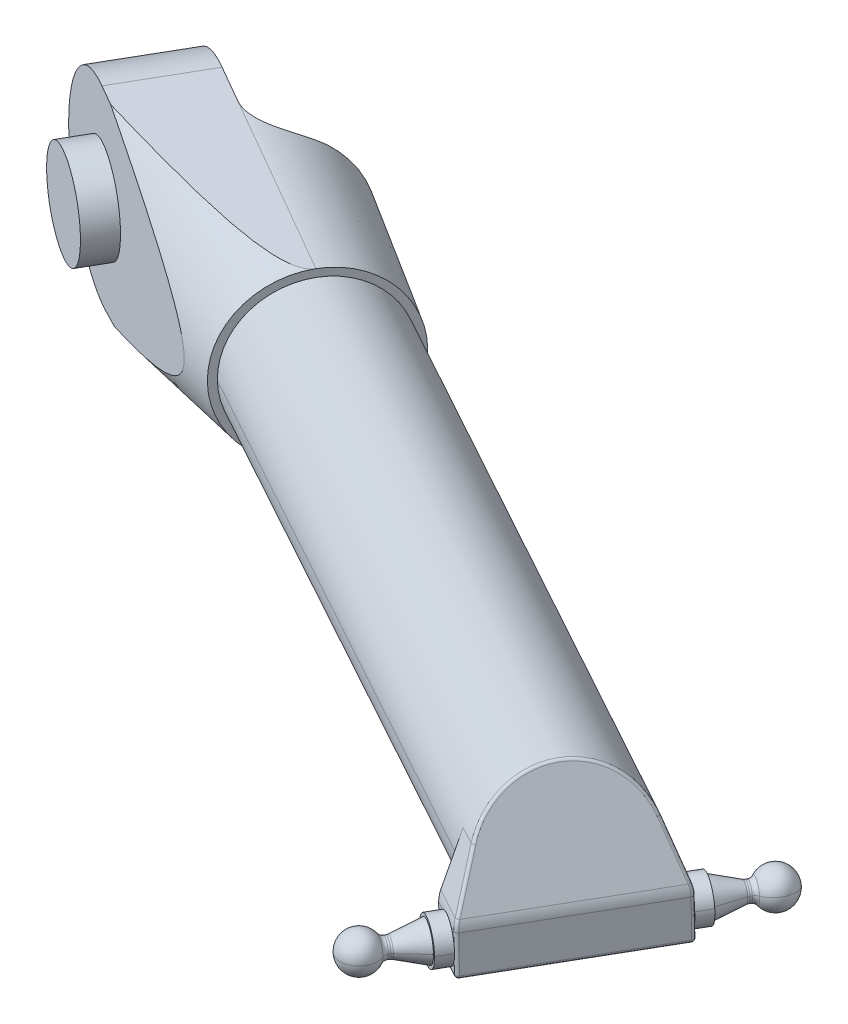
ISO-10303-21;
HEADER;
FILE_DESCRIPTION(('STEP AP214'),'2;1');
FILE_NAME('part.step','',(''),(''),'','','');
FILE_SCHEMA(('AUTOMOTIVE_DESIGN { 1 0 10303 214 1 1 1 1 }'));
ENDSEC;
DATA;
#1=APPLICATION_CONTEXT('core data for automotive mechanical design processes');
#2=APPLICATION_PROTOCOL_DEFINITION('international standard','automotive_design',2000,#1);
#3=PRODUCT_CONTEXT('',#1,'mechanical');
#4=PRODUCT('Part','Part','',(#3));
#5=PRODUCT_RELATED_PRODUCT_CATEGORY('part','',(#4));
#6=PRODUCT_DEFINITION_FORMATION('','',#4);
#7=PRODUCT_DEFINITION_CONTEXT('part definition',#1,'design');
#8=PRODUCT_DEFINITION('design','',#6,#7);
#9=PRODUCT_DEFINITION_SHAPE('','',#8);
#10=(LENGTH_UNIT() NAMED_UNIT(*) SI_UNIT(.MILLI.,.METRE.));
#11=(NAMED_UNIT(*) PLANE_ANGLE_UNIT() SI_UNIT($,.RADIAN.));
#12=(NAMED_UNIT(*) SI_UNIT($,.STERADIAN.) SOLID_ANGLE_UNIT());
#13=UNCERTAINTY_MEASURE_WITH_UNIT(LENGTH_MEASURE(1.E-05),#10,'distance_accuracy_value','');
#14=(GEOMETRIC_REPRESENTATION_CONTEXT(3) GLOBAL_UNCERTAINTY_ASSIGNED_CONTEXT((#13)) GLOBAL_UNIT_ASSIGNED_CONTEXT((#10,
#11,#12)) REPRESENTATION_CONTEXT('',''));
#15=CARTESIAN_POINT('',(0.,0.,0.));
#16=DIRECTION('',(0.,0.,1.));
#17=DIRECTION('',(1.,0.,0.));
#18=AXIS2_PLACEMENT_3D('',#15,#16,#17);
#19=CARTESIAN_POINT('',(465.336239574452,-90.0000000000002,234.017488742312));
#20=DIRECTION('',(-0.5,0.,0.866025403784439));
#21=DIRECTION('',(0.848637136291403,0.199382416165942,0.489960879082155));
#22=AXIS2_PLACEMENT_3D('',#19,#20,#21);
#23=CYLINDRICAL_SURFACE('',#22,7.);
#24=CARTESIAN_POINT('',(467.836239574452,-90.0000000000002,229.68736172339));
#25=DIRECTION('',(-0.5,0.,0.866025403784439));
#26=DIRECTION('',(0.848637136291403,0.199382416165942,0.489960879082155));
#27=AXIS2_PLACEMENT_3D('',#24,#25,#26);
#28=CIRCLE('',#27,7.);
#29=CARTESIAN_POINT('',(473.776699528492,-88.6043230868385,233.117087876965));
#30=VERTEX_POINT('',#29);
#31=CARTESIAN_POINT('',(461.895779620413,-91.395676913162,226.257635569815));
#32=VERTEX_POINT('',#31);
#33=EDGE_CURVE('E10',#30,#32,#28,.T.);
#34=ORIENTED_EDGE('',*,*,#33,.T.);
#35=DIRECTION('',(-0.5,0.,0.866025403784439));
#36=VECTOR('',#35,1.);
#37=CARTESIAN_POINT('',(459.395779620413,-91.395676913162,230.587762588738));
#38=LINE('',#37,#36);
#39=CARTESIAN_POINT('',(459.395779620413,-91.395676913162,230.587762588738));
#40=VERTEX_POINT('',#39);
#41=EDGE_CURVE('E28',#32,#40,#38,.T.);
#42=ORIENTED_EDGE('',*,*,#41,.T.);
#43=CARTESIAN_POINT('',(465.336239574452,-90.0000000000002,234.017488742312));
#44=DIRECTION('',(-0.5,0.,0.866025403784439));
#45=DIRECTION('',(0.848637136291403,0.199382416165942,0.489960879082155));
#46=AXIS2_PLACEMENT_3D('',#43,#44,#45);
#47=CIRCLE('',#46,7.);
#48=CARTESIAN_POINT('',(461.669174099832,-84.4259373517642,231.900307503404));
#49=VERTEX_POINT('',#48);
#50=EDGE_CURVE('E540',#49,#40,#47,.T.);
#51=ORIENTED_EDGE('',*,*,#50,.F.);
#52=CARTESIAN_POINT('',(465.336239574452,-90.0000000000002,234.017488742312));
#53=DIRECTION('',(-0.5,0.,0.866025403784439));
#54=DIRECTION('',(0.848637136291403,0.199382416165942,0.489960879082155));
#55=AXIS2_PLACEMENT_3D('',#52,#53,#54);
#56=CIRCLE('',#55,7.);
#57=CARTESIAN_POINT('',(468.454177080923,-83.9968379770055,235.81763080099));
#58=VERTEX_POINT('',#57);
#59=EDGE_CURVE('E737',#58,#49,#56,.T.);
#60=ORIENTED_EDGE('',*,*,#59,.F.);
#61=CARTESIAN_POINT('',(465.336239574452,-90.0000000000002,234.017488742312));
#62=DIRECTION('',(-0.5,0.,0.866025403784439));
#63=DIRECTION('',(0.848637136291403,0.199382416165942,0.489960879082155));
#64=AXIS2_PLACEMENT_3D('',#61,#62,#63);
#65=CIRCLE('',#64,7.);
#66=CARTESIAN_POINT('',(470.833933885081,-87.0503430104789,237.191584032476));
#67=VERTEX_POINT('',#66);
#68=EDGE_CURVE('E709',#67,#58,#65,.T.);
#69=ORIENTED_EDGE('',*,*,#68,.F.);
#70=CARTESIAN_POINT('',(465.336239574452,-90.0000000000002,234.017488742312));
#71=DIRECTION('',(-0.5,0.,0.866025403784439));
#72=DIRECTION('',(0.848637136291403,0.199382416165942,0.489960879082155));
#73=AXIS2_PLACEMENT_3D('',#70,#71,#72);
#74=CIRCLE('',#73,7.);
#75=CARTESIAN_POINT('',(471.276699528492,-88.6043230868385,237.447214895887));
#76=VERTEX_POINT('',#75);
#77=EDGE_CURVE('E484',#76,#67,#74,.T.);
#78=ORIENTED_EDGE('',*,*,#77,.F.);
#79=DIRECTION('',(-0.5,0.,0.866025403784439));
#80=VECTOR('',#79,1.);
#81=CARTESIAN_POINT('',(471.276699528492,-88.6043230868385,237.447214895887));
#82=LINE('',#81,#80);
#83=EDGE_CURVE('E574',#30,#76,#82,.T.);
#84=ORIENTED_EDGE('',*,*,#83,.F.);
#85=EDGE_LOOP('',(#34,#42,#51,#60,#69,#78,#84));
#86=FACE_BOUND('',#85,.T.);
#87=ADVANCED_FACE('F16',(#86),#23,.T.);
#88=CARTESIAN_POINT('',(472.44801493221,-90.0000000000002,221.699532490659));
#89=DIRECTION('',(-0.5,0.,0.866025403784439));
#90=DIRECTION('',(0.848637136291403,0.199382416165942,0.489960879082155));
#91=AXIS2_PLACEMENT_3D('',#88,#89,#90);
#92=CONICAL_SURFACE('',#91,3.09252464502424,0.305363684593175);
#93=CARTESIAN_POINT('',(472.44801493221,-90.0000000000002,221.699532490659));
#94=DIRECTION('',(-0.5,0.,0.866025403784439));
#95=DIRECTION('',(0.848637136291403,0.199382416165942,0.489960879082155));
#96=AXIS2_PLACEMENT_3D('',#93,#94,#95);
#97=CIRCLE('',#96,3.09252464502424);
#98=CARTESIAN_POINT('',(475.072446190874,-89.3834049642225,223.214748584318));
#99=VERTEX_POINT('',#98);
#100=CARTESIAN_POINT('',(469.823583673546,-90.6165950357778,220.184316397));
#101=VERTEX_POINT('',#100);
#102=EDGE_CURVE('E618',#99,#101,#97,.T.);
#103=ORIENTED_EDGE('',*,*,#102,.T.);
#104=DIRECTION('',(-0.732003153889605,-0.0599423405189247,0.678659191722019));
#105=VECTOR('',#104,1.);
#106=CARTESIAN_POINT('',(469.823583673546,-90.6165950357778,220.184316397));
#107=LINE('',#106,#105);
#108=CARTESIAN_POINT('',(462.744416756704,-91.1962944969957,226.747596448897));
#109=VERTEX_POINT('',#108);
#110=EDGE_CURVE('E623',#101,#109,#107,.T.);
#111=ORIENTED_EDGE('',*,*,#110,.T.);
#112=CARTESIAN_POINT('',(467.836239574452,-90.0000000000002,229.68736172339));
#113=DIRECTION('',(-0.5,0.,0.866025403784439));
#114=DIRECTION('',(0.848637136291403,0.199382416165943,0.489960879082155));
#115=AXIS2_PLACEMENT_3D('',#112,#113,#114);
#116=CIRCLE('',#115,6.);
#117=CARTESIAN_POINT('',(472.928062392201,-88.8037055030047,232.627126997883));
#118=VERTEX_POINT('',#117);
#119=EDGE_CURVE('E544',#118,#109,#116,.T.);
#120=ORIENTED_EDGE('',*,*,#119,.F.);
#121=DIRECTION('',(-0.22173452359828,0.0599423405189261,0.973262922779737));
#122=VECTOR('',#121,1.);
#123=CARTESIAN_POINT('',(475.072446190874,-89.3834049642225,223.214748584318));
#124=LINE('',#123,#122);
#125=EDGE_CURVE('E547',#99,#118,#124,.T.);
#126=ORIENTED_EDGE('',*,*,#125,.F.);
#127=EDGE_LOOP('',(#103,#111,#120,#126));
#128=FACE_BOUND('',#127,.T.);
#129=ADVANCED_FACE('F1516',(#128),#92,.T.);
#130=CARTESIAN_POINT('',(472.748654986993,-90.0000000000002,221.178808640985));
#131=DIRECTION('',(-0.5,0.,0.866025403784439));
#132=DIRECTION('',(0.848637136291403,0.199382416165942,0.489960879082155));
#133=AXIS2_PLACEMENT_3D('',#130,#131,#132);
#134=TOROIDAL_SURFACE('',#133,5.,2.);
#135=CARTESIAN_POINT('',(472.44801493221,-90.0000000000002,221.699532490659));
#136=DIRECTION('',(-0.5,0.,0.866025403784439));
#137=DIRECTION('',(0.848637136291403,0.199382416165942,0.489960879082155));
#138=AXIS2_PLACEMENT_3D('',#135,#136,#137);
#139=CIRCLE('',#138,3.09252464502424);
#140=EDGE_CURVE('E554',#101,#99,#139,.T.);
#141=ORIENTED_EDGE('',*,*,#140,.F.);
#142=CARTESIAN_POINT('',(468.505469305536,-90.9969120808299,218.729004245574));
#143=DIRECTION('',(-0.17267023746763,0.979921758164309,-0.0996912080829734));
#144=DIRECTION('',(-0.848637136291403,-0.199382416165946,-0.489960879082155));
#145=AXIS2_PLACEMENT_3D('',#142,#143,#144);
#146=CIRCLE('',#145,2.);
#147=CARTESIAN_POINT('',(470.202743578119,-90.5981472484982,219.708926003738));
#148=VERTEX_POINT('',#147);
#149=EDGE_CURVE('E627',#101,#148,#146,.T.);
#150=ORIENTED_EDGE('',*,*,#149,.T.);
#151=CARTESIAN_POINT('',(472.748654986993,-90.0000000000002,221.178808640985));
#152=DIRECTION('',(-0.5,0.,0.866025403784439));
#153=DIRECTION('',(0.848637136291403,0.199382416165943,0.489960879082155));
#154=AXIS2_PLACEMENT_3D('',#151,#152,#153);
#155=CIRCLE('',#154,3.);
#156=CARTESIAN_POINT('',(475.294566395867,-89.4018527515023,222.648691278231));
#157=VERTEX_POINT('',#156);
#158=EDGE_CURVE('E727',#148,#157,#155,.T.);
#159=ORIENTED_EDGE('',*,*,#158,.T.);
#160=CARTESIAN_POINT('',(476.99184066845,-89.0030879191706,223.628613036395));
#161=DIRECTION('',(0.17267023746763,-0.979921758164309,0.0996912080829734));
#162=DIRECTION('',(0.848637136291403,0.199382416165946,0.489960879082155));
#163=AXIS2_PLACEMENT_3D('',#160,#161,#162);
#164=CIRCLE('',#163,2.);
#165=EDGE_CURVE('E553',#99,#157,#164,.T.);
#166=ORIENTED_EDGE('',*,*,#165,.F.);
#167=EDGE_LOOP('',(#141,#150,#159,#166));
#168=FACE_BOUND('',#167,.T.);
#169=ADVANCED_FACE('F866',(#168),#134,.F.);
#170=CARTESIAN_POINT('',(465.336239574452,-90.0000000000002,234.017488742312));
#171=DIRECTION('',(-0.5,0.,0.866025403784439));
#172=DIRECTION('',(0.848637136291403,0.199382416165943,0.489960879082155));
#173=AXIS2_PLACEMENT_3D('',#170,#171,#172);
#174=CYLINDRICAL_SURFACE('',#173,3.);
#175=CARTESIAN_POINT('',(473.055138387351,-90.0000000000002,220.647963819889));
#176=DIRECTION('',(-0.5,0.,0.866025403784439));
#177=DIRECTION('',(0.848637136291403,0.199382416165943,0.489960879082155));
#178=AXIS2_PLACEMENT_3D('',#175,#176,#177);
#179=CIRCLE('',#178,3.);
#180=CARTESIAN_POINT('',(475.601049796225,-89.4018527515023,222.117846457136));
#181=VERTEX_POINT('',#180);
#182=CARTESIAN_POINT('',(470.509226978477,-90.5981472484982,219.178081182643));
#183=VERTEX_POINT('',#182);
#184=EDGE_CURVE('E587',#181,#183,#179,.T.);
#185=ORIENTED_EDGE('',*,*,#184,.T.);
#186=DIRECTION('',(-0.5,0.,0.866025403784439));
#187=VECTOR('',#186,1.);
#188=CARTESIAN_POINT('',(462.790328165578,-90.5981472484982,232.547606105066));
#189=LINE('',#188,#187);
#190=EDGE_CURVE('E584',#183,#148,#189,.T.);
#191=ORIENTED_EDGE('',*,*,#190,.T.);
#192=CARTESIAN_POINT('',(472.748654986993,-90.0000000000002,221.178808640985));
#193=DIRECTION('',(-0.5,0.,0.866025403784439));
#194=DIRECTION('',(0.848637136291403,0.199382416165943,0.489960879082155));
#195=AXIS2_PLACEMENT_3D('',#192,#193,#194);
#196=CIRCLE('',#195,3.);
#197=EDGE_CURVE('E549',#157,#148,#196,.T.);
#198=ORIENTED_EDGE('',*,*,#197,.F.);
#199=DIRECTION('',(-0.5,0.,0.866025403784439));
#200=VECTOR('',#199,1.);
#201=CARTESIAN_POINT('',(467.882150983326,-89.4018527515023,235.487371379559));
#202=LINE('',#201,#200);
#203=EDGE_CURVE('E2265',#181,#157,#202,.T.);
#204=ORIENTED_EDGE('',*,*,#203,.F.);
#205=EDGE_LOOP('',(#185,#191,#198,#204));
#206=FACE_BOUND('',#205,.T.);
#207=ADVANCED_FACE('F1116',(#206),#174,.T.);
#208=CARTESIAN_POINT('',(473.055138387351,-90.0000000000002,220.647963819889));
#209=DIRECTION('',(-0.5,0.,0.866025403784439));
#210=DIRECTION('',(0.848637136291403,0.199382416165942,0.489960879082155));
#211=AXIS2_PLACEMENT_3D('',#208,#209,#210);
#212=TOROIDAL_SURFACE('',#211,5.,2.);
#213=CARTESIAN_POINT('',(473.055138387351,-90.0000000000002,220.647963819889));
#214=DIRECTION('',(-0.5,0.,0.866025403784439));
#215=DIRECTION('',(0.848637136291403,0.199382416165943,0.489960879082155));
#216=AXIS2_PLACEMENT_3D('',#213,#214,#215);
#217=CIRCLE('',#216,3.);
#218=EDGE_CURVE('E2127',#183,#181,#217,.T.);
#219=ORIENTED_EDGE('',*,*,#218,.F.);
#220=CARTESIAN_POINT('',(468.811952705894,-90.9969120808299,218.198159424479));
#221=DIRECTION('',(-0.17267023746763,0.979921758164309,-0.0996912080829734));
#222=DIRECTION('',(-0.848637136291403,-0.199382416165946,-0.489960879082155));
#223=AXIS2_PLACEMENT_3D('',#220,#221,#222);
#224=CIRCLE('',#223,2.);
#225=CARTESIAN_POINT('',(470.636022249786,-90.7552364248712,217.414346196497));
#226=VERTEX_POINT('',#225);
#227=EDGE_CURVE('E497',#183,#226,#224,.T.);
#228=ORIENTED_EDGE('',*,*,#227,.T.);
#229=CARTESIAN_POINT('',(473.850556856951,-90.0000000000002,219.270258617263));
#230=DIRECTION('',(-0.5,0.,0.866025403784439));
#231=DIRECTION('',(0.848637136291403,0.199382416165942,0.489960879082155));
#232=AXIS2_PLACEMENT_3D('',#229,#230,#231);
#233=CIRCLE('',#232,3.78787878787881);
#234=CARTESIAN_POINT('',(477.065091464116,-89.2447635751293,221.126171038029));
#235=VERTEX_POINT('',#234);
#236=EDGE_CURVE('E493',#226,#235,#233,.T.);
#237=ORIENTED_EDGE('',*,*,#236,.T.);
#238=CARTESIAN_POINT('',(477.298324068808,-89.0030879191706,223.0977682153));
#239=DIRECTION('',(0.17267023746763,-0.979921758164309,0.0996912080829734));
#240=DIRECTION('',(0.848637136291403,0.199382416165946,0.489960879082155));
#241=AXIS2_PLACEMENT_3D('',#238,#239,#240);
#242=CIRCLE('',#241,2.);
#243=EDGE_CURVE('E2126',#181,#235,#242,.T.);
#244=ORIENTED_EDGE('',*,*,#243,.F.);
#245=EDGE_LOOP('',(#219,#228,#237,#244));
#246=FACE_BOUND('',#245,.T.);
#247=ADVANCED_FACE('F1217',(#246),#212,.F.);
#248=CARTESIAN_POINT('',(476.336239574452,-90.0000000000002,214.964929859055));
#249=DIRECTION('',(0.172670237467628,-0.97992175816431,0.0996912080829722));
#250=DIRECTION('',(-0.848637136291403,-0.199382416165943,-0.489960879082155));
#251=AXIS2_PLACEMENT_3D('',#248,#249,#250);
#252=SPHERICAL_SURFACE('',#251,6.25);
#253=CARTESIAN_POINT('',(476.336239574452,-90.0000000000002,214.964929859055));
#254=DIRECTION('',(-0.172670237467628,0.97992175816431,-0.0996912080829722));
#255=DIRECTION('',(-0.848637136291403,-0.199382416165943,-0.489960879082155));
#256=AXIS2_PLACEMENT_3D('',#253,#254,#255);
#257=CIRCLE('',#256,6.25);
#258=CARTESIAN_POINT('',(479.461239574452,-90.0000000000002,209.552271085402));
#259=VERTEX_POINT('',#258);
#260=EDGE_CURVE('E2259',#259,#226,#257,.T.);
#261=ORIENTED_EDGE('',*,*,#260,.F.);
#262=CARTESIAN_POINT('',(476.336239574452,-90.0000000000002,214.964929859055));
#263=DIRECTION('',(0.172670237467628,-0.97992175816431,0.0996912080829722));
#264=DIRECTION('',(0.848637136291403,0.199382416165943,0.489960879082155));
#265=AXIS2_PLACEMENT_3D('',#262,#263,#264);
#266=CIRCLE('',#265,6.25);
#267=EDGE_CURVE('E498',#259,#235,#266,.T.);
#268=ORIENTED_EDGE('',*,*,#267,.T.);
#269=ORIENTED_EDGE('',*,*,#236,.F.);
#270=EDGE_LOOP('',(#261,#268,#269));
#271=FACE_BOUND('',#270,.T.);
#272=ADVANCED_FACE('F1223',(#271),#252,.T.);
#273=CARTESIAN_POINT('',(435.336239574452,-90.0000000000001,285.979012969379));
#274=DIRECTION('',(0.5,0.,-0.866025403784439));
#275=DIRECTION('',(0.865915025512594,0.0159653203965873,0.499936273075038));
#276=AXIS2_PLACEMENT_3D('',#273,#274,#275);
#277=CYLINDRICAL_SURFACE('',#276,7.);
#278=CARTESIAN_POINT('',(432.836239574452,-90.0000000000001,290.309139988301));
#279=DIRECTION('',(0.5,0.,-0.866025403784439));
#280=DIRECTION('',(0.865915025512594,0.0159653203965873,0.499936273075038));
#281=AXIS2_PLACEMENT_3D('',#278,#279,#280);
#282=CIRCLE('',#281,7.);
#283=CARTESIAN_POINT('',(438.89764475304,-89.888242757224,293.808693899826));
#284=VERTEX_POINT('',#283);
#285=CARTESIAN_POINT('',(426.774834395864,-90.1117572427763,286.809586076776));
#286=VERTEX_POINT('',#285);
#287=EDGE_CURVE('E714',#284,#286,#282,.T.);
#288=ORIENTED_EDGE('',*,*,#287,.T.);
#289=DIRECTION('',(0.5,0.,-0.866025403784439));
#290=VECTOR('',#289,1.);
#291=CARTESIAN_POINT('',(429.274834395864,-90.1117572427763,282.479459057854));
#292=LINE('',#291,#290);
#293=CARTESIAN_POINT('',(429.274834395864,-90.1117572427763,282.479459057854));
#294=VERTEX_POINT('',#293);
#295=EDGE_CURVE('E710',#286,#294,#292,.T.);
#296=ORIENTED_EDGE('',*,*,#295,.T.);
#297=CARTESIAN_POINT('',(435.336239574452,-90.0000000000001,285.979012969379));
#298=DIRECTION('',(0.5,0.,-0.866025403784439));
#299=DIRECTION('',(0.865915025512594,0.0159653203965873,0.499936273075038));
#300=AXIS2_PLACEMENT_3D('',#297,#298,#299);
#301=CIRCLE('',#300,7.);
#302=CARTESIAN_POINT('',(433.397451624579,-96.6323551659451,284.859653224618));
#303=VERTEX_POINT('',#302);
#304=EDGE_CURVE('E642',#303,#294,#301,.T.);
#305=ORIENTED_EDGE('',*,*,#304,.F.);
#306=CARTESIAN_POINT('',(435.336239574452,-90.0000000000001,285.979012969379));
#307=DIRECTION('',(0.5,0.,-0.866025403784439));
#308=DIRECTION('',(0.865915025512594,0.0159653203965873,0.499936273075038));
#309=AXIS2_PLACEMENT_3D('',#306,#307,#308);
#310=CIRCLE('',#309,7.);
#311=CARTESIAN_POINT('',(437.890717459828,-96.3481905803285,287.453841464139));
#312=VERTEX_POINT('',#311);
#313=EDGE_CURVE('E630',#312,#303,#310,.T.);
#314=ORIENTED_EDGE('',*,*,#313,.F.);
#315=CARTESIAN_POINT('',(435.336239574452,-90.0000000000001,285.979012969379));
#316=DIRECTION('',(0.5,0.,-0.866025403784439));
#317=DIRECTION('',(0.865915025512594,0.0159653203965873,0.499936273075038));
#318=AXIS2_PLACEMENT_3D('',#315,#316,#317);
#319=CIRCLE('',#318,7.);
#320=CARTESIAN_POINT('',(441.080027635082,-92.2387194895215,289.295190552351));
#321=VERTEX_POINT('',#320);
#322=EDGE_CURVE('E509',#321,#312,#319,.T.);
#323=ORIENTED_EDGE('',*,*,#322,.F.);
#324=CARTESIAN_POINT('',(435.336239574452,-90.0000000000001,285.979012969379));
#325=DIRECTION('',(0.5,0.,-0.866025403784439));
#326=DIRECTION('',(0.865915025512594,0.0159653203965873,0.499936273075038));
#327=AXIS2_PLACEMENT_3D('',#324,#325,#326);
#328=CIRCLE('',#327,7.);
#329=CARTESIAN_POINT('',(441.39764475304,-89.888242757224,289.478566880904));
#330=VERTEX_POINT('',#329);
#331=EDGE_CURVE('E604',#330,#321,#328,.T.);
#332=ORIENTED_EDGE('',*,*,#331,.F.);
#333=DIRECTION('',(0.5,0.,-0.866025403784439));
#334=VECTOR('',#333,1.);
#335=CARTESIAN_POINT('',(441.39764475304,-89.888242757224,289.478566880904));
#336=LINE('',#335,#334);
#337=EDGE_CURVE('E473',#284,#330,#336,.T.);
#338=ORIENTED_EDGE('',*,*,#337,.F.);
#339=EDGE_LOOP('',(#288,#296,#305,#314,#323,#332,#338));
#340=FACE_BOUND('',#339,.T.);
#341=ADVANCED_FACE('F1655',(#340),#277,.T.);
#342=CARTESIAN_POINT('',(428.224464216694,-90.0000000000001,298.296969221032));
#343=DIRECTION('',(0.5,0.,-0.866025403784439));
#344=DIRECTION('',(0.865915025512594,0.0159653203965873,0.499936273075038));
#345=AXIS2_PLACEMENT_3D('',#342,#343,#344);
#346=CONICAL_SURFACE('',#345,3.09252464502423,0.305363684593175);
#347=CARTESIAN_POINT('',(428.224464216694,-90.0000000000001,298.296969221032));
#348=DIRECTION('',(0.5,0.,-0.866025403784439));
#349=DIRECTION('',(0.865915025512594,0.0159653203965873,0.499936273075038));
#350=AXIS2_PLACEMENT_3D('',#347,#348,#349);
#351=CIRCLE('',#350,3.09252464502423);
#352=CARTESIAN_POINT('',(430.902327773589,-89.950626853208,299.843034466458));
#353=VERTEX_POINT('',#352);
#354=CARTESIAN_POINT('',(425.5466006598,-90.0493731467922,296.750903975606));
#355=VERTEX_POINT('',#354);
#356=EDGE_CURVE('E715',#353,#355,#351,.T.);
#357=ORIENTED_EDGE('',*,*,#356,.T.);
#358=DIRECTION('',(0.216540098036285,-0.00479981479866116,-0.976261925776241));
#359=VECTOR('',#358,1.);
#360=CARTESIAN_POINT('',(425.5466006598,-90.0493731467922,296.750903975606));
#361=LINE('',#360,#359);
#362=CARTESIAN_POINT('',(427.640749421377,-90.0957919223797,287.309522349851));
#363=VERTEX_POINT('',#362);
#364=EDGE_CURVE('E451',#355,#363,#361,.T.);
#365=ORIENTED_EDGE('',*,*,#364,.T.);
#366=CARTESIAN_POINT('',(432.836239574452,-90.0000000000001,290.309139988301));
#367=DIRECTION('',(0.5,0.,-0.866025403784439));
#368=DIRECTION('',(0.865915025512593,0.0159653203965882,0.499936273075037));
#369=AXIS2_PLACEMENT_3D('',#366,#367,#368);
#370=CIRCLE('',#369,6.);
#371=CARTESIAN_POINT('',(438.031729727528,-89.9042080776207,293.308757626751));
#372=VERTEX_POINT('',#371);
#373=EDGE_CURVE('E444',#372,#363,#370,.T.);
#374=ORIENTED_EDGE('',*,*,#373,.F.);
#375=DIRECTION('',(0.7371975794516,0.00479981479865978,-0.675660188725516));
#376=VECTOR('',#375,1.);
#377=CARTESIAN_POINT('',(430.902327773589,-89.950626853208,299.843034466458));
#378=LINE('',#377,#376);
#379=EDGE_CURVE('E448',#353,#372,#378,.T.);
#380=ORIENTED_EDGE('',*,*,#379,.F.);
#381=EDGE_LOOP('',(#357,#365,#374,#380));
#382=FACE_BOUND('',#381,.T.);
#383=ADVANCED_FACE('F447',(#382),#346,.T.);
#384=CARTESIAN_POINT('',(427.923824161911,-90.0000000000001,298.817693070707));
#385=DIRECTION('',(0.5,0.,-0.866025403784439));
#386=DIRECTION('',(0.865915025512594,0.0159653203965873,0.499936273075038));
#387=AXIS2_PLACEMENT_3D('',#384,#385,#386);
#388=TOROIDAL_SURFACE('',#387,5.,2.);
#389=CARTESIAN_POINT('',(428.224464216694,-90.0000000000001,298.296969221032));
#390=DIRECTION('',(0.5,0.,-0.866025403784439));
#391=DIRECTION('',(0.865915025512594,0.0159653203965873,0.499936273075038));
#392=AXIS2_PLACEMENT_3D('',#389,#390,#391);
#393=CIRCLE('',#392,3.09252464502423);
#394=EDGE_CURVE('E460',#355,#353,#393,.T.);
#395=ORIENTED_EDGE('',*,*,#394,.F.);
#396=CARTESIAN_POINT('',(423.594249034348,-90.0798266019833,296.318011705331));
#397=DIRECTION('',(0.0138263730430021,-0.999872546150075,0.00798266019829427));
#398=DIRECTION('',(0.865915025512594,0.0159653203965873,0.499936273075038));
#399=AXIS2_PLACEMENT_3D('',#396,#397,#398);
#400=CIRCLE('',#399,2.);
#401=CARTESIAN_POINT('',(425.326079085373,-90.04789596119,297.317884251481));
#402=VERTEX_POINT('',#401);
#403=EDGE_CURVE('E721',#355,#402,#400,.T.);
#404=ORIENTED_EDGE('',*,*,#403,.T.);
#405=CARTESIAN_POINT('',(427.923824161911,-90.0000000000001,298.817693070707));
#406=DIRECTION('',(0.5,0.,-0.866025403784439));
#407=DIRECTION('',(0.865915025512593,0.0159653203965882,0.499936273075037));
#408=AXIS2_PLACEMENT_3D('',#405,#406,#407);
#409=CIRCLE('',#408,3.);
#410=CARTESIAN_POINT('',(430.521569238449,-89.9521040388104,300.317501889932));
#411=VERTEX_POINT('',#410);
#412=EDGE_CURVE('E695',#402,#411,#409,.T.);
#413=ORIENTED_EDGE('',*,*,#412,.T.);
#414=CARTESIAN_POINT('',(432.253399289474,-89.9201733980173,301.317374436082));
#415=DIRECTION('',(-0.0138263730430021,0.999872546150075,-0.00798266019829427));
#416=DIRECTION('',(-0.865915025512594,-0.0159653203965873,-0.499936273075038));
#417=AXIS2_PLACEMENT_3D('',#414,#415,#416);
#418=CIRCLE('',#417,2.);
#419=EDGE_CURVE('E700',#353,#411,#418,.T.);
#420=ORIENTED_EDGE('',*,*,#419,.F.);
#421=EDGE_LOOP('',(#395,#404,#413,#420));
#422=FACE_BOUND('',#421,.T.);
#423=ADVANCED_FACE('F1485',(#422),#388,.F.);
#424=CARTESIAN_POINT('',(435.336239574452,-90.0000000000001,285.979012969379));
#425=DIRECTION('',(0.5,0.,-0.866025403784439));
#426=DIRECTION('',(0.865915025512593,0.0159653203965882,0.499936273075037));
#427=AXIS2_PLACEMENT_3D('',#424,#425,#426);
#428=CYLINDRICAL_SURFACE('',#427,3.);
#429=CARTESIAN_POINT('',(427.617340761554,-90.0000000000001,299.348537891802));
#430=DIRECTION('',(0.5,0.,-0.866025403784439));
#431=DIRECTION('',(0.865915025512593,0.0159653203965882,0.499936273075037));
#432=AXIS2_PLACEMENT_3D('',#429,#430,#431);
#433=CIRCLE('',#432,3.);
#434=CARTESIAN_POINT('',(430.215085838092,-89.9521040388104,300.848346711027));
#435=VERTEX_POINT('',#434);
#436=CARTESIAN_POINT('',(425.019595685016,-90.04789596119,297.848729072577));
#437=VERTEX_POINT('',#436);
#438=EDGE_CURVE('E691',#435,#437,#433,.T.);
#439=ORIENTED_EDGE('',*,*,#438,.T.);
#440=DIRECTION('',(0.5,0.,-0.866025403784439));
#441=VECTOR('',#440,1.);
#442=CARTESIAN_POINT('',(432.738494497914,-90.04789596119,284.479204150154));
#443=LINE('',#442,#441);
#444=EDGE_CURVE('E696',#437,#402,#443,.T.);
#445=ORIENTED_EDGE('',*,*,#444,.T.);
#446=CARTESIAN_POINT('',(427.923824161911,-90.0000000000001,298.817693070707));
#447=DIRECTION('',(0.5,0.,-0.866025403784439));
#448=DIRECTION('',(0.865915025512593,0.0159653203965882,0.499936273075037));
#449=AXIS2_PLACEMENT_3D('',#446,#447,#448);
#450=CIRCLE('',#449,3.);
#451=EDGE_CURVE('E704',#411,#402,#450,.T.);
#452=ORIENTED_EDGE('',*,*,#451,.F.);
#453=DIRECTION('',(0.5,0.,-0.866025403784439));
#454=VECTOR('',#453,1.);
#455=CARTESIAN_POINT('',(437.93398465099,-89.9521040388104,287.478821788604));
#456=LINE('',#455,#454);
#457=EDGE_CURVE('E653',#435,#411,#456,.T.);
#458=ORIENTED_EDGE('',*,*,#457,.F.);
#459=EDGE_LOOP('',(#439,#445,#452,#458));
#460=FACE_BOUND('',#459,.T.);
#461=ADVANCED_FACE('F1335',(#460),#428,.T.);
#462=CARTESIAN_POINT('',(427.617340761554,-90.0000000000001,299.348537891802));
#463=DIRECTION('',(0.5,0.,-0.866025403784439));
#464=DIRECTION('',(0.865915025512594,0.0159653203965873,0.499936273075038));
#465=AXIS2_PLACEMENT_3D('',#462,#463,#464);
#466=TOROIDAL_SURFACE('',#465,5.,2.);
#467=CARTESIAN_POINT('',(427.617340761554,-90.0000000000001,299.348537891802));
#468=DIRECTION('',(0.5,0.,-0.866025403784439));
#469=DIRECTION('',(0.865915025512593,0.0159653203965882,0.499936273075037));
#470=AXIS2_PLACEMENT_3D('',#467,#468,#469);
#471=CIRCLE('',#470,3.);
#472=EDGE_CURVE('E648',#437,#435,#471,.T.);
#473=ORIENTED_EDGE('',*,*,#472,.F.);
#474=CARTESIAN_POINT('',(423.287765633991,-90.0798266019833,296.848856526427));
#475=DIRECTION('',(0.0138263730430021,-0.999872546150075,0.00798266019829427));
#476=DIRECTION('',(0.865915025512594,0.0159653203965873,0.499936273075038));
#477=AXIS2_PLACEMENT_3D('',#474,#475,#476);
#478=CIRCLE('',#477,2.);
#479=CARTESIAN_POINT('',(423.541941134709,-90.060474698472,298.832545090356));
#480=VERTEX_POINT('',#479);
#481=EDGE_CURVE('E609',#437,#480,#478,.T.);
#482=ORIENTED_EDGE('',*,*,#481,.T.);
#483=CARTESIAN_POINT('',(426.821922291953,-90.0000000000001,300.726243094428));
#484=DIRECTION('',(0.5,0.,-0.866025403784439));
#485=DIRECTION('',(0.865915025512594,0.0159653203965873,0.499936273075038));
#486=AXIS2_PLACEMENT_3D('',#483,#484,#485);
#487=CIRCLE('',#486,3.78787878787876);
#488=CARTESIAN_POINT('',(430.101903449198,-89.9395253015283,302.619941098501));
#489=VERTEX_POINT('',#488);
#490=EDGE_CURVE('E605',#480,#489,#487,.T.);
#491=ORIENTED_EDGE('',*,*,#490,.T.);
#492=CARTESIAN_POINT('',(431.946915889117,-89.9201733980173,301.848219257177));
#493=DIRECTION('',(-0.0138263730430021,0.999872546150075,-0.00798266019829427));
#494=DIRECTION('',(-0.865915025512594,-0.0159653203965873,-0.499936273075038));
#495=AXIS2_PLACEMENT_3D('',#492,#493,#494);
#496=CIRCLE('',#495,2.);
#497=EDGE_CURVE('E477',#435,#489,#496,.T.);
#498=ORIENTED_EDGE('',*,*,#497,.F.);
#499=EDGE_LOOP('',(#473,#482,#491,#498));
#500=FACE_BOUND('',#499,.T.);
#501=ADVANCED_FACE('F1267',(#500),#466,.F.);
#502=CARTESIAN_POINT('',(424.336239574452,-90.0000000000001,305.031571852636));
#503=DIRECTION('',(-0.0138263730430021,0.999872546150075,-0.00798266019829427));
#504=DIRECTION('',(-0.865915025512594,-0.0159653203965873,-0.499936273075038));
#505=AXIS2_PLACEMENT_3D('',#502,#503,#504);
#506=SPHERICAL_SURFACE('',#505,6.25);
#507=CARTESIAN_POINT('',(424.336239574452,-90.0000000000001,305.031571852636));
#508=DIRECTION('',(0.0138263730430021,-0.999872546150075,0.00798266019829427));
#509=DIRECTION('',(0.865915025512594,0.0159653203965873,0.499936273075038));
#510=AXIS2_PLACEMENT_3D('',#507,#508,#509);
#511=CIRCLE('',#510,6.25);
#512=CARTESIAN_POINT('',(421.211239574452,-90.0000000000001,310.444230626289));
#513=VERTEX_POINT('',#512);
#514=EDGE_CURVE('E489',#513,#480,#511,.T.);
#515=ORIENTED_EDGE('',*,*,#514,.F.);
#516=CARTESIAN_POINT('',(424.336239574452,-90.0000000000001,305.031571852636));
#517=DIRECTION('',(-0.0138263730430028,0.999872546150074,-0.00798266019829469));
#518=DIRECTION('',(-0.865915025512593,-0.0159653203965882,-0.499936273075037));
#519=AXIS2_PLACEMENT_3D('',#516,#517,#518);
#520=CIRCLE('',#519,6.25);
#521=EDGE_CURVE('E521',#513,#489,#520,.T.);
#522=ORIENTED_EDGE('',*,*,#521,.T.);
#523=ORIENTED_EDGE('',*,*,#490,.F.);
#524=EDGE_LOOP('',(#515,#522,#523));
#525=FACE_BOUND('',#524,.T.);
#526=ADVANCED_FACE('F1262',(#525),#506,.T.);
#527=CARTESIAN_POINT('',(156.208110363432,-90.000000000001,129.443114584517));
#528=DIRECTION('',(0.5,0.,-0.866025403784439));
#529=DIRECTION('',(-0.0473607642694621,0.998503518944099,-0.0273437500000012));
#530=AXIS2_PLACEMENT_3D('',#527,#528,#529);
#531=CYLINDRICAL_SURFACE('',#530,15.75);
#532=CARTESIAN_POINT('',(158.208110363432,-90.000000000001,125.979012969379));
#533=DIRECTION('',(-0.5,0.,0.866025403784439));
#534=DIRECTION('',(-0.0473607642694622,0.998503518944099,-0.027343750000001));
#535=AXIS2_PLACEMENT_3D('',#532,#533,#534);
#536=CIRCLE('',#535,15.75);
#537=CARTESIAN_POINT('',(157.462178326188,-74.2735695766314,125.548348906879));
#538=VERTEX_POINT('',#537);
#539=EDGE_CURVE('E517',#538,#538,#536,.T.);
#540=CARTESIAN_POINT('',(153.208110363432,-90.000000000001,134.639267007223));
#541=DIRECTION('',(-0.5,0.,0.866025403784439));
#542=DIRECTION('',(0.30101452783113,0.937649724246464,0.17379081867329));
#543=AXIS2_PLACEMENT_3D('',#540,#541,#542);
#544=CIRCLE('',#543,15.75);
#545=CARTESIAN_POINT('',(152.462178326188,-74.2735695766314,134.208602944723));
#546=VERTEX_POINT('',#545);
#547=EDGE_CURVE('E2090',#546,#546,#544,.T.);
#548=CARTESIAN_POINT('',(157.462178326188,-74.2735695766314,125.548348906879));
#549=CARTESIAN_POINT('',(157.410094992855,-74.2735695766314,125.63855988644));
#550=CARTESIAN_POINT('',(157.358011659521,-74.2735695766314,125.728770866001));
#551=CARTESIAN_POINT('',(157.253844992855,-74.2735695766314,125.909192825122));
#552=CARTESIAN_POINT('',(157.201761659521,-74.2735695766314,125.999403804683));
#553=CARTESIAN_POINT('',(157.097594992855,-74.2735695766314,126.179825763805));
#554=CARTESIAN_POINT('',(157.045511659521,-74.2735695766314,126.270036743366));
#555=CARTESIAN_POINT('',(156.941344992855,-74.2735695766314,126.450458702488));
#556=CARTESIAN_POINT('',(156.889261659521,-74.2735695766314,126.540669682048));
#557=CARTESIAN_POINT('',(156.785094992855,-74.2735695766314,126.72109164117));
#558=CARTESIAN_POINT('',(156.733011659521,-74.2735695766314,126.811302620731));
#559=CARTESIAN_POINT('',(156.628844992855,-74.2735695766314,126.991724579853));
#560=CARTESIAN_POINT('',(156.576761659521,-74.2735695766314,127.081935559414));
#561=CARTESIAN_POINT('',(156.472594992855,-74.2735695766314,127.262357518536));
#562=CARTESIAN_POINT('',(156.420511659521,-74.2735695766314,127.352568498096));
#563=CARTESIAN_POINT('',(156.316344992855,-74.2735695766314,127.532990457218));
#564=CARTESIAN_POINT('',(156.264261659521,-74.2735695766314,127.623201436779));
#565=CARTESIAN_POINT('',(156.160094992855,-74.2735695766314,127.803623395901));
#566=CARTESIAN_POINT('',(156.108011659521,-74.2735695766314,127.893834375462));
#567=CARTESIAN_POINT('',(156.003844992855,-74.2735695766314,128.074256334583));
#568=CARTESIAN_POINT('',(155.951761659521,-74.2735695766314,128.164467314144));
#569=CARTESIAN_POINT('',(155.847594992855,-74.2735695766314,128.344889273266));
#570=CARTESIAN_POINT('',(155.795511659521,-74.2735695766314,128.435100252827));
#571=CARTESIAN_POINT('',(155.691344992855,-74.2735695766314,128.615522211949));
#572=CARTESIAN_POINT('',(155.639261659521,-74.2735695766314,128.70573319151));
#573=CARTESIAN_POINT('',(155.535094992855,-74.2735695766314,128.886155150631));
#574=CARTESIAN_POINT('',(155.483011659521,-74.2735695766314,128.976366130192));
#575=CARTESIAN_POINT('',(155.378844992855,-74.2735695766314,129.156788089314));
#576=CARTESIAN_POINT('',(155.326761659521,-74.2735695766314,129.246999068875));
#577=CARTESIAN_POINT('',(155.222594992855,-74.2735695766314,129.427421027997));
#578=CARTESIAN_POINT('',(155.170511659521,-74.2735695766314,129.517632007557));
#579=CARTESIAN_POINT('',(155.066344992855,-74.2735695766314,129.698053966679));
#580=CARTESIAN_POINT('',(155.014261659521,-74.2735695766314,129.78826494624));
#581=CARTESIAN_POINT('',(154.910094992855,-74.2735695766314,129.968686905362));
#582=CARTESIAN_POINT('',(154.858011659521,-74.2735695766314,130.058897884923));
#583=CARTESIAN_POINT('',(154.753844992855,-74.2735695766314,130.239319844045));
#584=CARTESIAN_POINT('',(154.701761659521,-74.2735695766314,130.329530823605));
#585=CARTESIAN_POINT('',(154.597594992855,-74.2735695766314,130.509952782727));
#586=CARTESIAN_POINT('',(154.545511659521,-74.2735695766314,130.600163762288));
#587=CARTESIAN_POINT('',(154.441344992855,-74.2735695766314,130.78058572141));
#588=CARTESIAN_POINT('',(154.389261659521,-74.2735695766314,130.870796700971));
#589=CARTESIAN_POINT('',(154.285094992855,-74.2735695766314,131.051218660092));
#590=CARTESIAN_POINT('',(154.233011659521,-74.2735695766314,131.141429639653));
#591=CARTESIAN_POINT('',(154.128844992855,-74.2735695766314,131.321851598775));
#592=CARTESIAN_POINT('',(154.076761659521,-74.2735695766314,131.412062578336));
#593=CARTESIAN_POINT('',(153.972594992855,-74.2735695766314,131.592484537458));
#594=CARTESIAN_POINT('',(153.920511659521,-74.2735695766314,131.682695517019));
#595=CARTESIAN_POINT('',(153.816344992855,-74.2735695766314,131.86311747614));
#596=CARTESIAN_POINT('',(153.764261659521,-74.2735695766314,131.953328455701));
#597=CARTESIAN_POINT('',(153.660094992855,-74.2735695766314,132.133750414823));
#598=CARTESIAN_POINT('',(153.608011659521,-74.2735695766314,132.223961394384));
#599=CARTESIAN_POINT('',(153.503844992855,-74.2735695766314,132.404383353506));
#600=CARTESIAN_POINT('',(153.451761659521,-74.2735695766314,132.494594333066));
#601=CARTESIAN_POINT('',(153.347594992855,-74.2735695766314,132.675016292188));
#602=CARTESIAN_POINT('',(153.295511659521,-74.2735695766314,132.765227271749));
#603=CARTESIAN_POINT('',(153.191344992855,-74.2735695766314,132.945649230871));
#604=CARTESIAN_POINT('',(153.139261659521,-74.2735695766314,133.035860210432));
#605=CARTESIAN_POINT('',(153.035094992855,-74.2735695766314,133.216282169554));
#606=CARTESIAN_POINT('',(152.983011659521,-74.2735695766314,133.306493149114));
#607=CARTESIAN_POINT('',(152.878844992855,-74.2735695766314,133.486915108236));
#608=CARTESIAN_POINT('',(152.826761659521,-74.2735695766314,133.577126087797));
#609=CARTESIAN_POINT('',(152.722594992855,-74.2735695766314,133.757548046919));
#610=CARTESIAN_POINT('',(152.670511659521,-74.2735695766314,133.84775902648));
#611=CARTESIAN_POINT('',(152.566344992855,-74.2735695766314,134.028180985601));
#612=CARTESIAN_POINT('',(152.514261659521,-74.2735695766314,134.118391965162));
#613=CARTESIAN_POINT('',(152.462178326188,-74.2735695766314,134.208602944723));
#614=B_SPLINE_CURVE_WITH_KNOTS('',3,(#548,#549,#550,#551,#552,#553,#554,#555,#556,#557,#558,
#559,#560,#561,#562,#563,#564,#565,#566,#567,#568,#569,#570,#571,#572,#573,#574,#575,#576,#577,
#578,#579,#580,#581,#582,#583,#584,#585,#586,#587,#588,#589,#590,#591,#592,#593,#594,#595,#596,
#597,#598,#599,#600,#601,#602,#603,#604,#605,#606,#607,#608,#609,#610,#611,#612,#613),
.UNSPECIFIED.,.F.,.F.,(4,2,2,2,2,2,2,2,2,2,2,2,2,2,2,2,2,2,2,2,2,2,2,2,2,2,2,2,2,2,2,2,4),(0.,
0.312500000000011,0.624999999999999,0.93750000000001,1.25,1.56250000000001,1.875,
2.18750000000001,2.5,2.8125,3.12500000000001,3.4375,3.75000000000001,4.06249999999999,
4.37500000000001,4.68749999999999,4.99999999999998,5.31249999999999,5.62499999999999,5.9375,
6.24999999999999,6.5625,6.87499999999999,7.1875,7.49999999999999,7.81249999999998,
8.12499999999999,8.43749999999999,8.75,9.06249999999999,9.375,9.68749999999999,
9.99999999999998),.UNSPECIFIED.);
#615=EDGE_CURVE('BSEAM1052',#538,#546,#614,.T.);
#616=ORIENTED_EDGE('',*,*,#539,.T.);
#617=ORIENTED_EDGE('',*,*,#547,.F.);
#618=ORIENTED_EDGE('',*,*,#615,.T.);
#619=ORIENTED_EDGE('',*,*,#615,.F.);
#620=EDGE_LOOP('',(#616,#618,#617,#619));
#621=FACE_BOUND('',#620,.T.);
#622=ADVANCED_FACE('F1052',(#621),#531,.T.);
#623=CARTESIAN_POINT('',(189.458110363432,-90.000000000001,71.8524252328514));
#624=DIRECTION('',(-0.5,0.,0.866025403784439));
#625=DIRECTION('',(-0.864729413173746,-0.0546875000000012,-0.49925175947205));
#626=AXIS2_PLACEMENT_3D('',#623,#624,#625);
#627=CYLINDRICAL_SURFACE('',#626,32.5);
#628=CARTESIAN_POINT('',(173.208110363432,-90.000000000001,99.9982508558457));
#629=DIRECTION('',(0.5,0.,-0.866025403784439));
#630=DIRECTION('',(-0.864729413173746,-0.0546875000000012,-0.49925175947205));
#631=AXIS2_PLACEMENT_3D('',#628,#629,#630);
#632=CIRCLE('',#631,32.5);
#633=CARTESIAN_POINT('',(145.104404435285,-91.7773437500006,83.772568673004));
#634=VERTEX_POINT('',#633);
#635=CARTESIAN_POINT('',(156.91146154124,-63.5020318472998,90.5893762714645));
#636=VERTEX_POINT('',#635);
#637=EDGE_CURVE('E2255',#634,#636,#632,.T.);
#638=ORIENTED_EDGE('',*,*,#637,.F.);
#639=DIRECTION('',(-0.5,0.,0.866025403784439));
#640=VECTOR('',#639,1.);
#641=CARTESIAN_POINT('',(161.354404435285,-91.7773437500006,55.6267430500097));
#642=LINE('',#641,#640);
#643=CARTESIAN_POINT('',(130.104404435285,-91.7773437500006,109.753330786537));
#644=VERTEX_POINT('',#643);
#645=EDGE_CURVE('E522',#634,#644,#642,.T.);
#646=ORIENTED_EDGE('',*,*,#645,.T.);
#647=CARTESIAN_POINT('',(158.208110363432,-90.000000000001,125.979012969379));
#648=DIRECTION('',(0.5,0.,-0.866025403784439));
#649=DIRECTION('',(-0.864729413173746,-0.0546875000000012,-0.49925175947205));
#650=AXIS2_PLACEMENT_3D('',#647,#648,#649);
#651=CIRCLE('',#650,32.5);
#652=CARTESIAN_POINT('',(141.91146154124,-63.5020318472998,116.570138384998));
#653=VERTEX_POINT('',#652);
#654=EDGE_CURVE('E583',#644,#653,#651,.T.);
#655=ORIENTED_EDGE('',*,*,#654,.T.);
#656=DIRECTION('',(0.5,0.,-0.866025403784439));
#657=VECTOR('',#656,1.);
#658=CARTESIAN_POINT('',(173.16146154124,-63.5020318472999,62.4435506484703));
#659=LINE('',#658,#657);
#660=EDGE_CURVE('E588',#653,#636,#659,.T.);
#661=ORIENTED_EDGE('',*,*,#660,.T.);
#662=EDGE_LOOP('',(#638,#646,#655,#661));
#663=FACE_BOUND('',#662,.T.);
#664=ADVANCED_FACE('F1277',(#663),#627,.T.);
#665=CARTESIAN_POINT('',(432509.810991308,27251.9726562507,249709.652304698));
#666=DIRECTION('',(-0.864729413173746,-0.0546875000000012,-0.49925175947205));
#667=DIRECTION('',(0.5,0.,-0.866025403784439));
#668=AXIS2_PLACEMENT_3D('',#665,#666,#667);
#669=CYLINDRICAL_SURFACE('',#668,25.);
#670=CARTESIAN_POINT('',(443.021955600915,-72.9363446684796,255.775347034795));
#671=DIRECTION('',(0.864729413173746,0.0546875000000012,0.49925175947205));
#672=DIRECTION('',(-0.5,0.,0.866025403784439));
#673=AXIS2_PLACEMENT_3D('',#670,#671,#672);
#674=CIRCLE('',#673,25.);
#675=CARTESIAN_POINT('',(430.521955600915,-72.9363446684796,277.425982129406));
#676=VERTEX_POINT('',#675);
#677=CARTESIAN_POINT('',(444.205974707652,-97.898932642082,256.458940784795));
#678=VERTEX_POINT('',#677);
#679=EDGE_CURVE('E638',#676,#678,#674,.T.);
#680=ORIENTED_EDGE('',*,*,#679,.F.);
#681=DIRECTION('',(-0.864729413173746,-0.0546875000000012,-0.49925175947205));
#682=VECTOR('',#681,1.);
#683=CARTESIAN_POINT('',(432497.310991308,27251.9726562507,249731.302939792));
#684=LINE('',#683,#682);
#685=CARTESIAN_POINT('',(236.371934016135,-85.2148437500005,165.333414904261));
#686=VERTEX_POINT('',#685);
#687=EDGE_CURVE('E592',#676,#686,#684,.T.);
#688=ORIENTED_EDGE('',*,*,#687,.T.);
#689=CARTESIAN_POINT('',(248.871934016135,-85.2148437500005,143.68277980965));
#690=DIRECTION('',(0.864729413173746,0.0546875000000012,0.49925175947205));
#691=DIRECTION('',(-0.5,0.,0.866025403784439));
#692=AXIS2_PLACEMENT_3D('',#689,#690,#691);
#693=CIRCLE('',#692,25.);
#694=CARTESIAN_POINT('',(261.371934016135,-85.2148437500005,122.032144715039));
#695=VERTEX_POINT('',#694);
#696=EDGE_CURVE('E634',#686,#695,#693,.T.);
#697=ORIENTED_EDGE('',*,*,#696,.T.);
#698=DIRECTION('',(-0.864729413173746,-0.0546875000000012,-0.49925175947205));
#699=VECTOR('',#698,1.);
#700=CARTESIAN_POINT('',(432522.310991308,27251.9726562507,249688.001669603));
#701=LINE('',#700,#699);
#702=CARTESIAN_POINT('',(455.521955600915,-72.9363446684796,234.124711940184));
#703=VERTEX_POINT('',#702);
#704=EDGE_CURVE('E748',#703,#695,#701,.T.);
#705=ORIENTED_EDGE('',*,*,#704,.F.);
#706=CARTESIAN_POINT('',(443.021955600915,-72.9363446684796,255.775347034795));
#707=DIRECTION('',(0.864729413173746,0.0546875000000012,0.49925175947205));
#708=DIRECTION('',(-0.5,0.,0.866025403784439));
#709=AXIS2_PLACEMENT_3D('',#706,#707,#708);
#710=CIRCLE('',#709,25.);
#711=EDGE_CURVE('E2113',#678,#703,#710,.T.);
#712=ORIENTED_EDGE('',*,*,#711,.F.);
#713=EDGE_LOOP('',(#680,#688,#697,#705,#712));
#714=FACE_BOUND('',#713,.T.);
#715=ADVANCED_FACE('F791',(#714),#669,.T.);
#716=CARTESIAN_POINT('',(432509.810991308,27251.9726562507,249709.652304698));
#717=DIRECTION('',(-0.864729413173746,-0.0546875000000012,-0.49925175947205));
#718=DIRECTION('',(0.5,0.,-0.866025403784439));
#719=AXIS2_PLACEMENT_3D('',#716,#717,#718);
#720=CYLINDRICAL_SURFACE('',#719,25.);
#721=ORIENTED_EDGE('',*,*,#687,.F.);
#722=CARTESIAN_POINT('',(443.021955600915,-72.9363446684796,255.775347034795));
#723=DIRECTION('',(0.864729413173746,0.0546875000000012,0.49925175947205));
#724=DIRECTION('',(-0.5,0.,0.866025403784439));
#725=AXIS2_PLACEMENT_3D('',#722,#723,#724);
#726=CIRCLE('',#725,25.);
#727=CARTESIAN_POINT('',(430.834492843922,-64.67503853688,275.979717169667));
#728=VERTEX_POINT('',#727);
#729=EDGE_CURVE('E644',#728,#676,#726,.T.);
#730=ORIENTED_EDGE('',*,*,#729,.F.);
#731=DIRECTION('',(0.864729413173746,0.0546875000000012,0.49925175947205));
#732=VECTOR('',#731,1.);
#733=CARTESIAN_POINT('',(430.834492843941,-64.6750385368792,275.979717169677));
#734=LINE('',#733,#732);
#735=CARTESIAN_POINT('',(437.237986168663,-64.2700667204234,279.67677576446));
#736=VERTEX_POINT('',#735);
#737=EDGE_CURVE('E2347',#728,#736,#734,.T.);
#738=ORIENTED_EDGE('',*,*,#737,.T.);
#739=CARTESIAN_POINT('',(460.829215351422,-64.2700667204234,238.815568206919));
#740=CARTESIAN_POINT('',(459.556338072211,-61.8948726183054,239.062779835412));
#741=CARTESIAN_POINT('',(458.141641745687,-59.6498706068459,239.662924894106));
#742=CARTESIAN_POINT('',(455.160613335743,-55.6295501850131,241.512937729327));
#743=CARTESIAN_POINT('',(453.59483587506,-53.8550353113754,242.762507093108));
#744=CARTESIAN_POINT('',(450.459555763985,-50.9436679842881,245.793616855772));
#745=CARTESIAN_POINT('',(448.890523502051,-49.8072523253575,247.57470249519));
#746=CARTESIAN_POINT('',(445.896781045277,-48.2795030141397,251.500947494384));
#747=CARTESIAN_POINT('',(444.472520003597,-47.8883985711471,253.645517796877));
#748=CARTESIAN_POINT('',(441.902751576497,-47.8883985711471,258.096487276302));
#749=CARTESIAN_POINT('',(440.757629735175,-48.2795030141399,260.402218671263));
#750=CARTESIAN_POINT('',(438.85427305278,-49.8072523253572,264.957998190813));
#751=CARTESIAN_POINT('',(438.096323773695,-50.9436679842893,267.207362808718));
#752=CARTESIAN_POINT('',(437.038945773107,-53.8550353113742,271.438149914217));
#753=CARTESIAN_POINT('',(436.739675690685,-55.6295501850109,273.418937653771));
#754=CARTESIAN_POINT('',(436.628031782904,-59.6498706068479,276.925590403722));
#755=CARTESIAN_POINT('',(436.815639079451,-61.8948726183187,278.450825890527));
#756=CARTESIAN_POINT('',(437.237986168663,-64.2700667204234,279.67677576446));
#757=(BOUNDED_CURVE() B_SPLINE_CURVE(3,(#739,#740,#741,#742,#743,#744,#745,#746,#747,#748,#749,
#750,#751,#752,#753,#754,#755,#756),.UNSPECIFIED.,.F.,.F.) B_SPLINE_CURVE_WITH_KNOTS((4,2,2,2,2,
2,2,2,4),(1.90810380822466,2.21647601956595,2.52484823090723,2.83322044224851,3.14159265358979,
3.44996486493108,3.75833707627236,4.06670928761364,4.37508149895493),
.UNSPECIFIED.) CURVE() GEOMETRIC_REPRESENTATION_ITEM() RATIONAL_B_SPLINE_CURVE((1.,1.,1.,1.,1.,
1.,1.,1.,1.,1.,1.,1.,1.,1.,1.,1.,1.,1.)) REPRESENTATION_ITEM(''));
#758=CARTESIAN_POINT('',(460.829215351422,-64.2700667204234,238.815568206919));
#759=VERTEX_POINT('',#758);
#760=EDGE_CURVE('E751',#736,#759,#757,.F.);
#761=ORIENTED_EDGE('',*,*,#760,.T.);
#762=DIRECTION('',(0.864729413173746,0.0546875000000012,0.49925175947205));
#763=VECTOR('',#762,1.);
#764=CARTESIAN_POINT('',(454.4257220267,-64.6750385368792,235.118509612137));
#765=LINE('',#764,#763);
#766=CARTESIAN_POINT('',(454.425722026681,-64.6750385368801,235.118509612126));
#767=VERTEX_POINT('',#766);
#768=EDGE_CURVE('E671',#767,#759,#765,.T.);
#769=ORIENTED_EDGE('',*,*,#768,.F.);
#770=CARTESIAN_POINT('',(443.021955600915,-72.9363446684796,255.775347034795));
#771=DIRECTION('',(0.864729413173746,0.0546875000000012,0.49925175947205));
#772=DIRECTION('',(-0.5,0.,0.866025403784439));
#773=AXIS2_PLACEMENT_3D('',#770,#771,#772);
#774=CIRCLE('',#773,25.);
#775=EDGE_CURVE('E2118',#703,#767,#774,.T.);
#776=ORIENTED_EDGE('',*,*,#775,.F.);
#777=ORIENTED_EDGE('',*,*,#704,.T.);
#778=CARTESIAN_POINT('',(248.871934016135,-85.2148437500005,143.68277980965));
#779=DIRECTION('',(0.864729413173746,0.0546875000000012,0.49925175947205));
#780=DIRECTION('',(-0.5,0.,0.866025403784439));
#781=AXIS2_PLACEMENT_3D('',#778,#779,#780);
#782=CIRCLE('',#781,25.);
#783=EDGE_CURVE('E752',#695,#686,#782,.T.);
#784=ORIENTED_EDGE('',*,*,#783,.T.);
#785=EDGE_LOOP('',(#721,#730,#738,#761,#769,#776,#777,#784));
#786=FACE_BOUND('',#785,.T.);
#787=ADVANCED_FACE('F780',(#786),#720,.T.);
#788=CARTESIAN_POINT('',(248.871934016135,-85.2148437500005,143.68277980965));
#789=DIRECTION('',(0.864729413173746,0.0546875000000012,0.49925175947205));
#790=DIRECTION('',(-0.5,0.,0.866025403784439));
#791=AXIS2_PLACEMENT_3D('',#788,#789,#790);
#792=PLANE('',#791);
#793=CARTESIAN_POINT('',(248.871934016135,-85.2148437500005,143.68277980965));
#794=DIRECTION('',(-0.864729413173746,-0.0546875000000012,-0.49925175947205));
#795=DIRECTION('',(0.5,0.,-0.866025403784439));
#796=AXIS2_PLACEMENT_3D('',#793,#794,#795);
#797=CIRCLE('',#796,27.5);
#798=CARTESIAN_POINT('',(250.174355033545,-112.673690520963,144.43473293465));
#799=VERTEX_POINT('',#798);
#800=CARTESIAN_POINT('',(247.569512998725,-57.7559969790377,142.93082668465));
#801=VERTEX_POINT('',#800);
#802=EDGE_CURVE('E2141',#799,#801,#797,.T.);
#803=ORIENTED_EDGE('',*,*,#802,.F.);
#804=CARTESIAN_POINT('',(248.871934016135,-85.2148437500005,143.68277980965));
#805=DIRECTION('',(-0.864729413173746,-0.0546875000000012,-0.49925175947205));
#806=DIRECTION('',(0.5,0.,-0.866025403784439));
#807=AXIS2_PLACEMENT_3D('',#804,#805,#806);
#808=CIRCLE('',#807,27.5);
#809=EDGE_CURVE('E895',#801,#799,#808,.T.);
#810=ORIENTED_EDGE('',*,*,#809,.F.);
#811=EDGE_LOOP('',(#803,#810));
#812=FACE_BOUND('',#811,.T.);
#813=ORIENTED_EDGE('',*,*,#783,.F.);
#814=ORIENTED_EDGE('',*,*,#696,.F.);
#815=EDGE_LOOP('',(#813,#814));
#816=FACE_BOUND('',#815,.T.);
#817=ADVANCED_FACE('F790',(#812,#816),#792,.T.);
#818=CARTESIAN_POINT('',(204.6784032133,-55.9353543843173,100.847124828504));
#819=DIRECTION('',(0.864729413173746,0.0546875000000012,0.49925175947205));
#820=DIRECTION('',(-0.5,0.,0.866025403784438));
#821=AXIS2_PLACEMENT_3D('',#818,#819,#820);
#822=PLANE('',#821);
#823=DIRECTION('',(0.0473607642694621,-0.998503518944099,0.0273437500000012));
#824=VECTOR('',#823,1.);
#825=CARTESIAN_POINT('',(204.6784032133,-55.9353543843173,100.847124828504));
#826=LINE('',#825,#824);
#827=CARTESIAN_POINT('',(204.957733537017,-61.8244551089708,101.008396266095));
#828=VERTEX_POINT('',#827);
#829=CARTESIAN_POINT('',(207.477522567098,-114.94898239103,102.463197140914));
#830=VERTEX_POINT('',#829);
#831=EDGE_CURVE('E898',#828,#830,#826,.T.);
#832=ORIENTED_EDGE('',*,*,#831,.F.);
#833=CARTESIAN_POINT('',(198.717628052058,-88.3867187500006,114.726177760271));
#834=DIRECTION('',(-0.864729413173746,-0.0546875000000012,-0.49925175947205));
#835=DIRECTION('',(-0.5,0.,0.866025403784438));
#836=AXIS2_PLACEMENT_3D('',#833,#834,#835);
#837=CIRCLE('',#836,30.5396511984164);
#838=EDGE_CURVE('E903',#828,#830,#837,.T.);
#839=ORIENTED_EDGE('',*,*,#838,.T.);
#840=EDGE_LOOP('',(#832,#839));
#841=FACE_BOUND('',#840,.T.);
#842=ADVANCED_FACE('F1478',(#841),#822,.F.);
#843=CARTESIAN_POINT('',(235.411158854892,-117.666208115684,170.552213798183));
#844=DIRECTION('',(0.5,0.,-0.866025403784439));
#845=DIRECTION('',(0.0473607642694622,-0.998503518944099,0.0273437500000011));
#846=AXIS2_PLACEMENT_3D('',#843,#844,#845);
#847=PLANE('',#846);
#848=DIRECTION('',(-0.866023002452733,-0.00235491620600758,-0.499998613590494));
#849=VECTOR('',#848,1.);
#850=CARTESIAN_POINT('',(235.288961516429,-57.7486021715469,170.481663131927));
#851=LINE('',#850,#849);
#852=CARTESIAN_POINT('',(163.908243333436,-57.9427028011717,129.269986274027));
#853=VERTEX_POINT('',#852);
#854=CARTESIAN_POINT('',(156.893339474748,-57.9617779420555,125.219929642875));
#855=VERTEX_POINT('',#854);
#856=EDGE_CURVE('E906',#853,#855,#851,.T.);
#857=ORIENTED_EDGE('',*,*,#856,.T.);
#858=CARTESIAN_POINT('',(156.954521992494,-87.9616947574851,125.255253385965));
#859=DIRECTION('',(-0.5,0.,0.866025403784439));
#860=DIRECTION('',(-0.0473607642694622,0.998503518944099,-0.0273437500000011));
#861=AXIS2_PLACEMENT_3D('',#858,#859,#860);
#862=CIRCLE('',#861,30.);
#863=EDGE_CURVE('E916',#855,#653,#862,.T.);
#864=ORIENTED_EDGE('',*,*,#863,.T.);
#865=ORIENTED_EDGE('',*,*,#654,.F.);
#866=CARTESIAN_POINT('',(158.208110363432,-90.000000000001,125.979012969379));
#867=DIRECTION('',(0.5,0.,-0.866025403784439));
#868=DIRECTION('',(-0.864729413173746,-0.0546875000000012,-0.49925175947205));
#869=AXIS2_PLACEMENT_3D('',#866,#867,#868);
#870=CIRCLE('',#869,32.5);
#871=CARTESIAN_POINT('',(144.515111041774,-118.394583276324,118.073356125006));
#872=VERTEX_POINT('',#871);
#873=EDGE_CURVE('E894',#872,#644,#870,.T.);
#874=ORIENTED_EDGE('',*,*,#873,.F.);
#875=CARTESIAN_POINT('',(157.154802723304,-92.1841987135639,125.370885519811));
#876=DIRECTION('',(-0.5,0.,0.866025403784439));
#877=DIRECTION('',(-0.0473607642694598,0.998503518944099,-0.0273437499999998));
#878=AXIS2_PLACEMENT_3D('',#875,#876,#877);
#879=CIRCLE('',#878,30.);
#880=CARTESIAN_POINT('',(159.931371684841,-122.012388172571,126.973938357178));
#881=VERTEX_POINT('',#880);
#882=EDGE_CURVE('E925',#872,#881,#879,.T.);
#883=ORIENTED_EDGE('',*,*,#882,.T.);
#884=DIRECTION('',(0.861065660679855,0.106870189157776,0.497136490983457));
#885=VECTOR('',#884,1.);
#886=CARTESIAN_POINT('',(234.949031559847,-112.70165628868,170.285404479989));
#887=LINE('',#886,#885);
#888=CARTESIAN_POINT('',(166.906120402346,-121.146725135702,131.00081140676));
#889=VERTEX_POINT('',#888);
#890=EDGE_CURVE('E934',#881,#889,#887,.T.);
#891=ORIENTED_EDGE('',*,*,#890,.T.);
#892=CARTESIAN_POINT('',(163.908243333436,-57.9427028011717,129.269986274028));
#893=CARTESIAN_POINT('',(164.788854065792,-58.1685986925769,129.778407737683));
#894=CARTESIAN_POINT('',(165.669143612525,-58.3961549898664,130.28665007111));
#895=CARTESIAN_POINT('',(167.409076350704,-58.8496797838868,131.291218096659));
#896=CARTESIAN_POINT('',(168.268735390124,-59.0755674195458,131.787552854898));
#897=CARTESIAN_POINT('',(169.967413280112,-59.5257845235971,132.768300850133));
#898=CARTESIAN_POINT('',(170.806448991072,-59.7500288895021,133.252723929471));
#899=CARTESIAN_POINT('',(172.463881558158,-60.1970021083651,134.20964641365));
#900=CARTESIAN_POINT('',(173.28229651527,-60.4196410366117,134.682156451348));
#901=CARTESIAN_POINT('',(174.898487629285,-60.8634476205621,135.615254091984));
#902=CARTESIAN_POINT('',(175.696283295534,-61.0845201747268,136.075853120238));
#903=CARTESIAN_POINT('',(177.271234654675,-61.5252426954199,136.985133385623));
#904=CARTESIAN_POINT('',(178.048411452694,-61.7447919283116,137.433826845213));
#905=CARTESIAN_POINT('',(179.206089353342,-62.0752003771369,138.102203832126));
#906=CARTESIAN_POINT('',(179.586938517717,-62.1844412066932,138.322085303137));
#907=CARTESIAN_POINT('',(180.418308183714,-62.4241506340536,138.802076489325));
#908=CARTESIAN_POINT('',(180.86878190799,-62.5548341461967,139.062159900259));
#909=CARTESIAN_POINT('',(182.199423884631,-62.9433357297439,139.830417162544));
#910=CARTESIAN_POINT('',(183.079104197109,-63.2033798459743,140.338313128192));
#911=CARTESIAN_POINT('',(184.8100431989,-63.7220784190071,141.337693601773));
#912=CARTESIAN_POINT('',(185.661347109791,-63.9805314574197,141.829204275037));
#913=CARTESIAN_POINT('',(187.335536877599,-64.4961553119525,142.795809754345));
#914=CARTESIAN_POINT('',(188.158472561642,-64.7531096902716,143.27093359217));
#915=CARTESIAN_POINT('',(189.775925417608,-65.2658536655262,144.204765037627));
#916=CARTESIAN_POINT('',(190.570497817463,-65.5214102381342,144.663504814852));
#917=CARTESIAN_POINT('',(192.131223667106,-66.0314840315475,145.564570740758));
#918=CARTESIAN_POINT('',(192.897438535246,-66.2857499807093,146.006932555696));
#919=CARTESIAN_POINT('',(194.401438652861,-66.7933897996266,146.875250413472));
#920=CARTESIAN_POINT('',(195.139292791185,-67.0464918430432,147.301245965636));
#921=CARTESIAN_POINT('',(196.807272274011,-67.6289942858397,148.264243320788));
#922=CARTESIAN_POINT('',(197.736743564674,-67.9609006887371,148.800867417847));
#923=CARTESIAN_POINT('',(199.546811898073,-68.62405420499,149.845882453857));
#924=CARTESIAN_POINT('',(200.427610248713,-68.9545658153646,150.354390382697));
#925=CARTESIAN_POINT('',(202.140308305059,-69.6153656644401,151.343180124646));
#926=CARTESIAN_POINT('',(202.972444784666,-69.9448336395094,151.823598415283));
#927=CARTESIAN_POINT('',(204.587798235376,-70.6040114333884,152.756206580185));
#928=CARTESIAN_POINT('',(205.371294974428,-70.9328050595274,153.208557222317));
#929=CARTESIAN_POINT('',(206.889336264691,-71.5911496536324,154.085015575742));
#930=CARTESIAN_POINT('',(207.624213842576,-71.9196750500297,154.509314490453));
#931=CARTESIAN_POINT('',(209.045005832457,-72.5780409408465,155.329652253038));
#932=CARTESIAN_POINT('',(209.731317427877,-72.9067323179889,155.725919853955));
#933=CARTESIAN_POINT('',(210.739236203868,-73.4088181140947,156.307867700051));
#934=CARTESIAN_POINT('',(211.064050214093,-73.5736290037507,156.495405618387));
#935=CARTESIAN_POINT('',(211.829636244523,-73.9700199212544,156.937413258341));
#936=CARTESIAN_POINT('',(212.269468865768,-74.2040178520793,157.191333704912));
#937=CARTESIAN_POINT('',(213.519995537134,-74.8901151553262,157.913261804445));
#938=CARTESIAN_POINT('',(214.324794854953,-75.3569390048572,158.377853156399));
#939=CARTESIAN_POINT('',(215.483008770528,-76.0807078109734,159.046529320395));
#940=CARTESIAN_POINT('',(215.846735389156,-76.3157385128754,159.256531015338));
#941=CARTESIAN_POINT('',(216.548484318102,-76.7873345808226,159.661713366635));
#942=CARTESIAN_POINT('',(216.88686238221,-77.0231903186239,159.857098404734));
#943=CARTESIAN_POINT('',(217.460334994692,-77.4403054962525,160.188237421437));
#944=CARTESIAN_POINT('',(217.69738826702,-77.6179743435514,160.325120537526));
#945=CARTESIAN_POINT('',(218.157051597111,-77.9743381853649,160.590538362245));
#946=CARTESIAN_POINT('',(218.379856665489,-78.1526966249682,160.719186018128));
#947=CARTESIAN_POINT('',(218.839231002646,-78.5339854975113,160.984407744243));
#948=CARTESIAN_POINT('',(219.075312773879,-78.7377040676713,161.120698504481));
#949=CARTESIAN_POINT('',(219.527853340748,-79.1463082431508,161.381950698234));
#950=CARTESIAN_POINT('',(219.744701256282,-79.3506165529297,161.507136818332));
#951=CARTESIAN_POINT('',(220.158724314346,-79.7605877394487,161.746160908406));
#952=CARTESIAN_POINT('',(220.356339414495,-79.9656563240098,161.860252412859));
#953=CARTESIAN_POINT('',(220.73187892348,-80.3773707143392,162.077078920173));
#954=CARTESIAN_POINT('',(220.91029375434,-80.5834147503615,162.180096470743));
#955=CARTESIAN_POINT('',(221.133213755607,-80.8570941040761,162.308813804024));
#956=CARTESIAN_POINT('',(221.182880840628,-80.9191650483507,162.337492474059));
#957=CARTESIAN_POINT('',(221.28046915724,-81.0434289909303,162.39384157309));
#958=CARTESIAN_POINT('',(221.328405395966,-81.1056062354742,162.421520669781));
#959=CARTESIAN_POINT('',(221.422532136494,-81.230085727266,162.475870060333));
#960=CARTESIAN_POINT('',(221.468737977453,-81.292372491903,162.502549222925));
#961=CARTESIAN_POINT('',(221.559401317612,-81.4170753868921,162.554897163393));
#962=CARTESIAN_POINT('',(221.603874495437,-81.4794763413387,162.580575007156));
#963=CARTESIAN_POINT('',(221.74254217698,-81.6781363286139,162.660633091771));
#964=CARTESIAN_POINT('',(221.834715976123,-81.8162972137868,162.713840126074));
#965=CARTESIAN_POINT('',(222.010197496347,-82.093043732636,162.815124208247));
#966=CARTESIAN_POINT('',(222.093696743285,-82.2314671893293,162.863312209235));
#967=CARTESIAN_POINT('',(222.251828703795,-82.5088052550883,162.954567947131));
#968=CARTESIAN_POINT('',(222.326656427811,-82.6475706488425,162.997748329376));
#969=CARTESIAN_POINT('',(222.432995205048,-82.8575945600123,163.059114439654));
#970=CARTESIAN_POINT('',(222.46710120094,-82.9271127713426,163.078796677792));
#971=CARTESIAN_POINT('',(222.533119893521,-83.0662654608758,163.116896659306));
#972=CARTESIAN_POINT('',(222.565056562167,-83.1358847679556,163.135328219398));
#973=CARTESIAN_POINT('',(222.644932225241,-83.316357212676,163.181429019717));
#974=CARTESIAN_POINT('',(222.691560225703,-83.4279894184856,163.208342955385));
#975=CARTESIAN_POINT('',(222.779167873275,-83.6516102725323,163.258916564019));
#976=CARTESIAN_POINT('',(222.820238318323,-83.7635514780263,163.282628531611));
#977=CARTESIAN_POINT('',(222.896740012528,-83.9878136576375,163.326803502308));
#978=CARTESIAN_POINT('',(222.93225426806,-84.1000967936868,163.347314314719));
#979=CARTESIAN_POINT('',(222.997653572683,-84.3250613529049,163.385091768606));
#980=CARTESIAN_POINT('',(223.027611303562,-84.4377145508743,163.4024002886));
#981=CARTESIAN_POINT('',(223.081911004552,-84.6634390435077,163.433778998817));
#982=CARTESIAN_POINT('',(223.106312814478,-84.7764911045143,163.447883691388));
#983=CARTESIAN_POINT('',(223.149517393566,-85.0030342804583,163.472861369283));
#984=CARTESIAN_POINT('',(223.16836488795,-85.1165139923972,163.483760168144));
#985=CARTESIAN_POINT('',(223.200478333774,-85.3439324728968,163.502332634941));
#986=CARTESIAN_POINT('',(223.213772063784,-85.4578660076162,163.510022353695));
#987=CARTESIAN_POINT('',(223.234804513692,-85.6862228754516,163.522185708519));
#988=CARTESIAN_POINT('',(223.242552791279,-85.8006450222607,163.526664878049));
#989=CARTESIAN_POINT('',(223.250386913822,-85.9813235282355,163.53118938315));
#990=CARTESIAN_POINT('',(223.252327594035,-86.0474797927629,163.532308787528));
#991=CARTESIAN_POINT('',(223.254347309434,-86.1798888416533,163.533473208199));
#992=CARTESIAN_POINT('',(223.254424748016,-86.2461416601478,163.533517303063));
#993=CARTESIAN_POINT('',(223.252723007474,-86.3787469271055,163.532533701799));
#994=CARTESIAN_POINT('',(223.250940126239,-86.4450993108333,163.531503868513));
#995=CARTESIAN_POINT('',(223.245519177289,-86.5779102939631,163.528373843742));
#996=CARTESIAN_POINT('',(223.24187534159,-86.6443685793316,163.526270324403));
#997=CARTESIAN_POINT('',(223.232734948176,-86.7773972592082,163.520994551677));
#998=CARTESIAN_POINT('',(223.227230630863,-86.8439669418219,163.517817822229));
#999=CARTESIAN_POINT('',(223.214371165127,-86.9772245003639,163.510396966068));
#1000=CARTESIAN_POINT('',(223.207006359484,-87.0439111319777,163.506147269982));
#1001=CARTESIAN_POINT('',(223.190428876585,-87.177409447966,163.496582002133));
#1002=CARTESIAN_POINT('',(223.181204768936,-87.244219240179,163.49125983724));
#1003=CARTESIAN_POINT('',(223.160907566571,-87.3779681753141,163.479549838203));
#1004=CARTESIAN_POINT('',(223.149821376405,-87.4449046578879,163.473154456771));
#1005=CARTESIAN_POINT('',(223.119419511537,-87.6146162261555,163.455613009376));
#1006=CARTESIAN_POINT('',(223.0989048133,-87.7171074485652,163.443773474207));
#1007=CARTESIAN_POINT('',(223.053655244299,-87.9223122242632,163.417651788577));
#1008=CARTESIAN_POINT('',(223.028866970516,-88.0250099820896,163.403338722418));
#1009=CARTESIAN_POINT('',(222.975070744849,-88.230655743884,163.372274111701));
#1010=CARTESIAN_POINT('',(222.946003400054,-88.3335830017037,163.355488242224));
#1011=CARTESIAN_POINT('',(222.883657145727,-88.5397095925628,163.319484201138));
#1012=CARTESIAN_POINT('',(222.850314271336,-88.6428830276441,163.300229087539));
#1013=CARTESIAN_POINT('',(222.76623390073,-88.8879639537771,163.251675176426));
#1014=CARTESIAN_POINT('',(222.713820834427,-89.0291073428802,163.221409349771));
#1015=CARTESIAN_POINT('',(222.601225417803,-89.3120256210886,163.156395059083));
#1016=CARTESIAN_POINT('',(222.540865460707,-89.4537057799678,163.121544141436));
#1017=CARTESIAN_POINT('',(222.412382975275,-89.7377680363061,163.047363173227));
#1018=CARTESIAN_POINT('',(222.344080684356,-89.8800413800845,163.007929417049));
#1019=CARTESIAN_POINT('',(222.199713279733,-90.1653557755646,162.924581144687));
#1020=CARTESIAN_POINT('',(222.123469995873,-90.3082764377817,162.880563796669));
#1021=CARTESIAN_POINT('',(222.006518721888,-90.517500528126,162.813040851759));
#1022=CARTESIAN_POINT('',(221.967775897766,-90.5852830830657,162.790671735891));
#1023=CARTESIAN_POINT('',(221.88857024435,-90.7209684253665,162.744938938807));
#1024=CARTESIAN_POINT('',(221.848090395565,-90.7888579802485,162.721565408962));
#1025=CARTESIAN_POINT('',(221.765410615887,-90.9247608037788,162.673824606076));
#1026=CARTESIAN_POINT('',(221.723193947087,-90.9927604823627,162.649447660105));
#1027=CARTESIAN_POINT('',(221.637040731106,-91.1288874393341,162.59970053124));
#1028=CARTESIAN_POINT('',(221.593087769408,-91.1970008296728,162.574320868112));
#1029=CARTESIAN_POINT('',(221.395361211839,-91.4978362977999,162.460148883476));
#1030=CARTESIAN_POINT('',(221.235946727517,-91.7256528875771,162.368101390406));
#1031=CARTESIAN_POINT('',(220.898419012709,-92.183289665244,162.173221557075));
#1032=CARTESIAN_POINT('',(220.71976208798,-92.4125703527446,162.07007592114));
#1033=CARTESIAN_POINT('',(220.343685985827,-92.8733516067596,161.852961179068));
#1034=CARTESIAN_POINT('',(220.145774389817,-93.1043146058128,161.738708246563));
#1035=CARTESIAN_POINT('',(219.731152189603,-93.5686204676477,161.499348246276));
#1036=CARTESIAN_POINT('',(219.514001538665,-93.8014370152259,161.373987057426));
#1037=CARTESIAN_POINT('',(219.090922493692,-94.2385621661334,161.12971973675));
#1038=CARTESIAN_POINT('',(218.885575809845,-94.443625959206,161.011151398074));
#1039=CARTESIAN_POINT('',(218.460939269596,-94.8551726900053,160.765956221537));
#1040=CARTESIAN_POINT('',(218.241427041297,-95.0613487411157,160.639200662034));
#1041=CARTESIAN_POINT('',(217.709321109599,-95.5475088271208,160.331945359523));
#1042=CARTESIAN_POINT('',(217.394466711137,-95.8241937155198,160.150142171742));
#1043=CARTESIAN_POINT('',(216.740009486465,-96.3805904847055,159.772264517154));
#1044=CARTESIAN_POINT('',(216.399991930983,-96.6596487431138,159.575951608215));
#1045=CARTESIAN_POINT('',(215.315298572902,-97.5236940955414,158.949723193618));
#1046=CARTESIAN_POINT('',(214.558428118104,-98.0883411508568,158.512803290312));
#1047=CARTESIAN_POINT('',(213.378934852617,-98.92678520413,157.831885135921));
#1048=CARTESIAN_POINT('',(212.963504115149,-99.2143932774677,157.592052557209));
#1049=CARTESIAN_POINT('',(212.239296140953,-99.7042931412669,157.173933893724));
#1050=CARTESIAN_POINT('',(211.931670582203,-99.9088536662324,156.996319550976));
#1051=CARTESIAN_POINT('',(210.976327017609,-100.534321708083,156.444725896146));
#1052=CARTESIAN_POINT('',(210.324639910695,-100.947146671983,156.068449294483));
#1053=CARTESIAN_POINT('',(208.973623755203,-101.77983440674,155.288397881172));
#1054=CARTESIAN_POINT('',(208.273796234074,-102.198613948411,154.884335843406));
#1055=CARTESIAN_POINT('',(206.826413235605,-103.043531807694,154.048673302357));
#1056=CARTESIAN_POINT('',(206.078433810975,-103.468700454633,153.616829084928));
#1057=CARTESIAN_POINT('',(204.53470249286,-104.326699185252,152.725572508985));
#1058=CARTESIAN_POINT('',(203.738589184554,-104.758660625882,152.265952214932));
#1059=CARTESIAN_POINT('',(202.098551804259,-105.630523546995,151.31911269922));
#1060=CARTESIAN_POINT('',(201.254317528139,-106.069645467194,150.831714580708));
#1061=CARTESIAN_POINT('',(199.518017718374,-106.9560995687,149.829288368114));
#1062=CARTESIAN_POINT('',(198.625684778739,-107.402731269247,149.314105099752));
#1063=CARTESIAN_POINT('',(197.024036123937,-108.190799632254,148.389402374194));
#1064=CARTESIAN_POINT('',(196.315606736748,-108.53464451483,147.980394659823));
#1065=CARTESIAN_POINT('',(194.870901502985,-109.227307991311,147.146310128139));
#1066=CARTESIAN_POINT('',(194.134532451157,-109.575867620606,146.721179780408));
#1067=CARTESIAN_POINT('',(192.633953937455,-110.278066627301,145.854840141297));
#1068=CARTESIAN_POINT('',(191.869660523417,-110.6314663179,145.413582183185));
#1069=CARTESIAN_POINT('',(190.313229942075,-111.343434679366,144.514982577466));
#1070=CARTESIAN_POINT('',(189.521016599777,-111.701780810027,144.057596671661));
#1071=CARTESIAN_POINT('',(187.908743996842,-112.423726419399,143.126739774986));
#1072=CARTESIAN_POINT('',(187.088615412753,-112.787118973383,142.653228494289));
#1073=CARTESIAN_POINT('',(185.420507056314,-113.519234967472,141.69012365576));
#1074=CARTESIAN_POINT('',(184.5724638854,-113.887765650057,141.200493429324));
#1075=CARTESIAN_POINT('',(183.289253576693,-114.44041246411,140.459620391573));
#1076=CARTESIAN_POINT('',(182.854777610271,-114.626667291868,140.208773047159));
#1077=CARTESIAN_POINT('',(182.052812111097,-114.968945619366,139.745757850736));
#1078=CARTESIAN_POINT('',(181.685389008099,-115.125175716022,139.533627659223));
#1079=CARTESIAN_POINT('',(180.568408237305,-115.598420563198,138.888746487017));
#1080=CARTESIAN_POINT('',(179.818354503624,-115.913879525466,138.455712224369));
#1081=CARTESIAN_POINT('',(178.298028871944,-116.548989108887,137.577969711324));
#1082=CARTESIAN_POINT('',(177.527726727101,-116.868543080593,137.133243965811));
#1083=CARTESIAN_POINT('',(175.966905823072,-117.511880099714,136.232114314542));
#1084=CARTESIAN_POINT('',(175.176358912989,-117.835571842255,135.775693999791));
#1085=CARTESIAN_POINT('',(173.575048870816,-118.487218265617,134.851174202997));
#1086=CARTESIAN_POINT('',(172.764259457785,-118.815086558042,134.383059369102));
#1087=CARTESIAN_POINT('',(171.122463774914,-119.475118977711,133.435152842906));
#1088=CARTESIAN_POINT('',(170.291432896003,-119.807201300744,132.955346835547));
#1089=CARTESIAN_POINT('',(168.609148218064,-120.475683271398,131.984062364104));
#1090=CARTESIAN_POINT('',(167.75787120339,-120.812005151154,131.492570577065));
#1091=CARTESIAN_POINT('',(166.906120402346,-121.146725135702,131.00081140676));
#1092=B_SPLINE_CURVE_WITH_KNOTS('',3,(#892,#893,#894,#895,#896,#897,#898,#899,#900,#901,#902,
#903,#904,#905,#906,#907,#908,#909,#910,#911,#912,#913,#914,#915,#916,#917,#918,#919,#920,#921,
#922,#923,#924,#925,#926,#927,#928,#929,#930,#931,#932,#933,#934,#935,#936,#937,#938,#939,#940,
#941,#942,#943,#944,#945,#946,#947,#948,#949,#950,#951,#952,#953,#954,#955,#956,#957,#958,#959,
#960,#961,#962,#963,#964,#965,#966,#967,#968,#969,#970,#971,#972,#973,#974,#975,#976,#977,#978,
#979,#980,#981,#982,#983,#984,#985,#986,#987,#988,#989,#990,#991,#992,#993,#994,#995,#996,#997,
#998,#999,#1000,#1001,#1002,#1003,#1004,#1005,#1006,#1007,#1008,#1009,#1010,#1011,#1012,#1013,
#1014,#1015,#1016,#1017,#1018,#1019,#1020,#1021,#1022,#1023,#1024,#1025,#1026,#1027,#1028,#1029,
#1030,#1031,#1032,#1033,#1034,#1035,#1036,#1037,#1038,#1039,#1040,#1041,#1042,#1043,#1044,#1045,
#1046,#1047,#1048,#1049,#1050,#1051,#1052,#1053,#1054,#1055,#1056,#1057,#1058,#1059,#1060,#1061,
#1062,#1063,#1064,#1065,#1066,#1067,#1068,#1069,#1070,#1071,#1072,#1073,#1074,#1075,#1076,#1077,
#1078,#1079,#1080,#1081,#1082,#1083,#1084,#1085,#1086,#1087,#1088,#1089,#1090,#1091),
.UNSPECIFIED.,.F.,.F.,(4,2,2,2,2,2,2,2,2,2,2,2,2,2,2,2,2,2,2,2,2,2,2,2,2,2,2,2,2,2,2,2,2,2,2,2,
2,2,2,2,2,2,2,2,2,2,2,2,2,2,2,2,2,2,2,2,2,2,2,2,2,2,2,2,2,2,2,2,2,2,2,2,2,2,2,2,2,2,2,2,2,2,2,2,
2,2,2,2,2,2,2,2,2,2,2,2,2,2,2,4),(0.,3.12489534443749,6.17898198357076,9.16232679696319,
12.0750034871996,14.9170932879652,17.6886857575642,19.0480769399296,20.6570602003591,
23.8026333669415,26.8518552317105,29.8049498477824,32.6621693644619,35.423797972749,
38.0901565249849,41.4602738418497,44.668362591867,47.7155441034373,50.6031514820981,
53.3327780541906,55.9063393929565,57.1353326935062,58.8128144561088,61.930906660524,
63.3745652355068,64.7434708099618,65.722355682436,66.6613693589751,67.6820235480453,
68.651189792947,69.5711998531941,70.4447847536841,70.6983070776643,70.9480320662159,
71.1940594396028,71.4364935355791,71.9594890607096,72.4653520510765,72.9554795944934,
73.195140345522,73.4314554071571,73.8031169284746,74.1676869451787,74.5261441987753,
74.8795184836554,75.2288848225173,75.5753558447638,75.920072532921,76.264193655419,
76.4627460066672,76.6614684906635,76.860587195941,77.0603268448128,77.260910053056,
77.4625566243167,77.6654828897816,77.8699011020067,78.1853631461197,78.5050985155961,
78.8297845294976,79.1600678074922,79.6205531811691,80.0940428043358,80.5818759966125,
81.0852769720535,81.3289096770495,81.5761693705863,81.8271599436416,82.0819806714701,
82.9601256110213,83.8850398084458,84.8594399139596,85.8856448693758,86.8259677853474,
87.8060662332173,89.1764132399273,90.6212808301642,93.7409953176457,95.4188462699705,
96.6485287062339,99.2231686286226,101.953452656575,104.84127630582,107.888216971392,
111.095595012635,114.464521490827,117.126534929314,119.883350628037,122.735285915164,
125.682621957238,128.725608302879,131.864466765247,133.469912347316,134.826252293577,
137.591476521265,140.426842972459,143.332440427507,146.308349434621,149.354643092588,
152.471387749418),.UNSPECIFIED.);
#1093=EDGE_CURVE('E2452',#853,#889,#1092,.T.);
#1094=ORIENTED_EDGE('',*,*,#1093,.F.);
#1095=EDGE_LOOP('',(#857,#864,#865,#874,#883,#891,#1094));
#1096=FACE_BOUND('',#1095,.T.);
#1097=ORIENTED_EDGE('',*,*,#539,.F.);
#1098=EDGE_LOOP('',(#1097));
#1099=FACE_BOUND('',#1098,.T.);
#1100=ADVANCED_FACE('F1473',(#1096,#1099),#847,.F.);
#1101=CARTESIAN_POINT('',(143.565179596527,-59.3259793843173,82.8838967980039));
#1102=DIRECTION('',(-0.5,0.,0.866025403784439));
#1103=DIRECTION('',(-0.864729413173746,-0.0546875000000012,-0.49925175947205));
#1104=AXIS2_PLACEMENT_3D('',#1101,#1102,#1103);
#1105=PLANE('',#1104);
#1106=CARTESIAN_POINT('',(173.208110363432,-90.000000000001,99.9982508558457));
#1107=DIRECTION('',(0.5,0.,-0.866025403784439));
#1108=DIRECTION('',(-0.864729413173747,-0.0546875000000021,-0.49925175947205));
#1109=AXIS2_PLACEMENT_3D('',#1106,#1107,#1108);
#1110=CIRCLE('',#1109,32.5);
#1111=CARTESIAN_POINT('',(159.515111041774,-118.394583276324,92.0925940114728));
#1112=VERTEX_POINT('',#1111);
#1113=EDGE_CURVE('E938',#1112,#634,#1110,.T.);
#1114=ORIENTED_EDGE('',*,*,#1113,.T.);
#1115=ORIENTED_EDGE('',*,*,#637,.T.);
#1116=CARTESIAN_POINT('',(171.954521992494,-87.9616947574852,99.2744912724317));
#1117=DIRECTION('',(0.5,0.,-0.866025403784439));
#1118=DIRECTION('',(-0.864729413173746,-0.0546875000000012,-0.49925175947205));
#1119=AXIS2_PLACEMENT_3D('',#1116,#1117,#1118);
#1120=CIRCLE('',#1119,30.);
#1121=CARTESIAN_POINT('',(171.893339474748,-57.9617779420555,99.2391675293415));
#1122=VERTEX_POINT('',#1121);
#1123=EDGE_CURVE('E887',#636,#1122,#1120,.T.);
#1124=ORIENTED_EDGE('',*,*,#1123,.T.);
#1125=DIRECTION('',(0.866023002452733,0.00235491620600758,0.499998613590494));
#1126=VECTOR('',#1125,1.);
#1127=CARTESIAN_POINT('',(247.569512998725,-57.7559969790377,142.93082668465));
#1128=LINE('',#1127,#1126);
#1129=CARTESIAN_POINT('',(184.263074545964,-57.9281417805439,106.380837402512));
#1130=VERTEX_POINT('',#1129);
#1131=EDGE_CURVE('E881',#1122,#1130,#1128,.T.);
#1132=ORIENTED_EDGE('',*,*,#1131,.T.);
#1133=DIRECTION('',(0.0473607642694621,-0.998503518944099,0.0273437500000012));
#1134=VECTOR('',#1133,1.);
#1135=CARTESIAN_POINT('',(184.207462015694,-56.7556668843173,106.34872949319));
#1136=LINE('',#1135,#1134);
#1137=CARTESIAN_POINT('',(187.230299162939,-120.485920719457,108.093965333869));
#1138=VERTEX_POINT('',#1137);
#1139=EDGE_CURVE('E763',#1130,#1138,#1136,.T.);
#1140=ORIENTED_EDGE('',*,*,#1139,.T.);
#1141=DIRECTION('',(0.861065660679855,0.106870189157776,0.497136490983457));
#1142=VECTOR('',#1141,1.);
#1143=CARTESIAN_POINT('',(250.174355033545,-112.673690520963,144.43473293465));
#1144=LINE('',#1143,#1142);
#1145=CARTESIAN_POINT('',(174.931371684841,-122.012388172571,100.993176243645));
#1146=VERTEX_POINT('',#1145);
#1147=EDGE_CURVE('E504',#1146,#1138,#1144,.T.);
#1148=ORIENTED_EDGE('',*,*,#1147,.F.);
#1149=CARTESIAN_POINT('',(172.154802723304,-92.1841987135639,99.3901234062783));
#1150=DIRECTION('',(0.5,0.,-0.866025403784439));
#1151=DIRECTION('',(-0.864729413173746,-0.0546875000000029,-0.49925175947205));
#1152=AXIS2_PLACEMENT_3D('',#1149,#1150,#1151);
#1153=CIRCLE('',#1152,30.);
#1154=EDGE_CURVE('E760',#1146,#1112,#1153,.T.);
#1155=ORIENTED_EDGE('',*,*,#1154,.T.);
#1156=EDGE_LOOP('',(#1114,#1115,#1124,#1132,#1140,#1148,#1155));
#1157=FACE_BOUND('',#1156,.T.);
#1158=ADVANCED_FACE('F819',(#1157),#1105,.F.);
#1159=CARTESIAN_POINT('',(191.707462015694,-56.7556668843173,93.3583484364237));
#1160=DIRECTION('',(0.0473607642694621,-0.998503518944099,0.0273437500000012));
#1161=DIRECTION('',(0.864729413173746,0.0546875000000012,0.49925175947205));
#1162=AXIS2_PLACEMENT_3D('',#1159,#1160,#1161);
#1163=CYLINDRICAL_SURFACE('',#1162,15.);
#1164=ORIENTED_EDGE('',*,*,#1139,.F.);
#1165=CARTESIAN_POINT('',(184.263074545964,-57.928141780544,106.380837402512));
#1166=CARTESIAN_POINT('',(184.439148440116,-57.9276631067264,106.482496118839));
#1167=CARTESIAN_POINT('',(184.617283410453,-57.9271861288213,106.580579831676));
#1168=CARTESIAN_POINT('',(184.957905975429,-57.9263062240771,106.759232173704));
#1169=CARTESIAN_POINT('',(185.120002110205,-57.9259008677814,106.840547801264));
#1170=CARTESIAN_POINT('',(185.427197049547,-57.9251706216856,106.987761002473));
#1171=CARTESIAN_POINT('',(185.571973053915,-57.9248419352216,107.054332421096));
#1172=CARTESIAN_POINT('',(185.84343800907,-57.9242648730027,107.173971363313));
#1173=CARTESIAN_POINT('',(185.96986535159,-57.9240116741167,107.227634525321));
#1174=CARTESIAN_POINT('',(186.290209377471,-57.9234173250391,107.358458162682));
#1175=CARTESIAN_POINT('',(186.485064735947,-57.9230988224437,107.43334195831));
#1176=CARTESIAN_POINT('',(186.794942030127,-57.922710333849,107.545087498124));
#1177=CARTESIAN_POINT('',(186.908995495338,-57.9225921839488,107.584671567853));
#1178=CARTESIAN_POINT('',(187.306938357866,-57.9223963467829,107.717438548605));
#1179=CARTESIAN_POINT('',(187.593226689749,-57.9226353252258,107.803570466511));
#1180=CARTESIAN_POINT('',(188.141176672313,-57.9238638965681,107.95078609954));
#1181=CARTESIAN_POINT('',(188.402398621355,-57.9247750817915,108.013522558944));
#1182=CARTESIAN_POINT('',(188.898240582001,-57.9273650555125,108.11866826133));
#1183=CARTESIAN_POINT('',(189.132544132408,-57.9289458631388,108.162570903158));
#1184=CARTESIAN_POINT('',(189.573102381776,-57.9328452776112,108.234354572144));
#1185=CARTESIAN_POINT('',(189.779143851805,-57.9350448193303,108.263561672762));
#1186=CARTESIAN_POINT('',(190.259985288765,-57.9413966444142,108.321607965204));
#1187=CARTESIAN_POINT('',(190.535181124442,-57.9459527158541,108.34718716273));
#1188=CARTESIAN_POINT('',(191.070379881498,-57.9568636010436,108.382166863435));
#1189=CARTESIAN_POINT('',(191.330329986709,-57.9630976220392,108.392426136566));
#1190=CARTESIAN_POINT('',(191.834209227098,-57.9773618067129,108.39932004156));
#1191=CARTESIAN_POINT('',(192.078131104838,-57.9852564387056,108.396760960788));
#1192=CARTESIAN_POINT('',(192.549356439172,-58.0028210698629,108.380449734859));
#1193=CARTESIAN_POINT('',(192.776692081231,-58.0123391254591,108.367449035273));
#1194=CARTESIAN_POINT('',(193.270881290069,-58.0357756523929,108.328037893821));
#1195=CARTESIAN_POINT('',(193.537557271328,-58.0501760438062,108.299650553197));
#1196=CARTESIAN_POINT('',(194.058859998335,-58.0821616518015,108.230211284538));
#1197=CARTESIAN_POINT('',(194.313564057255,-58.0996074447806,108.189673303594));
#1198=CARTESIAN_POINT('',(194.810492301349,-58.1376748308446,108.097641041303));
#1199=CARTESIAN_POINT('',(195.052817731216,-58.1581472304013,108.046631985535));
#1200=CARTESIAN_POINT('',(195.524695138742,-58.2022488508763,107.935308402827));
#1201=CARTESIAN_POINT('',(195.754369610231,-58.2257185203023,107.875449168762));
#1202=CARTESIAN_POINT('',(196.232333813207,-58.2793054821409,107.738999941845));
#1203=CARTESIAN_POINT('',(196.480275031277,-58.309846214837,107.661351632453));
#1204=CARTESIAN_POINT('',(196.96563846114,-58.3754950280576,107.495792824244));
#1205=CARTESIAN_POINT('',(197.203171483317,-58.410482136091,107.408158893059));
#1206=CARTESIAN_POINT('',(197.667469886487,-58.4850121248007,107.223817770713));
#1207=CARTESIAN_POINT('',(197.894357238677,-58.5244307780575,107.127367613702));
#1208=CARTESIAN_POINT('',(198.33720269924,-58.6078044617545,106.926552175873));
#1209=CARTESIAN_POINT('',(198.553292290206,-58.6516322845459,106.822423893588));
#1210=CARTESIAN_POINT('',(198.991031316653,-58.7474100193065,106.598913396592));
#1211=CARTESIAN_POINT('',(199.212346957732,-58.799671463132,106.479010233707));
#1212=CARTESIAN_POINT('',(199.645250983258,-58.9099470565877,106.230794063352));
#1213=CARTESIAN_POINT('',(199.85692114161,-58.9678893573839,106.102591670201));
#1214=CARTESIAN_POINT('',(200.27036083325,-59.089513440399,105.838634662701));
#1215=CARTESIAN_POINT('',(200.472213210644,-59.1531256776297,105.70297774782));
#1216=CARTESIAN_POINT('',(200.865901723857,-59.2860708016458,105.424952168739));
#1217=CARTESIAN_POINT('',(201.057820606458,-59.3553368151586,105.282668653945));
#1218=CARTESIAN_POINT('',(201.437458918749,-59.5018249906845,104.987642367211));
#1219=CARTESIAN_POINT('',(201.62500235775,-59.5791849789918,104.834741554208));
#1220=CARTESIAN_POINT('',(201.990958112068,-59.7404606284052,104.522152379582));
#1221=CARTESIAN_POINT('',(202.169381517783,-59.8243679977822,104.362472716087));
#1222=CARTESIAN_POINT('',(202.51694475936,-59.9987267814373,104.036952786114));
#1223=CARTESIAN_POINT('',(202.686090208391,-60.0891741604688,103.871116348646));
#1224=CARTESIAN_POINT('',(203.014983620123,-60.2765982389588,103.533901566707));
#1225=CARTESIAN_POINT('',(203.174731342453,-60.3735751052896,103.362523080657));
#1226=CARTESIAN_POINT('',(203.482950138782,-60.572870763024,103.016854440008));
#1227=CARTESIAN_POINT('',(203.631525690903,-60.6751192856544,102.842616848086));
#1228=CARTESIAN_POINT('',(203.920249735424,-60.8864710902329,102.488821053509));
#1229=CARTESIAN_POINT('',(204.060330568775,-60.9956180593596,102.309233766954));
#1230=CARTESIAN_POINT('',(204.33190226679,-61.2207606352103,101.94519712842));
#1231=CARTESIAN_POINT('',(204.46331896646,-61.3368023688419,101.760721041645));
#1232=CARTESIAN_POINT('',(204.717436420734,-61.5757254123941,101.387358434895));
#1233=CARTESIAN_POINT('',(204.840056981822,-61.6986549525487,101.198448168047));
#1234=CARTESIAN_POINT('',(204.957733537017,-61.8244551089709,101.008396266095));
#1235=B_SPLINE_CURVE_WITH_KNOTS('',3,(#1165,#1166,#1167,#1168,#1169,#1170,#1171,#1172,#1173,
#1174,#1175,#1176,#1177,#1178,#1179,#1180,#1181,#1182,#1183,#1184,#1185,#1186,#1187,#1188,#1189,
#1190,#1191,#1192,#1193,#1194,#1195,#1196,#1197,#1198,#1199,#1200,#1201,#1202,#1203,#1204,#1205,
#1206,#1207,#1208,#1209,#1210,#1211,#1212,#1213,#1214,#1215,#1216,#1217,#1218,#1219,#1220,#1221,
#1222,#1223,#1224,#1225,#1226,#1227,#1228,#1229,#1230,#1231,#1232,#1233,#1234),.UNSPECIFIED.,
.F.,.F.,(4,2,2,2,2,2,2,2,2,2,2,2,2,2,2,2,2,2,2,2,2,2,2,2,2,2,2,2,2,2,2,2,2,2,4),(0.,
0.609894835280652,1.1538247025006,1.63178698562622,2.04377938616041,2.66981341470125,
3.031975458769,3.92826455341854,4.73385142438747,5.44873248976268,6.07290663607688,
6.90171729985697,7.68205166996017,8.41394236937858,9.09742952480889,9.90272367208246,
10.6778679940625,11.4229865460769,12.1382191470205,12.9226410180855,13.689051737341,
14.4377186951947,15.168928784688,15.9397845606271,16.7019107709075,17.4557188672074,
18.2016340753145,18.9634053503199,19.7242270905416,20.4845833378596,21.2449590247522,
21.9969936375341,22.754391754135,23.5176018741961,24.2870623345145),.UNSPECIFIED.);
#1236=EDGE_CURVE('E764',#1130,#828,#1235,.T.);
#1237=ORIENTED_EDGE('',*,*,#1236,.T.);
#1238=ORIENTED_EDGE('',*,*,#831,.T.);
#1239=CARTESIAN_POINT('',(207.477522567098,-114.94898239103,102.463197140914));
#1240=CARTESIAN_POINT('',(207.372135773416,-115.074358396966,102.659475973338));
#1241=CARTESIAN_POINT('',(207.261593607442,-115.19742647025,102.854479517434));
#1242=CARTESIAN_POINT('',(207.031091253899,-115.437791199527,103.239715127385));
#1243=CARTESIAN_POINT('',(206.911214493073,-115.555126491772,103.429973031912));
#1244=CARTESIAN_POINT('',(206.662179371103,-115.784032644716,103.805264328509));
#1245=CARTESIAN_POINT('',(206.533098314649,-115.895640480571,103.990326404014));
#1246=CARTESIAN_POINT('',(206.26582878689,-116.113099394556,104.354767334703));
#1247=CARTESIAN_POINT('',(206.127710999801,-116.218985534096,104.534177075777));
#1248=CARTESIAN_POINT('',(205.839691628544,-116.427073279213,104.89040946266));
#1249=CARTESIAN_POINT('',(205.689655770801,-116.529205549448,105.067164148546));
#1250=CARTESIAN_POINT('',(205.379639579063,-116.728180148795,105.414827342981));
#1251=CARTESIAN_POINT('',(205.219659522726,-116.825022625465,105.585736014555));
#1252=CARTESIAN_POINT('',(204.889880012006,-117.013433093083,105.92109813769));
#1253=CARTESIAN_POINT('',(204.720074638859,-117.104997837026,106.085547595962));
#1254=CARTESIAN_POINT('',(204.370807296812,-117.282868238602,106.407375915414));
#1255=CARTESIAN_POINT('',(204.191333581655,-117.369167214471,106.564745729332));
#1256=CARTESIAN_POINT('',(203.82763166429,-117.534371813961,106.867876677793));
#1257=CARTESIAN_POINT('',(203.643616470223,-117.613404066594,107.013824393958));
#1258=CARTESIAN_POINT('',(203.265345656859,-117.767231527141,107.298969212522));
#1259=CARTESIAN_POINT('',(203.071002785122,-117.841973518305,107.438079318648));
#1260=CARTESIAN_POINT('',(202.672190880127,-117.987240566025,107.708743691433));
#1261=CARTESIAN_POINT('',(202.467634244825,-118.057710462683,107.840198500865));
#1262=CARTESIAN_POINT('',(202.048564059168,-118.194454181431,108.094730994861));
#1263=CARTESIAN_POINT('',(201.83396373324,-118.260671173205,108.21769641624));
#1264=CARTESIAN_POINT('',(201.407226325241,-118.385344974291,108.447839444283));
#1265=CARTESIAN_POINT('',(201.195397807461,-118.444015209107,108.555474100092));
#1266=CARTESIAN_POINT('',(200.760653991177,-118.558485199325,108.763064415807));
#1267=CARTESIAN_POINT('',(200.537594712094,-118.614182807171,108.862774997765));
#1268=CARTESIAN_POINT('',(200.080532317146,-118.722730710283,109.053387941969));
#1269=CARTESIAN_POINT('',(199.846395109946,-118.775482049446,109.144025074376));
#1270=CARTESIAN_POINT('',(199.367404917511,-118.878161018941,109.315329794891));
#1271=CARTESIAN_POINT('',(199.122429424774,-118.927992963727,109.395712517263));
#1272=CARTESIAN_POINT('',(198.651111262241,-119.019207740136,109.536640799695));
#1273=CARTESIAN_POINT('',(198.42518099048,-119.060944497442,109.598340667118));
#1274=CARTESIAN_POINT('',(197.960680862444,-119.143238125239,109.713286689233));
#1275=CARTESIAN_POINT('',(197.721976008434,-119.183673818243,109.766074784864));
#1276=CARTESIAN_POINT('',(197.232174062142,-119.263388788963,109.861621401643));
#1277=CARTESIAN_POINT('',(196.980963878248,-119.302556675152,109.903892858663));
#1278=CARTESIAN_POINT('',(196.466529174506,-119.379761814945,109.976771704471));
#1279=CARTESIAN_POINT('',(196.203216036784,-119.417696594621,110.006864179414));
#1280=CARTESIAN_POINT('',(195.7135628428,-119.485685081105,110.049483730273));
#1281=CARTESIAN_POINT('',(195.487434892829,-119.516081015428,110.06393332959));
#1282=CARTESIAN_POINT('',(195.018506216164,-119.577499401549,110.083079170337));
#1283=CARTESIAN_POINT('',(194.77565961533,-119.608413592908,110.087011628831));
#1284=CARTESIAN_POINT('',(194.273812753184,-119.67089346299,110.082783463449));
#1285=CARTESIAN_POINT('',(194.014807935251,-119.702366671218,110.073804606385));
#1286=CARTESIAN_POINT('',(193.481385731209,-119.76599684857,110.041286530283));
#1287=CARTESIAN_POINT('',(193.207011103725,-119.798074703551,110.016876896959));
#1288=CARTESIAN_POINT('',(192.727909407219,-119.853192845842,109.960769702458));
#1289=CARTESIAN_POINT('',(192.522816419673,-119.876498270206,109.93239003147));
#1290=CARTESIAN_POINT('',(192.084295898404,-119.926029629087,109.862334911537));
#1291=CARTESIAN_POINT('',(191.851071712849,-119.952189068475,109.8193282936));
#1292=CARTESIAN_POINT('',(191.357525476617,-120.007456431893,109.716047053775));
#1293=CARTESIAN_POINT('',(191.097511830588,-120.036518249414,109.654275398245));
#1294=CARTESIAN_POINT('',(190.552114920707,-120.097645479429,109.509063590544));
#1295=CARTESIAN_POINT('',(190.267164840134,-120.129681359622,109.423968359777));
#1296=CARTESIAN_POINT('',(189.870492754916,-120.17446063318,109.292433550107));
#1297=CARTESIAN_POINT('',(189.756401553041,-120.187361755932,109.253052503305));
#1298=CARTESIAN_POINT('',(189.446771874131,-120.22253757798,109.141940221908));
#1299=CARTESIAN_POINT('',(189.252203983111,-120.244821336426,109.067469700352));
#1300=CARTESIAN_POINT('',(188.932425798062,-120.281799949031,108.937309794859));
#1301=CARTESIAN_POINT('',(188.806270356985,-120.29648168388,108.883916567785));
#1302=CARTESIAN_POINT('',(188.535437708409,-120.32821053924,108.764852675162));
#1303=CARTESIAN_POINT('',(188.39102296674,-120.345260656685,108.698583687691));
#1304=CARTESIAN_POINT('',(188.08464334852,-120.381728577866,108.552003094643));
#1305=CARTESIAN_POINT('',(187.92300238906,-120.401148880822,108.471014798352));
#1306=CARTESIAN_POINT('',(187.58338831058,-120.442352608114,108.293037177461));
#1307=CARTESIAN_POINT('',(187.40580805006,-120.464137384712,108.195297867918));
#1308=CARTESIAN_POINT('',(187.230299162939,-120.485920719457,108.093965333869));
#1309=B_SPLINE_CURVE_WITH_KNOTS('',3,(#1239,#1240,#1241,#1242,#1243,#1244,#1245,#1246,#1247,
#1248,#1249,#1250,#1251,#1252,#1253,#1254,#1255,#1256,#1257,#1258,#1259,#1260,#1261,#1262,#1263,
#1264,#1265,#1266,#1267,#1268,#1269,#1270,#1271,#1272,#1273,#1274,#1275,#1276,#1277,#1278,#1279,
#1280,#1281,#1282,#1283,#1284,#1285,#1286,#1287,#1288,#1289,#1290,#1291,#1292,#1293,#1294,#1295,
#1296,#1297,#1298,#1299,#1300,#1301,#1302,#1303,#1304,#1305,#1306,#1307,#1308),.UNSPECIFIED.,
.F.,.F.,(4,2,2,2,2,2,2,2,2,2,2,2,2,2,2,2,2,2,2,2,2,2,2,2,2,2,2,2,2,2,2,2,2,2,4),(0.,
0.766870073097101,1.52753615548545,2.28243210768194,3.0320018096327,3.79172462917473,
4.55142624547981,5.31159036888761,6.07269982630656,6.81579865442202,7.56670184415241,
8.32583033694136,9.09359153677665,9.8275020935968,10.5789570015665,11.3482474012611,
12.1356446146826,12.8490471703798,13.5921067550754,14.3649627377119,15.1677388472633,
15.8533620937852,16.5875747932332,17.3704178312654,18.2019244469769,18.8268234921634,
19.5423284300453,20.3484382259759,21.2451493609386,21.60928117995,22.2376280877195,
22.650905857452,23.1302393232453,23.6756261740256,24.2870637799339),.UNSPECIFIED.);
#1310=EDGE_CURVE('E846',#830,#1138,#1309,.T.);
#1311=ORIENTED_EDGE('',*,*,#1310,.T.);
#1312=EDGE_LOOP('',(#1164,#1237,#1238,#1311));
#1313=FACE_BOUND('',#1312,.T.);
#1314=ADVANCED_FACE('F814',(#1313),#1163,.F.);
#1315=CARTESIAN_POINT('',(85.5314803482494,-95.544874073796,49.3781249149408));
#1316=DIRECTION('',(-0.864729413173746,-0.0546875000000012,-0.49925175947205));
#1317=DIRECTION('',(0.5,0.,-0.866025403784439));
#1318=AXIS2_PLACEMENT_3D('',#1315,#1316,#1317);
#1319=CONICAL_SURFACE('',#1318,65.9305082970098,0.200712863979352);
#1320=CARTESIAN_POINT('',(163.908243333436,-57.9427028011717,129.269986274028));
#1321=CARTESIAN_POINT('',(175.243984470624,-57.9156313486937,132.627278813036));
#1322=CARTESIAN_POINT('',(184.696023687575,-57.8932607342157,135.254888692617));
#1323=CARTESIAN_POINT('',(196.419144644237,-57.8655150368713,138.513845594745));
#1324=CARTESIAN_POINT('',(205.607357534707,-57.8441432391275,140.750136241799));
#1325=CARTESIAN_POINT('',(211.313665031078,-57.8308703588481,142.138976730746));
#1326=CARTESIAN_POINT('',(216.148264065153,-57.8198084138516,143.159946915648));
#1327=CARTESIAN_POINT('',(222.076139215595,-57.8062449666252,144.411795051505));
#1328=CARTESIAN_POINT('',(226.799540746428,-57.7957635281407,145.1323496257));
#1329=CARTESIAN_POINT('',(233.228255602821,-57.7814979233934,146.113049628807));
#1330=CARTESIAN_POINT('',(237.625140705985,-57.7725028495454,146.136800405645));
#1331=CARTESIAN_POINT('',(240.82835245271,-57.7659497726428,146.154103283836));
#1332=CARTESIAN_POINT('',(243.033771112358,-57.7620270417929,145.665721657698));
#1333=CARTESIAN_POINT('',(244.535442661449,-57.7593560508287,145.333182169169));
#1334=CARTESIAN_POINT('',(245.59286491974,-57.7578715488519,144.762438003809));
#1335=CARTESIAN_POINT('',(246.928135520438,-57.7559969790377,144.041725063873));
#1336=CARTESIAN_POINT('',(247.569512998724,-57.7559969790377,142.93082668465));
#1337=B_SPLINE_CURVE_WITH_KNOTS('',2,(#1320,#1321,#1322,#1323,#1324,#1325,#1326,#1327,#1328,
#1329,#1330,#1331,#1332,#1333,#1334,#1335,#1336),.UNSPECIFIED.,.F.,.F.,(3,2,2,2,2,2,2,2,3),(0.,
0.25,0.5,0.625,0.75,0.875,0.9375,0.96875,1.),.UNSPECIFIED.);
#1338=EDGE_CURVE('E503',#853,#801,#1337,.T.);
#1339=ORIENTED_EDGE('',*,*,#1338,.F.);
#1340=ORIENTED_EDGE('',*,*,#1093,.T.);
#1341=CARTESIAN_POINT('',(250.174355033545,-112.673690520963,144.43473293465));
#1342=CARTESIAN_POINT('',(249.530282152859,-112.673690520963,145.550299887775));
#1343=CARTESIAN_POINT('',(248.189464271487,-112.759541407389,146.275227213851));
#1344=CARTESIAN_POINT('',(247.130308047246,-112.827357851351,146.847871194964));
#1345=CARTESIAN_POINT('',(245.624433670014,-112.949523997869,147.182962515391));
#1346=CARTESIAN_POINT('',(243.423795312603,-113.128053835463,147.672654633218));
#1347=CARTESIAN_POINT('',(240.229596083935,-113.426032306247,147.66065013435));
#1348=CARTESIAN_POINT('',(238.776187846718,-113.561616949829,147.655187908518));
#1349=CARTESIAN_POINT('',(237.155560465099,-113.718121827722,147.550092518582));
#1350=CARTESIAN_POINT('',(235.725054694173,-113.856266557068,147.457326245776));
#1351=CARTESIAN_POINT('',(234.09221418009,-114.017604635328,147.283452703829));
#1352=CARTESIAN_POINT('',(231.962459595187,-114.228041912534,147.056665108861));
#1353=CARTESIAN_POINT('',(229.510585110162,-114.47609029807,146.68797130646));
#1354=CARTESIAN_POINT('',(224.80976318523,-114.951657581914,145.981098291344));
#1355=CARTESIAN_POINT('',(218.907400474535,-115.567481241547,144.745588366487));
#1356=CARTESIAN_POINT('',(214.095817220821,-116.069498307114,143.738405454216));
#1357=CARTESIAN_POINT('',(208.414157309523,-116.672181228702,142.365138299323));
#1358=CARTESIAN_POINT('',(199.269197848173,-117.64223416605,140.154785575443));
#1359=CARTESIAN_POINT('',(187.598225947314,-118.902050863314,136.92794695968));
#1360=CARTESIAN_POINT('',(178.190484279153,-119.917564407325,134.326855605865));
#1361=CARTESIAN_POINT('',(166.906120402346,-121.146725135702,131.00081140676));
#1362=B_SPLINE_CURVE_WITH_KNOTS('',2,(#1341,#1342,#1343,#1344,#1345,#1346,#1347,#1348,#1349,
#1350,#1351,#1352,#1353,#1354,#1355,#1356,#1357,#1358,#1359,#1360,#1361),.UNSPECIFIED.,.F.,.F.,
(3,2,2,2,2,2,2,2,2,2,3),(0.,0.03125,0.0625,0.125,0.160714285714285,0.196428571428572,0.25,0.375,
0.5,0.75,1.),.UNSPECIFIED.);
#1363=EDGE_CURVE('E2145',#799,#889,#1362,.T.);
#1364=ORIENTED_EDGE('',*,*,#1363,.F.);
#1365=ORIENTED_EDGE('',*,*,#802,.T.);
#1366=EDGE_LOOP('',(#1339,#1340,#1364,#1365));
#1367=FACE_BOUND('',#1366,.T.);
#1368=ADVANCED_FACE('F818',(#1367),#1319,.T.);
#1369=CARTESIAN_POINT('',(189.458110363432,-90.000000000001,71.8524252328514));
#1370=DIRECTION('',(-0.5,0.,0.866025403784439));
#1371=DIRECTION('',(-0.864729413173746,-0.0546875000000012,-0.49925175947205));
#1372=AXIS2_PLACEMENT_3D('',#1369,#1370,#1371);
#1373=CYLINDRICAL_SURFACE('',#1372,32.5);
#1374=ORIENTED_EDGE('',*,*,#645,.F.);
#1375=ORIENTED_EDGE('',*,*,#1113,.F.);
#1376=DIRECTION('',(-0.5,0.,0.866025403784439));
#1377=VECTOR('',#1376,1.);
#1378=CARTESIAN_POINT('',(175.765111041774,-118.394583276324,63.9467683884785));
#1379=LINE('',#1378,#1377);
#1380=EDGE_CURVE('E2137',#1112,#872,#1379,.T.);
#1381=ORIENTED_EDGE('',*,*,#1380,.T.);
#1382=ORIENTED_EDGE('',*,*,#873,.T.);
#1383=EDGE_LOOP('',(#1374,#1375,#1381,#1382));
#1384=FACE_BOUND('',#1383,.T.);
#1385=ADVANCED_FACE('F863',(#1384),#1373,.T.);
#1386=CARTESIAN_POINT('',(248.871934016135,-85.2148437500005,143.68277980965));
#1387=DIRECTION('',(-0.864729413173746,-0.0546875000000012,-0.49925175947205));
#1388=DIRECTION('',(-0.5,0.,0.866025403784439));
#1389=AXIS2_PLACEMENT_3D('',#1386,#1387,#1388);
#1390=CONICAL_SURFACE('',#1389,27.5,0.0523598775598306);
#1391=DIRECTION('',(0.866023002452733,0.00235491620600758,0.499998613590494));
#1392=VECTOR('',#1391,1.);
#1393=CARTESIAN_POINT('',(247.569512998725,-57.7559969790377,142.93082668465));
#1394=LINE('',#1393,#1392);
#1395=EDGE_CURVE('E890',#1130,#801,#1394,.T.);
#1396=ORIENTED_EDGE('',*,*,#1395,.T.);
#1397=ORIENTED_EDGE('',*,*,#809,.T.);
#1398=DIRECTION('',(0.861065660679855,0.106870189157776,0.497136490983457));
#1399=VECTOR('',#1398,1.);
#1400=CARTESIAN_POINT('',(250.174355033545,-112.673690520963,144.43473293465));
#1401=LINE('',#1400,#1399);
#1402=EDGE_CURVE('E2925',#1138,#799,#1401,.T.);
#1403=ORIENTED_EDGE('',*,*,#1402,.F.);
#1404=ORIENTED_EDGE('',*,*,#1310,.F.);
#1405=ORIENTED_EDGE('',*,*,#838,.F.);
#1406=ORIENTED_EDGE('',*,*,#1236,.F.);
#1407=EDGE_LOOP('',(#1396,#1397,#1403,#1404,#1405,#1406));
#1408=FACE_BOUND('',#1407,.T.);
#1409=ADVANCED_FACE('F852',(#1408),#1390,.T.);
#1410=CARTESIAN_POINT('',(229.77108861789,-57.7559969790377,173.758602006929));
#1411=DIRECTION('',(0.00203941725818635,-0.999997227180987,0.00117745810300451));
#1412=DIRECTION('',(0.500000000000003,0.,-0.866025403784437));
#1413=AXIS2_PLACEMENT_3D('',#1410,#1411,#1412);
#1414=PLANE('',#1413);
#1415=ORIENTED_EDGE('',*,*,#1131,.F.);
#1416=DIRECTION('',(-0.5,0.,0.866025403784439));
#1417=VECTOR('',#1416,1.);
#1418=CARTESIAN_POINT('',(154.094915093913,-57.9617779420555,130.06694285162));
#1419=LINE('',#1418,#1417);
#1420=EDGE_CURVE('E2158',#1122,#855,#1419,.T.);
#1421=ORIENTED_EDGE('',*,*,#1420,.T.);
#1422=ORIENTED_EDGE('',*,*,#856,.F.);
#1423=ORIENTED_EDGE('',*,*,#1338,.T.);
#1424=ORIENTED_EDGE('',*,*,#1395,.F.);
#1425=EDGE_LOOP('',(#1415,#1421,#1422,#1423,#1424));
#1426=FACE_BOUND('',#1425,.T.);
#1427=ADVANCED_FACE('F862',(#1426),#1414,.F.);
#1428=CARTESIAN_POINT('',(232.37593065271,-112.673690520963,175.262508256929));
#1429=DIRECTION('',(-0.0925522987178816,0.994272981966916,-0.0534350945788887));
#1430=DIRECTION('',(-0.861065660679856,-0.106870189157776,-0.497136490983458));
#1431=AXIS2_PLACEMENT_3D('',#1428,#1429,#1430);
#1432=PLANE('',#1431);
#1433=ORIENTED_EDGE('',*,*,#890,.F.);
#1434=DIRECTION('',(0.5,0.,-0.866025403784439));
#1435=VECTOR('',#1434,1.);
#1436=CARTESIAN_POINT('',(157.132947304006,-122.012388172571,131.820951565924));
#1437=LINE('',#1436,#1435);
#1438=EDGE_CURVE('E499',#881,#1146,#1437,.T.);
#1439=ORIENTED_EDGE('',*,*,#1438,.T.);
#1440=ORIENTED_EDGE('',*,*,#1147,.T.);
#1441=ORIENTED_EDGE('',*,*,#1402,.T.);
#1442=ORIENTED_EDGE('',*,*,#1363,.T.);
#1443=EDGE_LOOP('',(#1433,#1439,#1440,#1441,#1442));
#1444=FACE_BOUND('',#1443,.T.);
#1445=ADVANCED_FACE('F960',(#1444),#1432,.F.);
#1446=CARTESIAN_POINT('',(188.204521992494,-87.9616947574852,71.1286656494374));
#1447=DIRECTION('',(-0.5,0.,0.866025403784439));
#1448=DIRECTION('',(-0.864729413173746,-0.0546875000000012,-0.49925175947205));
#1449=AXIS2_PLACEMENT_3D('',#1446,#1447,#1448);
#1450=CYLINDRICAL_SURFACE('',#1449,30.);
#1451=ORIENTED_EDGE('',*,*,#863,.F.);
#1452=ORIENTED_EDGE('',*,*,#1420,.F.);
#1453=ORIENTED_EDGE('',*,*,#1123,.F.);
#1454=ORIENTED_EDGE('',*,*,#660,.F.);
#1455=EDGE_LOOP('',(#1451,#1452,#1453,#1454));
#1456=FACE_BOUND('',#1455,.T.);
#1457=ADVANCED_FACE('F972',(#1456),#1450,.T.);
#1458=CARTESIAN_POINT('',(188.404802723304,-92.1841987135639,71.2442977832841));
#1459=DIRECTION('',(-0.5,0.,0.866025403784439));
#1460=DIRECTION('',(-0.864729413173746,-0.0546875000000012,-0.49925175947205));
#1461=AXIS2_PLACEMENT_3D('',#1458,#1459,#1460);
#1462=CYLINDRICAL_SURFACE('',#1461,30.);
#1463=ORIENTED_EDGE('',*,*,#1154,.F.);
#1464=ORIENTED_EDGE('',*,*,#1438,.F.);
#1465=ORIENTED_EDGE('',*,*,#882,.F.);
#1466=ORIENTED_EDGE('',*,*,#1380,.F.);
#1467=EDGE_LOOP('',(#1463,#1464,#1465,#1466));
#1468=FACE_BOUND('',#1467,.T.);
#1469=ADVANCED_FACE('F1869',(#1468),#1462,.T.);
#1470=CARTESIAN_POINT('',(443.021955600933,-72.9363446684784,255.775347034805));
#1471=DIRECTION('',(0.864729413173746,0.0546875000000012,0.49925175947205));
#1472=DIRECTION('',(-0.5,0.,0.866025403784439));
#1473=AXIS2_PLACEMENT_3D('',#1470,#1471,#1472);
#1474=PLANE('',#1473);
#1475=DIRECTION('',(-0.5,0.,0.866025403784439));
#1476=VECTOR('',#1475,1.);
#1477=CARTESIAN_POINT('',(459.20597470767,-97.8989326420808,230.478178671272));
#1478=LINE('',#1477,#1476);
#1479=CARTESIAN_POINT('',(458.70597470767,-97.8989326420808,231.344204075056));
#1480=VERTEX_POINT('',#1479);
#1481=EDGE_CURVE('E2117',#1480,#678,#1478,.T.);
#1482=ORIENTED_EDGE('',*,*,#1481,.T.);
#1483=ORIENTED_EDGE('',*,*,#711,.T.);
#1484=ORIENTED_EDGE('',*,*,#775,.T.);
#1485=DIRECTION('',(0.210165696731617,-0.942237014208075,-0.260806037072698));
#1486=VECTOR('',#1485,1.);
#1487=CARTESIAN_POINT('',(458.495563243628,-82.9213798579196,230.068022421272));
#1488=LINE('',#1487,#1486);
#1489=CARTESIAN_POINT('',(458.137711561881,-81.3170214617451,230.512100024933));
#1490=VERTEX_POINT('',#1489);
#1491=EDGE_CURVE('E2164',#767,#1490,#1488,.T.);
#1492=ORIENTED_EDGE('',*,*,#1491,.T.);
#1493=CARTESIAN_POINT('',(453.576204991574,-84.6215439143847,238.774834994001));
#1494=DIRECTION('',(-0.864729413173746,-0.0546875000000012,-0.49925175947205));
#1495=DIRECTION('',(0.5,0.,-0.866025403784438));
#1496=AXIS2_PLACEMENT_3D('',#1493,#1494,#1495);
#1497=CIRCLE('',#1496,10.);
#1498=CARTESIAN_POINT('',(458.576204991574,-84.6215439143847,230.114580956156));
#1499=VERTEX_POINT('',#1498);
#1500=EDGE_CURVE('E599',#1490,#1499,#1497,.T.);
#1501=ORIENTED_EDGE('',*,*,#1500,.T.);
#1502=DIRECTION('',(0.0473607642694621,-0.998503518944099,0.0273437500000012));
#1503=VECTOR('',#1502,1.);
#1504=CARTESIAN_POINT('',(459.20597470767,-97.8989326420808,230.478178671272));
#1505=LINE('',#1504,#1503);
#1506=CARTESIAN_POINT('',(459.158613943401,-96.900429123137,230.450834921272));
#1507=VERTEX_POINT('',#1506);
#1508=EDGE_CURVE('E595',#1499,#1507,#1505,.T.);
#1509=ORIENTED_EDGE('',*,*,#1508,.T.);
#1510=CARTESIAN_POINT('',(458.658613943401,-96.900429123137,231.316860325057));
#1511=DIRECTION('',(-0.864729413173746,-0.0546875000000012,-0.49925175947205));
#1512=DIRECTION('',(0.5,0.,-0.866025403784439));
#1513=AXIS2_PLACEMENT_3D('',#1510,#1511,#1512);
#1514=CIRCLE('',#1513,1.);
#1515=EDGE_CURVE('E600',#1507,#1480,#1514,.T.);
#1516=ORIENTED_EDGE('',*,*,#1515,.T.);
#1517=EDGE_LOOP('',(#1482,#1483,#1484,#1492,#1501,#1509,#1516));
#1518=FACE_BOUND('',#1517,.T.);
#1519=ADVANCED_FACE('F1688',(#1518),#1474,.F.);
#1520=CARTESIAN_POINT('',(435.336239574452,-90.0000000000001,285.979012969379));
#1521=DIRECTION('',(-0.5,0.,0.866025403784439));
#1522=DIRECTION('',(0.0473607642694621,-0.998503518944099,0.0273437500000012));
#1523=AXIS2_PLACEMENT_3D('',#1520,#1521,#1522);
#1524=PLANE('',#1523);
#1525=ORIENTED_EDGE('',*,*,#313,.T.);
#1526=DIRECTION('',(0.864729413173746,0.0546875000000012,0.49925175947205));
#1527=VECTOR('',#1526,1.);
#1528=CARTESIAN_POINT('',(429.158613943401,-96.9004291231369,282.412359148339));
#1529=LINE('',#1528,#1527);
#1530=EDGE_CURVE('E658',#303,#312,#1529,.T.);
#1531=ORIENTED_EDGE('',*,*,#1530,.T.);
#1532=EDGE_LOOP('',(#1525,#1531));
#1533=FACE_BOUND('',#1532,.T.);
#1534=ADVANCED_FACE('F1582',(#1533),#1524,.F.);
#1535=CARTESIAN_POINT('',(435.336239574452,-90.0000000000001,285.979012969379));
#1536=DIRECTION('',(-0.5,0.,0.866025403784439));
#1537=DIRECTION('',(0.0473607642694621,-0.998503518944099,0.0273437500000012));
#1538=AXIS2_PLACEMENT_3D('',#1535,#1536,#1537);
#1539=PLANE('',#1538);
#1540=CARTESIAN_POINT('',(435.336239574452,-90.0000000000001,285.979012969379));
#1541=DIRECTION('',(0.5,0.,-0.866025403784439));
#1542=DIRECTION('',(0.865915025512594,0.0159653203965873,0.499936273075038));
#1543=AXIS2_PLACEMENT_3D('',#1540,#1541,#1542);
#1544=CIRCLE('',#1543,7.);
#1545=CARTESIAN_POINT('',(440.833933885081,-87.0503430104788,289.153108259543));
#1546=VERTEX_POINT('',#1545);
#1547=EDGE_CURVE('E654',#1546,#330,#1544,.T.);
#1548=ORIENTED_EDGE('',*,*,#1547,.T.);
#1549=ORIENTED_EDGE('',*,*,#331,.T.);
#1550=DIRECTION('',(-0.0473607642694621,0.998503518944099,-0.0273437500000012));
#1551=VECTOR('',#1550,1.);
#1552=CARTESIAN_POINT('',(440.685284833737,-83.9163859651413,289.067285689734));
#1553=LINE('',#1552,#1551);
#1554=EDGE_CURVE('E492',#321,#1546,#1553,.T.);
#1555=ORIENTED_EDGE('',*,*,#1554,.T.);
#1556=EDGE_LOOP('',(#1548,#1549,#1555));
#1557=FACE_BOUND('',#1556,.T.);
#1558=ADVANCED_FACE('F812',(#1557),#1539,.F.);
#1559=CARTESIAN_POINT('',(424.336239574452,-90.0000000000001,305.031571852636));
#1560=DIRECTION('',(-0.0138263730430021,0.999872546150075,-0.00798266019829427));
#1561=DIRECTION('',(-0.865915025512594,-0.0159653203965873,-0.499936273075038));
#1562=AXIS2_PLACEMENT_3D('',#1559,#1560,#1561);
#1563=SPHERICAL_SURFACE('',#1562,6.25);
#1564=ORIENTED_EDGE('',*,*,#521,.F.);
#1565=ORIENTED_EDGE('',*,*,#514,.T.);
#1566=CARTESIAN_POINT('',(426.821922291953,-90.0000000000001,300.726243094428));
#1567=DIRECTION('',(0.5,0.,-0.866025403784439));
#1568=DIRECTION('',(0.865915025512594,0.0159653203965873,0.499936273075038));
#1569=AXIS2_PLACEMENT_3D('',#1566,#1567,#1568);
#1570=CIRCLE('',#1569,3.78787878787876);
#1571=EDGE_CURVE('E652',#489,#480,#1570,.T.);
#1572=ORIENTED_EDGE('',*,*,#1571,.F.);
#1573=EDGE_LOOP('',(#1564,#1565,#1572));
#1574=FACE_BOUND('',#1573,.T.);
#1575=ADVANCED_FACE('F798',(#1574),#1563,.T.);
#1576=CARTESIAN_POINT('',(427.617340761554,-90.0000000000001,299.348537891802));
#1577=DIRECTION('',(0.5,0.,-0.866025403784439));
#1578=DIRECTION('',(0.865915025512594,0.0159653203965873,0.499936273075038));
#1579=AXIS2_PLACEMENT_3D('',#1576,#1577,#1578);
#1580=TOROIDAL_SURFACE('',#1579,5.,2.);
#1581=ORIENTED_EDGE('',*,*,#481,.F.);
#1582=ORIENTED_EDGE('',*,*,#438,.F.);
#1583=ORIENTED_EDGE('',*,*,#497,.T.);
#1584=ORIENTED_EDGE('',*,*,#1571,.T.);
#1585=EDGE_LOOP('',(#1581,#1582,#1583,#1584));
#1586=FACE_BOUND('',#1585,.T.);
#1587=ADVANCED_FACE('F794',(#1586),#1580,.F.);
#1588=CARTESIAN_POINT('',(435.336239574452,-90.0000000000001,285.979012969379));
#1589=DIRECTION('',(0.5,0.,-0.866025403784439));
#1590=DIRECTION('',(0.865915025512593,0.0159653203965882,0.499936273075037));
#1591=AXIS2_PLACEMENT_3D('',#1588,#1589,#1590);
#1592=CYLINDRICAL_SURFACE('',#1591,3.);
#1593=ORIENTED_EDGE('',*,*,#444,.F.);
#1594=ORIENTED_EDGE('',*,*,#472,.T.);
#1595=ORIENTED_EDGE('',*,*,#457,.T.);
#1596=ORIENTED_EDGE('',*,*,#412,.F.);
#1597=EDGE_LOOP('',(#1593,#1594,#1595,#1596));
#1598=FACE_BOUND('',#1597,.T.);
#1599=ADVANCED_FACE('F797',(#1598),#1592,.T.);
#1600=CARTESIAN_POINT('',(427.923824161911,-90.0000000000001,298.817693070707));
#1601=DIRECTION('',(0.5,0.,-0.866025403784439));
#1602=DIRECTION('',(0.865915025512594,0.0159653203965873,0.499936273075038));
#1603=AXIS2_PLACEMENT_3D('',#1600,#1601,#1602);
#1604=TOROIDAL_SURFACE('',#1603,5.,2.);
#1605=ORIENTED_EDGE('',*,*,#403,.F.);
#1606=ORIENTED_EDGE('',*,*,#356,.F.);
#1607=ORIENTED_EDGE('',*,*,#419,.T.);
#1608=ORIENTED_EDGE('',*,*,#451,.T.);
#1609=EDGE_LOOP('',(#1605,#1606,#1607,#1608));
#1610=FACE_BOUND('',#1609,.T.);
#1611=ADVANCED_FACE('F800',(#1610),#1604,.F.);
#1612=CARTESIAN_POINT('',(428.224464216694,-90.0000000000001,298.296969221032));
#1613=DIRECTION('',(0.5,0.,-0.866025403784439));
#1614=DIRECTION('',(0.865915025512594,0.0159653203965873,0.499936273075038));
#1615=AXIS2_PLACEMENT_3D('',#1612,#1613,#1614);
#1616=CONICAL_SURFACE('',#1615,3.09252464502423,0.305363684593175);
#1617=ORIENTED_EDGE('',*,*,#364,.F.);
#1618=ORIENTED_EDGE('',*,*,#394,.T.);
#1619=ORIENTED_EDGE('',*,*,#379,.T.);
#1620=CARTESIAN_POINT('',(432.836239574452,-90.0000000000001,290.309139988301));
#1621=DIRECTION('',(0.5,0.,-0.866025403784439));
#1622=DIRECTION('',(0.865915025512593,0.0159653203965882,0.499936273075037));
#1623=AXIS2_PLACEMENT_3D('',#1620,#1621,#1622);
#1624=CIRCLE('',#1623,6.);
#1625=EDGE_CURVE('E456',#363,#372,#1624,.T.);
#1626=ORIENTED_EDGE('',*,*,#1625,.F.);
#1627=EDGE_LOOP('',(#1617,#1618,#1619,#1626));
#1628=FACE_BOUND('',#1627,.T.);
#1629=ADVANCED_FACE('F459',(#1628),#1616,.T.);
#1630=CARTESIAN_POINT('',(426.774834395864,-90.1117572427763,286.809586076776));
#1631=DIRECTION('',(0.5,0.,-0.866025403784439));
#1632=DIRECTION('',(0.0473607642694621,-0.998503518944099,0.0273437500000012));
#1633=AXIS2_PLACEMENT_3D('',#1630,#1631,#1632);
#1634=PLANE('',#1633);
#1635=ORIENTED_EDGE('',*,*,#287,.F.);
#1636=CARTESIAN_POINT('',(432.836239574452,-90.0000000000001,290.309139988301));
#1637=DIRECTION('',(0.5,0.,-0.866025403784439));
#1638=DIRECTION('',(0.865915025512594,0.0159653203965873,0.499936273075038));
#1639=AXIS2_PLACEMENT_3D('',#1636,#1637,#1638);
#1640=CIRCLE('',#1639,7.);
#1641=EDGE_CURVE('E466',#286,#284,#1640,.T.);
#1642=ORIENTED_EDGE('',*,*,#1641,.F.);
#1643=EDGE_LOOP('',(#1635,#1642));
#1644=FACE_BOUND('',#1643,.T.);
#1645=ORIENTED_EDGE('',*,*,#373,.T.);
#1646=ORIENTED_EDGE('',*,*,#1625,.T.);
#1647=EDGE_LOOP('',(#1645,#1646));
#1648=FACE_BOUND('',#1647,.T.);
#1649=ADVANCED_FACE('F464',(#1644,#1648),#1634,.F.);
#1650=CARTESIAN_POINT('',(435.336239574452,-90.0000000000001,285.979012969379));
#1651=DIRECTION('',(0.5,0.,-0.866025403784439));
#1652=DIRECTION('',(0.865915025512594,0.0159653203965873,0.499936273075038));
#1653=AXIS2_PLACEMENT_3D('',#1650,#1651,#1652);
#1654=CYLINDRICAL_SURFACE('',#1653,7.);
#1655=ORIENTED_EDGE('',*,*,#295,.F.);
#1656=ORIENTED_EDGE('',*,*,#1641,.T.);
#1657=ORIENTED_EDGE('',*,*,#337,.T.);
#1658=ORIENTED_EDGE('',*,*,#1547,.F.);
#1659=CARTESIAN_POINT('',(435.336239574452,-90.0000000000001,285.979012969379));
#1660=DIRECTION('',(0.5,0.,-0.866025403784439));
#1661=DIRECTION('',(0.865915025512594,0.0159653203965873,0.499936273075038));
#1662=AXIS2_PLACEMENT_3D('',#1659,#1660,#1661);
#1663=CIRCLE('',#1662,7.);
#1664=CARTESIAN_POINT('',(438.454177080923,-83.9968379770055,287.779155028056));
#1665=VERTEX_POINT('',#1664);
#1666=EDGE_CURVE('E738',#1665,#1546,#1663,.T.);
#1667=ORIENTED_EDGE('',*,*,#1666,.F.);
#1668=CARTESIAN_POINT('',(435.336239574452,-90.0000000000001,285.979012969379));
#1669=DIRECTION('',(0.5,0.,-0.866025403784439));
#1670=DIRECTION('',(0.865915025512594,0.0159653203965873,0.499936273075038));
#1671=AXIS2_PLACEMENT_3D('',#1668,#1669,#1670);
#1672=CIRCLE('',#1671,7.);
#1673=CARTESIAN_POINT('',(431.669174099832,-84.4259373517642,283.861831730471));
#1674=VERTEX_POINT('',#1673);
#1675=EDGE_CURVE('E527',#1674,#1665,#1672,.T.);
#1676=ORIENTED_EDGE('',*,*,#1675,.F.);
#1677=CARTESIAN_POINT('',(435.336239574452,-90.0000000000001,285.979012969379));
#1678=DIRECTION('',(0.5,0.,-0.866025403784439));
#1679=DIRECTION('',(0.865915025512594,0.0159653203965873,0.499936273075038));
#1680=AXIS2_PLACEMENT_3D('',#1677,#1678,#1679);
#1681=CIRCLE('',#1680,7.);
#1682=EDGE_CURVE('E639',#294,#1674,#1681,.T.);
#1683=ORIENTED_EDGE('',*,*,#1682,.F.);
#1684=EDGE_LOOP('',(#1655,#1656,#1657,#1658,#1667,#1676,#1683));
#1685=FACE_BOUND('',#1684,.T.);
#1686=ADVANCED_FACE('F1591',(#1685),#1654,.T.);
#1687=CARTESIAN_POINT('',(435.336239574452,-90.0000000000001,285.979012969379));
#1688=DIRECTION('',(-0.5,0.,0.866025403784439));
#1689=DIRECTION('',(0.0473607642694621,-0.998503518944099,0.0273437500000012));
#1690=AXIS2_PLACEMENT_3D('',#1687,#1688,#1689);
#1691=PLANE('',#1690);
#1692=ORIENTED_EDGE('',*,*,#1675,.T.);
#1693=DIRECTION('',(-0.864729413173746,-0.0546875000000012,-0.49925175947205));
#1694=VECTOR('',#1693,1.);
#1695=CARTESIAN_POINT('',(428.576204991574,-84.6215439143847,282.076105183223));
#1696=LINE('',#1695,#1694);
#1697=EDGE_CURVE('E523',#1665,#1674,#1696,.T.);
#1698=ORIENTED_EDGE('',*,*,#1697,.T.);
#1699=EDGE_LOOP('',(#1692,#1698));
#1700=FACE_BOUND('',#1699,.T.);
#1701=ADVANCED_FACE('F1596',(#1700),#1691,.F.);
#1702=CARTESIAN_POINT('',(429.20597470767,-97.8989326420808,282.439702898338));
#1703=DIRECTION('',(0.5,0.,-0.866025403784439));
#1704=DIRECTION('',(0.864729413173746,0.0546875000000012,0.49925175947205));
#1705=AXIS2_PLACEMENT_3D('',#1702,#1703,#1704);
#1706=PLANE('',#1705);
#1707=DIRECTION('',(-0.0473607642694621,0.998503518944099,-0.0273437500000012));
#1708=VECTOR('',#1707,1.);
#1709=CARTESIAN_POINT('',(440.685284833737,-83.9163859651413,289.067285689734));
#1710=LINE('',#1709,#1708);
#1711=CARTESIAN_POINT('',(441.264825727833,-96.1348041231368,289.401883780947));
#1712=VERTEX_POINT('',#1711);
#1713=EDGE_CURVE('E528',#1712,#321,#1710,.T.);
#1714=ORIENTED_EDGE('',*,*,#1713,.T.);
#1715=ORIENTED_EDGE('',*,*,#322,.T.);
#1716=DIRECTION('',(0.864729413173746,0.0546875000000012,0.49925175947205));
#1717=VECTOR('',#1716,1.);
#1718=CARTESIAN_POINT('',(429.158613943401,-96.9004291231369,282.412359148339));
#1719=LINE('',#1718,#1717);
#1720=EDGE_CURVE('E505',#312,#1712,#1719,.T.);
#1721=ORIENTED_EDGE('',*,*,#1720,.T.);
#1722=EDGE_LOOP('',(#1714,#1715,#1721));
#1723=FACE_BOUND('',#1722,.T.);
#1724=ADVANCED_FACE('F1570',(#1723),#1706,.F.);
#1725=CARTESIAN_POINT('',(429.20597470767,-97.8989326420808,282.439702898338));
#1726=DIRECTION('',(0.5,0.,-0.866025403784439));
#1727=DIRECTION('',(0.864729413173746,0.0546875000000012,0.49925175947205));
#1728=AXIS2_PLACEMENT_3D('',#1725,#1726,#1727);
#1729=PLANE('',#1728);
#1730=DIRECTION('',(0.864729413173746,0.0546875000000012,0.49925175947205));
#1731=VECTOR('',#1730,1.);
#1732=CARTESIAN_POINT('',(429.158613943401,-96.9004291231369,282.412359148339));
#1733=LINE('',#1732,#1731);
#1734=CARTESIAN_POINT('',(429.158613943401,-96.9004291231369,282.412359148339));
#1735=VERTEX_POINT('',#1734);
#1736=EDGE_CURVE('E510',#1735,#303,#1733,.T.);
#1737=ORIENTED_EDGE('',*,*,#1736,.T.);
#1738=ORIENTED_EDGE('',*,*,#304,.T.);
#1739=ORIENTED_EDGE('',*,*,#1682,.T.);
#1740=DIRECTION('',(-0.864729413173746,-0.0546875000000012,-0.49925175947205));
#1741=VECTOR('',#1740,1.);
#1742=CARTESIAN_POINT('',(428.576204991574,-84.6215439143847,282.076105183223));
#1743=LINE('',#1742,#1741);
#1744=CARTESIAN_POINT('',(428.576204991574,-84.6215439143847,282.076105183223));
#1745=VERTEX_POINT('',#1744);
#1746=EDGE_CURVE('E643',#1674,#1745,#1743,.T.);
#1747=ORIENTED_EDGE('',*,*,#1746,.T.);
#1748=DIRECTION('',(-0.0473607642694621,0.998503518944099,-0.0273437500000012));
#1749=VECTOR('',#1748,1.);
#1750=CARTESIAN_POINT('',(429.20597470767,-97.8989326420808,282.439702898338));
#1751=LINE('',#1750,#1749);
#1752=EDGE_CURVE('E560',#1735,#1745,#1751,.T.);
#1753=ORIENTED_EDGE('',*,*,#1752,.F.);
#1754=EDGE_LOOP('',(#1737,#1738,#1739,#1747,#1753));
#1755=FACE_BOUND('',#1754,.T.);
#1756=ADVANCED_FACE('F1564',(#1755),#1729,.F.);
#1757=CARTESIAN_POINT('',(459.20597470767,-97.8989326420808,230.478178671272));
#1758=DIRECTION('',(-0.5,0.,0.866025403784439));
#1759=DIRECTION('',(-0.0473607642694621,0.998503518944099,-0.0273437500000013));
#1760=AXIS2_PLACEMENT_3D('',#1757,#1758,#1759);
#1761=PLANE('',#1760);
#1762=DIRECTION('',(0.0473607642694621,-0.998503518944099,0.0273437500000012));
#1763=VECTOR('',#1762,1.);
#1764=CARTESIAN_POINT('',(471.312186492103,-97.133307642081,237.467703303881));
#1765=LINE('',#1764,#1763);
#1766=CARTESIAN_POINT('',(470.685284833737,-83.9163859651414,237.105761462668));
#1767=VERTEX_POINT('',#1766);
#1768=EDGE_CURVE('E705',#1767,#67,#1765,.T.);
#1769=ORIENTED_EDGE('',*,*,#1768,.T.);
#1770=ORIENTED_EDGE('',*,*,#68,.T.);
#1771=DIRECTION('',(0.864729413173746,0.0546875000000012,0.49925175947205));
#1772=VECTOR('',#1771,1.);
#1773=CARTESIAN_POINT('',(458.576204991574,-84.6215439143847,230.114580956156));
#1774=LINE('',#1773,#1772);
#1775=CARTESIAN_POINT('',(470.682240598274,-83.8559300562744,237.104003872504));
#1776=VERTEX_POINT('',#1775);
#1777=EDGE_CURVE('E768',#58,#1776,#1774,.T.);
#1778=ORIENTED_EDGE('',*,*,#1777,.T.);
#1779=CARTESIAN_POINT('',(462.902720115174,-84.4085734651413,232.61249562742));
#1780=DIRECTION('',(0.5,0.,-0.866025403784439));
#1781=DIRECTION('',(0.864729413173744,0.0546875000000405,0.499251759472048));
#1782=AXIS2_PLACEMENT_3D('',#1779,#1780,#1781);
#1783=CIRCLE('',#1782,9.);
#1784=EDGE_CURVE('E564',#1776,#1767,#1783,.T.);
#1785=ORIENTED_EDGE('',*,*,#1784,.T.);
#1786=EDGE_LOOP('',(#1769,#1770,#1778,#1785));
#1787=FACE_BOUND('',#1786,.T.);
#1788=ADVANCED_FACE('F1569',(#1787),#1761,.F.);
#1789=CARTESIAN_POINT('',(459.20597470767,-97.8989326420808,230.478178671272));
#1790=DIRECTION('',(-0.5,0.,0.866025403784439));
#1791=DIRECTION('',(-0.0473607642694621,0.998503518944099,-0.0273437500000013));
#1792=AXIS2_PLACEMENT_3D('',#1789,#1790,#1791);
#1793=PLANE('',#1792);
#1794=DIRECTION('',(0.864729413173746,0.0546875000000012,0.49925175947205));
#1795=VECTOR('',#1794,1.);
#1796=CARTESIAN_POINT('',(458.576204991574,-84.6215439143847,230.114580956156));
#1797=LINE('',#1796,#1795);
#1798=EDGE_CURVE('E543',#1499,#49,#1797,.T.);
#1799=ORIENTED_EDGE('',*,*,#1798,.T.);
#1800=ORIENTED_EDGE('',*,*,#50,.T.);
#1801=CARTESIAN_POINT('',(465.336239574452,-90.0000000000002,234.017488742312));
#1802=DIRECTION('',(-0.5,0.,0.866025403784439));
#1803=DIRECTION('',(0.848637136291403,0.199382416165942,0.489960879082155));
#1804=AXIS2_PLACEMENT_3D('',#1801,#1802,#1803);
#1805=CIRCLE('',#1804,7.);
#1806=CARTESIAN_POINT('',(463.397451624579,-96.6323551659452,232.898128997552));
#1807=VERTEX_POINT('',#1806);
#1808=EDGE_CURVE('E538',#40,#1807,#1805,.T.);
#1809=ORIENTED_EDGE('',*,*,#1808,.T.);
#1810=DIRECTION('',(-0.864729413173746,-0.0546875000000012,-0.49925175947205));
#1811=VECTOR('',#1810,1.);
#1812=CARTESIAN_POINT('',(459.158613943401,-96.900429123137,230.450834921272));
#1813=LINE('',#1812,#1811);
#1814=EDGE_CURVE('E534',#1807,#1507,#1813,.T.);
#1815=ORIENTED_EDGE('',*,*,#1814,.T.);
#1816=ORIENTED_EDGE('',*,*,#1508,.F.);
#1817=EDGE_LOOP('',(#1799,#1800,#1809,#1815,#1816));
#1818=FACE_BOUND('',#1817,.T.);
#1819=ADVANCED_FACE('F1885',(#1818),#1793,.F.);
#1820=CARTESIAN_POINT('',(459.20597470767,-97.8989326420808,230.478178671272));
#1821=DIRECTION('',(-0.5,0.,0.866025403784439));
#1822=DIRECTION('',(-0.0473607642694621,0.998503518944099,-0.0273437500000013));
#1823=AXIS2_PLACEMENT_3D('',#1820,#1821,#1822);
#1824=PLANE('',#1823);
#1825=DIRECTION('',(-0.864729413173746,-0.0546875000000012,-0.49925175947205));
#1826=VECTOR('',#1825,1.);
#1827=CARTESIAN_POINT('',(459.158613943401,-96.900429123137,230.450834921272));
#1828=LINE('',#1827,#1826);
#1829=CARTESIAN_POINT('',(471.264825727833,-96.1348041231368,237.440359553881));
#1830=VERTEX_POINT('',#1829);
#1831=CARTESIAN_POINT('',(467.890717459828,-96.3481905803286,235.492317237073));
#1832=VERTEX_POINT('',#1831);
#1833=EDGE_CURVE('E539',#1830,#1832,#1828,.T.);
#1834=ORIENTED_EDGE('',*,*,#1833,.T.);
#1835=CARTESIAN_POINT('',(465.336239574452,-90.0000000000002,234.017488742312));
#1836=DIRECTION('',(-0.5,0.,0.866025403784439));
#1837=DIRECTION('',(0.848637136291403,0.199382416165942,0.489960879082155));
#1838=AXIS2_PLACEMENT_3D('',#1835,#1836,#1837);
#1839=CIRCLE('',#1838,7.);
#1840=CARTESIAN_POINT('',(471.080027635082,-92.2387194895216,237.333666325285));
#1841=VERTEX_POINT('',#1840);
#1842=EDGE_CURVE('E613',#1832,#1841,#1839,.T.);
#1843=ORIENTED_EDGE('',*,*,#1842,.T.);
#1844=DIRECTION('',(0.0473607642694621,-0.998503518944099,0.0273437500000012));
#1845=VECTOR('',#1844,1.);
#1846=CARTESIAN_POINT('',(471.312186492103,-97.133307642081,237.467703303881));
#1847=LINE('',#1846,#1845);
#1848=EDGE_CURVE('E610',#1841,#1830,#1847,.T.);
#1849=ORIENTED_EDGE('',*,*,#1848,.T.);
#1850=EDGE_LOOP('',(#1834,#1843,#1849));
#1851=FACE_BOUND('',#1850,.T.);
#1852=ADVANCED_FACE('F1530',(#1851),#1824,.F.);
#1853=CARTESIAN_POINT('',(443.021955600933,-72.9363446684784,255.775347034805));
#1854=DIRECTION('',(0.864729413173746,0.0546875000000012,0.49925175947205));
#1855=DIRECTION('',(-0.5,0.,0.866025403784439));
#1856=AXIS2_PLACEMENT_3D('',#1853,#1854,#1855);
#1857=PLANE('',#1856);
#1858=DIRECTION('',(0.120781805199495,0.942237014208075,-0.312411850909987));
#1859=VECTOR('',#1858,1.);
#1860=CARTESIAN_POINT('',(430.834492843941,-64.6750385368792,275.979717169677));
#1861=LINE('',#1860,#1859);
#1862=CARTESIAN_POINT('',(428.701219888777,-81.317021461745,281.497599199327));
#1863=VERTEX_POINT('',#1862);
#1864=EDGE_CURVE('E614',#1863,#728,#1861,.T.);
#1865=ORIENTED_EDGE('',*,*,#1864,.T.);
#1866=ORIENTED_EDGE('',*,*,#729,.T.);
#1867=ORIENTED_EDGE('',*,*,#679,.T.);
#1868=DIRECTION('',(-0.5,0.,0.866025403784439));
#1869=VECTOR('',#1868,1.);
#1870=CARTESIAN_POINT('',(459.20597470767,-97.8989326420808,230.478178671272));
#1871=LINE('',#1870,#1869);
#1872=CARTESIAN_POINT('',(429.70597470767,-97.8989326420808,281.573677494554));
#1873=VERTEX_POINT('',#1872);
#1874=EDGE_CURVE('E559',#678,#1873,#1871,.T.);
#1875=ORIENTED_EDGE('',*,*,#1874,.T.);
#1876=CARTESIAN_POINT('',(429.658613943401,-96.9004291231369,281.546333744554));
#1877=DIRECTION('',(-0.864729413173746,-0.0546875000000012,-0.49925175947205));
#1878=DIRECTION('',(0.5,0.,-0.866025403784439));
#1879=AXIS2_PLACEMENT_3D('',#1876,#1877,#1878);
#1880=CIRCLE('',#1879,1.);
#1881=EDGE_CURVE('E555',#1873,#1735,#1880,.T.);
#1882=ORIENTED_EDGE('',*,*,#1881,.T.);
#1883=ORIENTED_EDGE('',*,*,#1752,.T.);
#1884=CARTESIAN_POINT('',(433.576204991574,-84.6215439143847,273.415851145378));
#1885=DIRECTION('',(-0.864729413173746,-0.0546875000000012,-0.49925175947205));
#1886=DIRECTION('',(0.5,0.,-0.866025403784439));
#1887=AXIS2_PLACEMENT_3D('',#1884,#1885,#1886);
#1888=CIRCLE('',#1887,10.);
#1889=EDGE_CURVE('E418',#1745,#1863,#1888,.T.);
#1890=ORIENTED_EDGE('',*,*,#1889,.T.);
#1891=EDGE_LOOP('',(#1865,#1866,#1867,#1875,#1882,#1883,#1890));
#1892=FACE_BOUND('',#1891,.T.);
#1893=ADVANCED_FACE('F1525',(#1892),#1857,.F.);
#1894=CARTESIAN_POINT('',(459.20597470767,-97.8989326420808,230.478178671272));
#1895=DIRECTION('',(-0.0473607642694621,0.998503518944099,-0.0273437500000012));
#1896=DIRECTION('',(-0.864729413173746,-0.0546875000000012,-0.49925175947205));
#1897=AXIS2_PLACEMENT_3D('',#1894,#1895,#1896);
#1898=PLANE('',#1897);
#1899=DIRECTION('',(-0.5,0.,0.866025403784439));
#1900=VECTOR('',#1899,1.);
#1901=CARTESIAN_POINT('',(441.812186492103,-97.133307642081,288.563202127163));
#1902=LINE('',#1901,#1900);
#1903=CARTESIAN_POINT('',(470.812186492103,-97.133307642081,238.333728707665));
#1904=VERTEX_POINT('',#1903);
#1905=CARTESIAN_POINT('',(441.812186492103,-97.133307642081,288.563202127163));
#1906=VERTEX_POINT('',#1905);
#1907=EDGE_CURVE('E2173',#1904,#1906,#1902,.T.);
#1908=ORIENTED_EDGE('',*,*,#1907,.T.);
#1909=DIRECTION('',(-0.864729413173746,-0.0546875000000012,-0.49925175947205));
#1910=VECTOR('',#1909,1.);
#1911=CARTESIAN_POINT('',(429.70597470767,-97.8989326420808,281.573677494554));
#1912=LINE('',#1911,#1910);
#1913=EDGE_CURVE('E2156',#1906,#1873,#1912,.T.);
#1914=ORIENTED_EDGE('',*,*,#1913,.T.);
#1915=ORIENTED_EDGE('',*,*,#1874,.F.);
#1916=ORIENTED_EDGE('',*,*,#1481,.F.);
#1917=DIRECTION('',(0.864729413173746,0.0546875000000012,0.49925175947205));
#1918=VECTOR('',#1917,1.);
#1919=CARTESIAN_POINT('',(458.70597470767,-97.8989326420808,231.344204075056));
#1920=LINE('',#1919,#1918);
#1921=EDGE_CURVE('E2153',#1480,#1904,#1920,.T.);
#1922=ORIENTED_EDGE('',*,*,#1921,.T.);
#1923=EDGE_LOOP('',(#1908,#1914,#1915,#1916,#1922));
#1924=FACE_BOUND('',#1923,.T.);
#1925=ADVANCED_FACE('F1295',(#1924),#1898,.F.);
#1926=CARTESIAN_POINT('',(429.20597470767,-97.8989326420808,282.439702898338));
#1927=DIRECTION('',(0.5,0.,-0.866025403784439));
#1928=DIRECTION('',(0.864729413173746,0.0546875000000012,0.49925175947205));
#1929=AXIS2_PLACEMENT_3D('',#1926,#1927,#1928);
#1930=PLANE('',#1929);
#1931=DIRECTION('',(-0.864729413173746,-0.0546875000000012,-0.49925175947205));
#1932=VECTOR('',#1931,1.);
#1933=CARTESIAN_POINT('',(428.576204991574,-84.6215439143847,282.076105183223));
#1934=LINE('',#1933,#1932);
#1935=CARTESIAN_POINT('',(440.682240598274,-83.8559300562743,289.06552809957));
#1936=VERTEX_POINT('',#1935);
#1937=EDGE_CURVE('E741',#1936,#1665,#1934,.T.);
#1938=ORIENTED_EDGE('',*,*,#1937,.T.);
#1939=ORIENTED_EDGE('',*,*,#1666,.T.);
#1940=DIRECTION('',(-0.0473607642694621,0.998503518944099,-0.0273437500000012));
#1941=VECTOR('',#1940,1.);
#1942=CARTESIAN_POINT('',(440.685284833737,-83.9163859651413,289.067285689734));
#1943=LINE('',#1942,#1941);
#1944=CARTESIAN_POINT('',(440.685284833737,-83.9163859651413,289.067285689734));
#1945=VERTEX_POINT('',#1944);
#1946=EDGE_CURVE('E742',#1546,#1945,#1943,.T.);
#1947=ORIENTED_EDGE('',*,*,#1946,.T.);
#1948=CARTESIAN_POINT('',(432.902720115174,-84.4085734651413,284.574019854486));
#1949=DIRECTION('',(-0.5,0.,0.866025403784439));
#1950=DIRECTION('',(-0.864729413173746,-0.0546875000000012,-0.49925175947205));
#1951=AXIS2_PLACEMENT_3D('',#1948,#1949,#1950);
#1952=CIRCLE('',#1951,9.);
#1953=EDGE_CURVE('E1037',#1945,#1936,#1952,.T.);
#1954=ORIENTED_EDGE('',*,*,#1953,.T.);
#1955=EDGE_LOOP('',(#1938,#1939,#1947,#1954));
#1956=FACE_BOUND('',#1955,.T.);
#1957=ADVANCED_FACE('F1290',(#1956),#1930,.F.);
#1958=CARTESIAN_POINT('',(430.834492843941,-64.6750385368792,275.979717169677));
#1959=DIRECTION('',(0.487498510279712,-0.330452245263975,-0.808174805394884));
#1960=DIRECTION('',(0.864729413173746,0.0546875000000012,0.49925175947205));
#1961=AXIS2_PLACEMENT_3D('',#1958,#1959,#1960);
#1962=PLANE('',#1961);
#1963=DIRECTION('',(0.864729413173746,0.0546875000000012,0.49925175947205));
#1964=VECTOR('',#1963,1.);
#1965=CARTESIAN_POINT('',(428.701219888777,-81.317021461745,281.497599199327));
#1966=LINE('',#1965,#1964);
#1967=CARTESIAN_POINT('',(440.350302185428,-80.5803063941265,288.223199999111));
#1968=VERTEX_POINT('',#1967);
#1969=EDGE_CURVE('E1207',#1863,#1968,#1966,.T.);
#1970=ORIENTED_EDGE('',*,*,#1969,.T.);
#1971=CARTESIAN_POINT('',(440.350302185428,-80.5803063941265,288.223199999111));
#1972=CARTESIAN_POINT('',(440.34792543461,-80.5675389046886,288.216545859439));
#1973=CARTESIAN_POINT('',(440.345521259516,-80.5547838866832,288.209880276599));
#1974=CARTESIAN_POINT('',(440.343089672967,-80.5420414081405,288.20320328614));
#1975=(BOUNDED_CURVE() B_SPLINE_CURVE(3,(#1971,#1972,#1973,#1974),.UNSPECIFIED.,.F.,
.F.) B_SPLINE_CURVE_WITH_KNOTS((4,4),(1.9152432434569,1.91986217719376),
.UNSPECIFIED.) CURVE() GEOMETRIC_REPRESENTATION_ITEM() RATIONAL_B_SPLINE_CURVE((1.,
0.999998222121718,0.999998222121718,1.)) REPRESENTATION_ITEM(''));
#1976=CARTESIAN_POINT('',(440.343089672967,-80.5420414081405,288.20320328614));
#1977=VERTEX_POINT('',#1976);
#1978=EDGE_CURVE('E2205',#1968,#1977,#1975,.T.);
#1979=ORIENTED_EDGE('',*,*,#1978,.T.);
#1980=DIRECTION('',(-0.166662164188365,0.873375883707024,-0.457644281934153));
#1981=VECTOR('',#1980,1.);
#1982=CARTESIAN_POINT('',(436.837086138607,-62.1691914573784,278.575928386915));
#1983=LINE('',#1982,#1981);
#1984=EDGE_CURVE('E1180',#1977,#736,#1983,.T.);
#1985=ORIENTED_EDGE('',*,*,#1984,.T.);
#1986=ORIENTED_EDGE('',*,*,#737,.F.);
#1987=ORIENTED_EDGE('',*,*,#1864,.F.);
#1988=EDGE_LOOP('',(#1970,#1979,#1985,#1986,#1987));
#1989=FACE_BOUND('',#1988,.T.);
#1990=ADVANCED_FACE('F808',(#1989),#1962,.F.);
#1991=CARTESIAN_POINT('',(458.495563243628,-82.9213798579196,230.068022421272));
#1992=DIRECTION('',(-0.456150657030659,-0.330452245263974,0.826273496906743));
#1993=DIRECTION('',(-0.864729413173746,-0.0546875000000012,-0.49925175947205));
#1994=AXIS2_PLACEMENT_3D('',#1991,#1992,#1993);
#1995=PLANE('',#1994);
#1996=DIRECTION('',(0.479662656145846,-0.873375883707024,-0.084488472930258));
#1997=VECTOR('',#1996,1.);
#1998=CARTESIAN_POINT('',(468.460316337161,-78.1648727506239,237.471415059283));
#1999=LINE('',#1998,#1997);
#2000=CARTESIAN_POINT('',(469.765869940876,-80.5420414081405,237.241452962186));
#2001=VERTEX_POINT('',#2000);
#2002=EDGE_CURVE('E1160',#759,#2001,#1999,.T.);
#2003=ORIENTED_EDGE('',*,*,#2002,.T.);
#2004=CARTESIAN_POINT('',(469.765869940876,-80.5420414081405,237.241452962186));
#2005=CARTESIAN_POINT('',(469.772868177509,-80.5547838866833,237.24022028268));
#2006=CARTESIAN_POINT('',(469.779842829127,-80.5675389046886,237.238969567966));
#2007=CARTESIAN_POINT('',(469.786793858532,-80.5803063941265,237.237700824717));
#2008=(BOUNDED_CURVE() B_SPLINE_CURVE(3,(#2004,#2005,#2006,#2007),.UNSPECIFIED.,.F.,
.F.) B_SPLINE_CURVE_WITH_KNOTS((4,4),(1.22173047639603,1.22634941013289),
.UNSPECIFIED.) CURVE() GEOMETRIC_REPRESENTATION_ITEM() RATIONAL_B_SPLINE_CURVE((1.,
0.999998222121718,0.999998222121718,1.)) REPRESENTATION_ITEM(''));
#2009=CARTESIAN_POINT('',(469.786793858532,-80.5803063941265,237.237700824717));
#2010=VERTEX_POINT('',#2009);
#2011=EDGE_CURVE('E1154',#2001,#2010,#2008,.T.);
#2012=ORIENTED_EDGE('',*,*,#2011,.T.);
#2013=DIRECTION('',(-0.864729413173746,-0.0546875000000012,-0.49925175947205));
#2014=VECTOR('',#2013,1.);
#2015=CARTESIAN_POINT('',(458.137711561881,-81.3170214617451,230.512100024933));
#2016=LINE('',#2015,#2014);
#2017=EDGE_CURVE('E1161',#2010,#1490,#2016,.T.);
#2018=ORIENTED_EDGE('',*,*,#2017,.T.);
#2019=ORIENTED_EDGE('',*,*,#1491,.F.);
#2020=ORIENTED_EDGE('',*,*,#768,.T.);
#2021=EDGE_LOOP('',(#2003,#2012,#2018,#2019,#2020));
#2022=FACE_BOUND('',#2021,.T.);
#2023=ADVANCED_FACE('F804',(#2022),#1995,.F.);
#2024=CARTESIAN_POINT('',(455.99289679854,-72.1160321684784,263.264123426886));
#2025=DIRECTION('',(0.864729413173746,0.0546875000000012,0.49925175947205));
#2026=DIRECTION('',(-0.5,0.,0.866025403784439));
#2027=AXIS2_PLACEMENT_3D('',#2024,#2025,#2026);
#2028=PLANE('',#2027);
#2029=DIRECTION('',(0.0473607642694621,-0.998503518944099,0.0273437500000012));
#2030=VECTOR('',#2029,1.);
#2031=CARTESIAN_POINT('',(442.676915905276,-97.0786201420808,289.062453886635));
#2032=LINE('',#2031,#2030);
#2033=CARTESIAN_POINT('',(442.050014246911,-83.8616984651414,288.700512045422));
#2034=VERTEX_POINT('',#2033);
#2035=CARTESIAN_POINT('',(442.629555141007,-96.0801166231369,289.035110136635));
#2036=VERTEX_POINT('',#2035);
#2037=EDGE_CURVE('E482',#2034,#2036,#2032,.T.);
#2038=ORIENTED_EDGE('',*,*,#2037,.T.);
#2039=DIRECTION('',(0.5,0.,-0.866025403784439));
#2040=VECTOR('',#2039,1.);
#2041=CARTESIAN_POINT('',(471.629555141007,-96.0801166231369,238.805636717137));
#2042=LINE('',#2041,#2040);
#2043=CARTESIAN_POINT('',(471.629555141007,-96.0801166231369,238.805636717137));
#2044=VERTEX_POINT('',#2043);
#2045=EDGE_CURVE('E479',#2036,#2044,#2042,.T.);
#2046=ORIENTED_EDGE('',*,*,#2045,.T.);
#2047=DIRECTION('',(-0.0473607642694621,0.998503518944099,-0.0273437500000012));
#2048=VECTOR('',#2047,1.);
#2049=CARTESIAN_POINT('',(471.050014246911,-83.8616984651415,238.471038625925));
#2050=LINE('',#2049,#2048);
#2051=CARTESIAN_POINT('',(471.050014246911,-83.8616984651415,238.471038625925));
#2052=VERTEX_POINT('',#2051);
#2053=EDGE_CURVE('E483',#2044,#2052,#2050,.T.);
#2054=ORIENTED_EDGE('',*,*,#2053,.T.);
#2055=DIRECTION('',(-0.5,0.,0.866025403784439));
#2056=VECTOR('',#2055,1.);
#2057=CARTESIAN_POINT('',(441.550014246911,-83.8616984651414,289.566537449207));
#2058=LINE('',#2057,#2056);
#2059=EDGE_CURVE('E731',#2052,#2034,#2058,.T.);
#2060=ORIENTED_EDGE('',*,*,#2059,.T.);
#2061=EDGE_LOOP('',(#2038,#2046,#2054,#2060));
#2062=FACE_BOUND('',#2061,.T.);
#2063=ADVANCED_FACE('F807',(#2062),#2028,.T.);
#2064=CARTESIAN_POINT('',(441.466504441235,-82.1010673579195,289.518323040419));
#2065=DIRECTION('',(-0.796381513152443,-0.392897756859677,-0.459791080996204));
#2066=DIRECTION('',(0.5,0.,-0.866025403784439));
#2067=AXIS2_PLACEMENT_3D('',#2064,#2065,#2066);
#2068=PLANE('',#2067);
#2069=CARTESIAN_POINT('',(461.169446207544,-64.2076212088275,240.101632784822));
#2070=CARTESIAN_POINT('',(447.346576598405,-39.0387638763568,242.536412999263));
#2071=CARTESIAN_POINT('',(433.719012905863,-39.0387638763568,266.140045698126));
#2072=CARTESIAN_POINT('',(438.521866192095,-64.2076212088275,279.328392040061));
#2073=(BOUNDED_CURVE() B_SPLINE_CURVE(3,(#2069,#2070,#2071,#2072),.UNSPECIFIED.,.F.,
.F.) B_SPLINE_CURVE_WITH_KNOTS((4,4),(1.90810380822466,4.37508149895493),
.UNSPECIFIED.) CURVE() GEOMETRIC_REPRESENTATION_ITEM() RATIONAL_B_SPLINE_CURVE((1.,
0.553965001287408,0.553965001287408,1.)) REPRESENTATION_ITEM(''));
#2074=CARTESIAN_POINT('',(461.169446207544,-64.2076212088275,240.101632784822));
#2075=VERTEX_POINT('',#2074);
#2076=CARTESIAN_POINT('',(438.521866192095,-64.2076212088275,279.328392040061));
#2077=VERTEX_POINT('',#2076);
#2078=EDGE_CURVE('E515',#2075,#2077,#2073,.T.);
#2079=ORIENTED_EDGE('',*,*,#2078,.T.);
#2080=DIRECTION('',(0.166662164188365,-0.873375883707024,0.457644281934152));
#2081=VECTOR('',#2080,1.);
#2082=CARTESIAN_POINT('',(441.985410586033,-82.3579684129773,288.839076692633));
#2083=LINE('',#2082,#2081);
#2084=CARTESIAN_POINT('',(441.626969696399,-80.4795958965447,287.854819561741));
#2085=VERTEX_POINT('',#2084);
#2086=EDGE_CURVE('E511',#2077,#2085,#2083,.T.);
#2087=ORIENTED_EDGE('',*,*,#2086,.T.);
#2088=DIRECTION('',(0.5,0.,-0.866025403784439));
#2089=VECTOR('',#2088,1.);
#2090=CARTESIAN_POINT('',(470.866535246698,-80.4795958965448,237.210406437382));
#2091=LINE('',#2090,#2089);
#2092=CARTESIAN_POINT('',(470.106100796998,-80.4795958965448,238.527517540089));
#2093=VERTEX_POINT('',#2092);
#2094=EDGE_CURVE('E516',#2085,#2093,#2091,.T.);
#2095=ORIENTED_EDGE('',*,*,#2094,.T.);
#2096=DIRECTION('',(-0.479662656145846,0.873375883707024,0.0844884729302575));
#2097=VECTOR('',#2096,1.);
#2098=CARTESIAN_POINT('',(462.129634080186,-65.9559435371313,239.932503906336));
#2099=LINE('',#2098,#2097);
#2100=EDGE_CURVE('E675',#2093,#2075,#2099,.T.);
#2101=ORIENTED_EDGE('',*,*,#2100,.T.);
#2102=EDGE_LOOP('',(#2079,#2087,#2095,#2101));
#2103=FACE_BOUND('',#2102,.T.);
#2104=ADVANCED_FACE('F821',(#2103),#2068,.F.);
#2105=CARTESIAN_POINT('',(453.576204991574,-84.6215439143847,238.774834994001));
#2106=DIRECTION('',(0.864729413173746,0.0546875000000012,0.49925175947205));
#2107=DIRECTION('',(0.5,0.,-0.866025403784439));
#2108=AXIS2_PLACEMENT_3D('',#2105,#2106,#2107);
#2109=CYLINDRICAL_SURFACE('',#2108,10.);
#2110=ORIENTED_EDGE('',*,*,#2017,.F.);
#2111=CARTESIAN_POINT('',(470.682240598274,-83.8559300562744,237.104003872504));
#2112=CARTESIAN_POINT('',(470.651850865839,-83.279206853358,237.086458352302));
#2113=CARTESIAN_POINT('',(470.558636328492,-82.7176117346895,237.089993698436));
#2114=CARTESIAN_POINT('',(470.256717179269,-81.6224442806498,237.135594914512));
#2115=CARTESIAN_POINT('',(470.045427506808,-81.0857313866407,237.178346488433));
#2116=CARTESIAN_POINT('',(469.786793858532,-80.5803063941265,237.237700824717));
#2117=(BOUNDED_CURVE() B_SPLINE_CURVE(3,(#2111,#2112,#2113,#2114,#2115,#2116),.UNSPECIFIED.,.F.,
.F.) B_SPLINE_CURVE_WITH_KNOTS((4,2,4),(0.,0.00153620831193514,0.00307241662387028),
.UNSPECIFIED.) CURVE() GEOMETRIC_REPRESENTATION_ITEM() RATIONAL_B_SPLINE_CURVE((1.,1.,1.,1.,1.,1.)) REPRESENTATION_ITEM(''));
#2118=EDGE_CURVE('E682',#2010,#1776,#2117,.F.);
#2119=ORIENTED_EDGE('',*,*,#2118,.T.);
#2120=ORIENTED_EDGE('',*,*,#1777,.F.);
#2121=DIRECTION('',(0.864729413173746,0.0546875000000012,0.49925175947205));
#2122=VECTOR('',#2121,1.);
#2123=CARTESIAN_POINT('',(458.576204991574,-84.6215439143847,230.114580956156));
#2124=LINE('',#2123,#2122);
#2125=EDGE_CURVE('E2109',#49,#58,#2124,.T.);
#2126=ORIENTED_EDGE('',*,*,#2125,.F.);
#2127=ORIENTED_EDGE('',*,*,#1798,.F.);
#2128=ORIENTED_EDGE('',*,*,#1500,.F.);
#2129=EDGE_LOOP('',(#2110,#2119,#2120,#2126,#2127,#2128));
#2130=FACE_BOUND('',#2129,.T.);
#2131=ADVANCED_FACE('F1114',(#2130),#2109,.T.);
#2132=CARTESIAN_POINT('',(432.902720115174,-84.4085734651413,284.574019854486));
#2133=DIRECTION('',(-0.5,0.,0.866025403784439));
#2134=DIRECTION('',(0.864729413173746,0.0546875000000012,0.49925175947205));
#2135=AXIS2_PLACEMENT_3D('',#2132,#2133,#2134);
#2136=CYLINDRICAL_SURFACE('',#2135,10.);
#2137=CARTESIAN_POINT('',(442.046631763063,-83.7945252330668,288.698559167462));
#2138=CARTESIAN_POINT('',(442.01590583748,-83.2178231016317,288.680819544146));
#2139=CARTESIAN_POINT('',(441.9652526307,-82.656520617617,288.599957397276));
#2140=CARTESIAN_POINT('',(441.827119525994,-81.5624373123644,288.322283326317));
#2141=CARTESIAN_POINT('',(441.738681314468,-81.0265269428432,288.122957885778));
#2142=CARTESIAN_POINT('',(441.635745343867,-80.5221125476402,287.875718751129));
#2143=(BOUNDED_CURVE() B_SPLINE_CURVE(3,(#2137,#2138,#2139,#2140,#2141,#2142),.UNSPECIFIED.,.F.,
.F.) B_SPLINE_CURVE_WITH_KNOTS((4,2,4),(0.,0.00153620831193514,0.00307241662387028),
.UNSPECIFIED.) CURVE() GEOMETRIC_REPRESENTATION_ITEM() RATIONAL_B_SPLINE_CURVE((1.,1.,1.,1.,1.,1.)) REPRESENTATION_ITEM(''));
#2144=CARTESIAN_POINT('',(441.635745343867,-80.5221125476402,287.875718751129));
#2145=VERTEX_POINT('',#2144);
#2146=CARTESIAN_POINT('',(442.046631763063,-83.7945252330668,288.698559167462));
#2147=VERTEX_POINT('',#2146);
#2148=EDGE_CURVE('E1090',#2145,#2147,#2143,.F.);
#2149=ORIENTED_EDGE('',*,*,#2148,.T.);
#2150=CARTESIAN_POINT('',(433.402720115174,-84.4085734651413,283.707994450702));
#2151=DIRECTION('',(0.5,0.,-0.866025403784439));
#2152=DIRECTION('',(-0.864729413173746,-0.0546875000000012,-0.49925175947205));
#2153=AXIS2_PLACEMENT_3D('',#2150,#2151,#2152);
#2154=CIRCLE('',#2153,10.);
#2155=EDGE_CURVE('E1000',#2147,#2034,#2154,.T.);
#2156=ORIENTED_EDGE('',*,*,#2155,.T.);
#2157=ORIENTED_EDGE('',*,*,#2059,.F.);
#2158=CARTESIAN_POINT('',(462.402720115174,-84.4085734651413,233.478521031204));
#2159=DIRECTION('',(-0.5,0.,0.866025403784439));
#2160=DIRECTION('',(0.864729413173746,0.0546875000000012,0.49925175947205));
#2161=AXIS2_PLACEMENT_3D('',#2158,#2159,#2160);
#2162=CIRCLE('',#2161,10.);
#2163=CARTESIAN_POINT('',(471.046631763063,-83.7945252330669,238.469085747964));
#2164=VERTEX_POINT('',#2163);
#2165=EDGE_CURVE('E991',#2052,#2164,#2162,.T.);
#2166=ORIENTED_EDGE('',*,*,#2165,.T.);
#2167=CARTESIAN_POINT('',(470.12858784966,-80.5221125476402,238.524667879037));
#2168=CARTESIAN_POINT('',(470.394171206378,-81.0265269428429,238.490193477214));
#2169=CARTESIAN_POINT('',(470.611011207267,-81.5624373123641,238.467120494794));
#2170=CARTESIAN_POINT('',(470.920550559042,-82.6565206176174,238.447910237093));
#2171=CARTESIAN_POINT('',(471.015905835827,-83.2178231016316,238.451346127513));
#2172=CARTESIAN_POINT('',(471.046631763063,-83.7945252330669,238.469085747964));
#2173=(BOUNDED_CURVE() B_SPLINE_CURVE(3,(#2167,#2168,#2169,#2170,#2171,#2172),.UNSPECIFIED.,.F.,
.F.) B_SPLINE_CURVE_WITH_KNOTS((4,2,4),(0.,0.00153620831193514,0.00307241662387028),
.UNSPECIFIED.) CURVE() GEOMETRIC_REPRESENTATION_ITEM() RATIONAL_B_SPLINE_CURVE((1.,1.,1.,1.,1.,1.)) REPRESENTATION_ITEM(''));
#2174=CARTESIAN_POINT('',(470.12858784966,-80.5221125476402,238.524667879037));
#2175=VERTEX_POINT('',#2174);
#2176=EDGE_CURVE('E1001',#2164,#2175,#2173,.F.);
#2177=ORIENTED_EDGE('',*,*,#2176,.T.);
#2178=CARTESIAN_POINT('',(470.12858784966,-80.5221125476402,238.524667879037));
#2179=CARTESIAN_POINT('',(470.121118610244,-80.5079264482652,238.525637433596));
#2180=CARTESIAN_POINT('',(470.113622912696,-80.4937542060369,238.526587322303));
#2181=CARTESIAN_POINT('',(470.106100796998,-80.4795958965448,238.527517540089));
#2182=(BOUNDED_CURVE() B_SPLINE_CURVE(3,(#2178,#2179,#2180,#2181),.UNSPECIFIED.,.F.,
.F.) B_SPLINE_CURVE_WITH_KNOTS((4,4),(5.05683589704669,5.06145483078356),
.UNSPECIFIED.) CURVE() GEOMETRIC_REPRESENTATION_ITEM() RATIONAL_B_SPLINE_CURVE((1.,
0.999998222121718,0.999998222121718,1.)) REPRESENTATION_ITEM(''));
#2183=EDGE_CURVE('E1004',#2175,#2093,#2182,.T.);
#2184=ORIENTED_EDGE('',*,*,#2183,.T.);
#2185=ORIENTED_EDGE('',*,*,#2094,.F.);
#2186=CARTESIAN_POINT('',(441.626969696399,-80.4795958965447,287.854819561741));
#2187=CARTESIAN_POINT('',(441.629925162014,-80.4937542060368,287.86179901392));
#2188=CARTESIAN_POINT('',(441.632850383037,-80.5079264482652,287.868765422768));
#2189=CARTESIAN_POINT('',(441.635745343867,-80.5221125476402,287.875718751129));
#2190=(BOUNDED_CURVE() B_SPLINE_CURVE(3,(#2186,#2187,#2188,#2189),.UNSPECIFIED.,.F.,
.F.) B_SPLINE_CURVE_WITH_KNOTS((4,4),(4.36332312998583,4.36794206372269),
.UNSPECIFIED.) CURVE() GEOMETRIC_REPRESENTATION_ITEM() RATIONAL_B_SPLINE_CURVE((1.,
0.999998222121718,0.999998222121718,1.)) REPRESENTATION_ITEM(''));
#2191=EDGE_CURVE('E1007',#2085,#2145,#2190,.T.);
#2192=ORIENTED_EDGE('',*,*,#2191,.T.);
#2193=EDGE_LOOP('',(#2149,#2156,#2157,#2166,#2177,#2184,#2185,#2192));
#2194=FACE_BOUND('',#2193,.T.);
#2195=ADVANCED_FACE('F1104',(#2194),#2136,.T.);
#2196=CARTESIAN_POINT('',(433.576204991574,-84.6215439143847,273.415851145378));
#2197=DIRECTION('',(0.864729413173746,0.0546875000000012,0.49925175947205));
#2198=DIRECTION('',(0.5,0.,-0.866025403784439));
#2199=AXIS2_PLACEMENT_3D('',#2196,#2197,#2198);
#2200=CYLINDRICAL_SURFACE('',#2199,10.);
#2201=ORIENTED_EDGE('',*,*,#1937,.F.);
#2202=CARTESIAN_POINT('',(440.350302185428,-80.5803063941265,288.223199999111));
#2203=CARTESIAN_POINT('',(440.42821664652,-81.0857313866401,288.476860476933));
#2204=CARTESIAN_POINT('',(440.496837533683,-81.6224442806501,288.681218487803));
#2205=CARTESIAN_POINT('',(440.608305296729,-82.7176117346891,288.965488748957));
#2206=CARTESIAN_POINT('',(440.651850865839,-83.2792068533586,289.047982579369));
#2207=CARTESIAN_POINT('',(440.682240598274,-83.8559300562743,289.06552809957));
#2208=(BOUNDED_CURVE() B_SPLINE_CURVE(3,(#2202,#2203,#2204,#2205,#2206,#2207),.UNSPECIFIED.,.F.,
.F.) B_SPLINE_CURVE_WITH_KNOTS((4,2,4),(0.,0.00153620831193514,0.00307241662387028),
.UNSPECIFIED.) CURVE() GEOMETRIC_REPRESENTATION_ITEM() RATIONAL_B_SPLINE_CURVE((1.,1.,1.,1.,1.,1.)) REPRESENTATION_ITEM(''));
#2209=EDGE_CURVE('E532',#1936,#1968,#2208,.F.);
#2210=ORIENTED_EDGE('',*,*,#2209,.T.);
#2211=ORIENTED_EDGE('',*,*,#1969,.F.);
#2212=ORIENTED_EDGE('',*,*,#1889,.F.);
#2213=ORIENTED_EDGE('',*,*,#1746,.F.);
#2214=ORIENTED_EDGE('',*,*,#1697,.F.);
#2215=EDGE_LOOP('',(#2201,#2210,#2211,#2212,#2213,#2214));
#2216=FACE_BOUND('',#2215,.T.);
#2217=ADVANCED_FACE('F18',(#2216),#2200,.T.);
#2218=CARTESIAN_POINT('',(470.812186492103,-97.133307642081,238.333728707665));
#2219=DIRECTION('',(-0.0473607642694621,0.998503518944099,-0.0273437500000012));
#2220=DIRECTION('',(-0.864729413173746,-0.0546875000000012,-0.49925175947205));
#2221=AXIS2_PLACEMENT_3D('',#2218,#2219,#2220);
#2222=CYLINDRICAL_SURFACE('',#2221,1.);
#2223=ORIENTED_EDGE('',*,*,#2053,.F.);
#2224=CARTESIAN_POINT('',(470.764825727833,-96.1348041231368,238.306384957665));
#2225=DIRECTION('',(-0.0473607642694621,0.998503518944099,-0.0273437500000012));
#2226=DIRECTION('',(-0.864729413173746,-0.0546875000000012,-0.49925175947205));
#2227=AXIS2_PLACEMENT_3D('',#2224,#2225,#2226);
#2228=CIRCLE('',#2227,1.);
#2229=EDGE_CURVE('E529',#2044,#1830,#2228,.T.);
#2230=ORIENTED_EDGE('',*,*,#2229,.T.);
#2231=ORIENTED_EDGE('',*,*,#1848,.F.);
#2232=DIRECTION('',(0.0473607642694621,-0.998503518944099,0.0273437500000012));
#2233=VECTOR('',#2232,1.);
#2234=CARTESIAN_POINT('',(471.312186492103,-97.133307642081,237.467703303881));
#2235=LINE('',#2234,#2233);
#2236=EDGE_CURVE('E488',#67,#1841,#2235,.T.);
#2237=ORIENTED_EDGE('',*,*,#2236,.F.);
#2238=ORIENTED_EDGE('',*,*,#1768,.F.);
#2239=CARTESIAN_POINT('',(470.185284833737,-83.9163859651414,237.971786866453));
#2240=DIRECTION('',(-0.0473607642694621,0.998503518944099,-0.0273437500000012));
#2241=DIRECTION('',(-0.864729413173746,-0.0546875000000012,-0.49925175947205));
#2242=AXIS2_PLACEMENT_3D('',#2239,#2240,#2241);
#2243=CIRCLE('',#2242,1.);
#2244=EDGE_CURVE('E533',#2052,#1767,#2243,.T.);
#2245=ORIENTED_EDGE('',*,*,#2244,.F.);
#2246=EDGE_LOOP('',(#2223,#2230,#2231,#2237,#2238,#2245));
#2247=FACE_BOUND('',#2246,.T.);
#2248=ADVANCED_FACE('F1348',(#2247),#2222,.T.);
#2249=CARTESIAN_POINT('',(462.402720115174,-84.4085734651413,233.478521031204));
#2250=DIRECTION('',(-0.5,0.,0.866025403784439));
#2251=DIRECTION('',(0.864729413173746,0.0546875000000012,0.49925175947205));
#2252=AXIS2_PLACEMENT_3D('',#2249,#2250,#2251);
#2253=TOROIDAL_SURFACE('',#2252,9.,1.);
#2254=ORIENTED_EDGE('',*,*,#2244,.T.);
#2255=ORIENTED_EDGE('',*,*,#1784,.F.);
#2256=CARTESIAN_POINT('',(470.182240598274,-83.8559300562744,237.970029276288));
#2257=DIRECTION('',(-0.0531781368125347,0.998112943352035,-0.0307024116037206));
#2258=DIRECTION('',(-0.864391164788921,-0.0614048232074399,-0.499056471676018));
#2259=AXIS2_PLACEMENT_3D('',#2256,#2257,#2258);
#2260=CIRCLE('',#2259,1.00000000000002);
#2261=EDGE_CURVE('E756',#2164,#1776,#2260,.T.);
#2262=ORIENTED_EDGE('',*,*,#2261,.F.);
#2263=ORIENTED_EDGE('',*,*,#2165,.F.);
#2264=EDGE_LOOP('',(#2254,#2255,#2262,#2263));
#2265=FACE_BOUND('',#2264,.T.);
#2266=ADVANCED_FACE('F970',(#2265),#2253,.T.);
#2267=CARTESIAN_POINT('',(470.682240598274,-83.8559300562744,237.104003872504));
#2268=CARTESIAN_POINT('',(471.546631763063,-83.794525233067,237.60306034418));
#2269=CARTESIAN_POINT('',(471.046631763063,-83.7945252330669,238.469085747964));
#2270=CARTESIAN_POINT('',(470.651850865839,-83.279206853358,237.086458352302));
#2271=CARTESIAN_POINT('',(471.512637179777,-83.1601215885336,237.583882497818));
#2272=CARTESIAN_POINT('',(471.015905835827,-83.2178231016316,238.451346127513));
#2273=CARTESIAN_POINT('',(470.558636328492,-82.7176117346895,237.089993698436));
#2274=CARTESIAN_POINT('',(471.39925824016,-82.5491554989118,237.586938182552));
#2275=CARTESIAN_POINT('',(470.920550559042,-82.6565206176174,238.447910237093));
#2276=CARTESIAN_POINT('',(470.256717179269,-81.6224442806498,237.135594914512));
#2277=CARTESIAN_POINT('',(471.028088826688,-81.3652740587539,237.633012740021));
#2278=CARTESIAN_POINT('',(470.611011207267,-81.5624373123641,238.467120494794));
#2279=CARTESIAN_POINT('',(470.045427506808,-81.0857313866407,237.178346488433));
#2280=CARTESIAN_POINT('',(470.77244978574,-80.7976193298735,237.675695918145));
#2281=CARTESIAN_POINT('',(470.394171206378,-81.0265269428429,238.490193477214));
#2282=CARTESIAN_POINT('',(469.786793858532,-80.5803063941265,237.237700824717));
#2283=CARTESIAN_POINT('',(470.458677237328,-80.2639438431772,237.735142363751));
#2284=CARTESIAN_POINT('',(470.12858784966,-80.5221125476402,238.524667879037));
#2285=(BOUNDED_SURFACE() B_SPLINE_SURFACE(3,2,((#2267,#2268,#2269),(#2270,#2271,#2272),(#2273,
#2274,#2275),(#2276,#2277,#2278),(#2279,#2280,#2281),(#2282,#2283,#2284)),.UNSPECIFIED.,.F.,.F.,
.F.) B_SPLINE_SURFACE_WITH_KNOTS((4,2,4),(3,3),(0.,0.00153620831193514,0.00307241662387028),(0.,
1.),.UNSPECIFIED.) GEOMETRIC_REPRESENTATION_ITEM() RATIONAL_B_SPLINE_SURFACE(((1.,
0.707106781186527,1.),(1.,0.707238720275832,1.),(1.,0.710935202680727,1.),(1.,0.724272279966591,
1.),(1.,0.733996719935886,1.),(1.,0.745571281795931,1.))) REPRESENTATION_ITEM('') SURFACE());
#2286=CARTESIAN_POINT('',(469.330643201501,-80.9107586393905,238.063974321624));
#2287=DIRECTION('',(-0.476349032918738,0.874946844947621,0.0869460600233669));
#2288=DIRECTION('',(-0.797944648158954,-0.388646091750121,-0.460693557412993));
#2289=AXIS2_PLACEMENT_3D('',#2286,#2287,#2288);
#2290=CIRCLE('',#2289,0.99999999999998);
#2291=EDGE_CURVE('E1134',#2175,#2010,#2290,.T.);
#2292=ORIENTED_EDGE('',*,*,#2261,.T.);
#2293=ORIENTED_EDGE('',*,*,#2118,.F.);
#2294=ORIENTED_EDGE('',*,*,#2291,.F.);
#2295=ORIENTED_EDGE('',*,*,#2176,.F.);
#2296=EDGE_LOOP('',(#2292,#2293,#2294,#2295));
#2297=FACE_BOUND('',#2296,.T.);
#2298=ADVANCED_FACE('F963',(#2297),#2285,.T.);
#2299=CARTESIAN_POINT('',(469.786793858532,-80.5803063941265,237.237700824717));
#2300=CARTESIAN_POINT('',(470.458677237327,-80.2639438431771,237.735142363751));
#2301=CARTESIAN_POINT('',(470.12858784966,-80.5221125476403,238.524667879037));
#2302=CARTESIAN_POINT('',(469.779842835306,-80.5675389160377,237.238969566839));
#2303=CARTESIAN_POINT('',(470.450775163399,-80.250182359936,237.736283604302));
#2304=CARTESIAN_POINT('',(470.121118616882,-80.5079264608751,238.525637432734));
#2305=CARTESIAN_POINT('',(469.772868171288,-80.5547838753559,237.240220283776));
#2306=CARTESIAN_POINT('',(470.442846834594,-80.2364326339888,237.737405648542));
#2307=CARTESIAN_POINT('',(470.113622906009,-80.4937541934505,238.526587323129));
#2308=CARTESIAN_POINT('',(469.765869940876,-80.5420414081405,237.241452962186));
#2309=CARTESIAN_POINT('',(470.434892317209,-80.2226948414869,237.738508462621));
#2310=CARTESIAN_POINT('',(470.106100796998,-80.4795958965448,238.527517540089));
#2311=(BOUNDED_SURFACE() B_SPLINE_SURFACE(3,2,((#2299,#2300,#2301),(#2302,#2303,#2304),(#2305,
#2306,#2307),(#2308,#2309,#2310)),.UNSPECIFIED.,.F.,.F.,.F.) B_SPLINE_SURFACE_WITH_KNOTS((4,4),
(3,3),(5.05683589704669,5.06145483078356),(0.,1.),
.UNSPECIFIED.) GEOMETRIC_REPRESENTATION_ITEM() RATIONAL_B_SPLINE_SURFACE(((1.,0.74557128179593,
1.),(1.,0.745732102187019,1.),(1.,0.745892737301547,1.),(1.,0.746053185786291,1.))) REPRESENTATION_ITEM('') SURFACE());
#2312=CARTESIAN_POINT('',(469.309719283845,-80.8724936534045,238.067726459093));
#2313=DIRECTION('',(-0.479662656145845,0.873375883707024,0.0844884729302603));
#2314=DIRECTION('',(-0.796381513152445,-0.392897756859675,-0.459791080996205));
#2315=AXIS2_PLACEMENT_3D('',#2312,#2313,#2314);
#2316=CIRCLE('',#2315,1.);
#2317=EDGE_CURVE('E1149',#2093,#2001,#2316,.T.);
#2318=ORIENTED_EDGE('',*,*,#2291,.T.);
#2319=ORIENTED_EDGE('',*,*,#2011,.F.);
#2320=ORIENTED_EDGE('',*,*,#2317,.F.);
#2321=ORIENTED_EDGE('',*,*,#2183,.F.);
#2322=EDGE_LOOP('',(#2318,#2319,#2320,#2321));
#2323=FACE_BOUND('',#2322,.T.);
#2324=ADVANCED_FACE('F969',(#2323),#2311,.T.);
#2325=CARTESIAN_POINT('',(468.00416568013,-78.4953249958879,238.29768855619));
#2326=DIRECTION('',(0.479662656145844,-0.873375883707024,-0.0844884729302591));
#2327=DIRECTION('',(0.796381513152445,0.392897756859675,0.459791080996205));
#2328=AXIS2_PLACEMENT_3D('',#2325,#2326,#2327);
#2329=CYLINDRICAL_SURFACE('',#2328,1.);
#2330=ORIENTED_EDGE('',*,*,#2317,.T.);
#2331=ORIENTED_EDGE('',*,*,#2002,.F.);
#2332=CARTESIAN_POINT('',(460.373064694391,-64.6005189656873,239.641841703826));
#2333=DIRECTION('',(-0.479662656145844,0.873375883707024,0.0844884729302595));
#2334=DIRECTION('',(-0.796381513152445,-0.392897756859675,-0.459791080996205));
#2335=AXIS2_PLACEMENT_3D('',#2332,#2333,#2334);
#2336=CIRCLE('',#2335,1.);
#2337=EDGE_CURVE('E1183',#2075,#759,#2336,.T.);
#2338=ORIENTED_EDGE('',*,*,#2337,.F.);
#2339=ORIENTED_EDGE('',*,*,#2100,.F.);
#2340=EDGE_LOOP('',(#2330,#2331,#2338,#2339));
#2341=FACE_BOUND('',#2340,.T.);
#2342=ADVANCED_FACE('F1054',(#2341),#2329,.T.);
#2343=CARTESIAN_POINT('',(438.521866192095,-64.2076212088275,279.328392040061));
#2344=CARTESIAN_POINT('',(438.002960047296,-63.9507201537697,280.007638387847));
#2345=CARTESIAN_POINT('',(437.237986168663,-64.2700667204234,279.67677576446));
#2346=CARTESIAN_POINT('',(438.087102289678,-61.9292858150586,278.134556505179));
#2347=CARTESIAN_POINT('',(437.577421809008,-61.6391886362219,278.769456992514));
#2348=CARTESIAN_POINT('',(436.815639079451,-61.8948726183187,278.450825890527));
#2349=CARTESIAN_POINT('',(437.879296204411,-59.7758386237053,276.65433717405));
#2350=CARTESIAN_POINT('',(437.372723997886,-59.4166915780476,277.224849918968));
#2351=CARTESIAN_POINT('',(436.628031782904,-59.6498706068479,276.925590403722));
#2352=CARTESIAN_POINT('',(437.936863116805,-55.9194685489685,273.25930747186));
#2353=CARTESIAN_POINT('',(437.46091556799,-55.4622004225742,273.692930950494));
#2354=CARTESIAN_POINT('',(436.739675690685,-55.6295501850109,273.418937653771));
#2355=CARTESIAN_POINT('',(438.202264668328,-54.2173191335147,271.345108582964));
#2356=CARTESIAN_POINT('',(437.743349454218,-53.7090159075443,271.705621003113));
#2357=CARTESIAN_POINT('',(437.038945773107,-53.8550353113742,271.438149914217));
#2358=CARTESIAN_POINT('',(439.181420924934,-51.4246785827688,267.26281071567));
#2359=CARTESIAN_POINT('',(438.772080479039,-50.8533849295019,267.483630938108));
#2360=CARTESIAN_POINT('',(438.096323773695,-50.9436679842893,267.207362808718));
#2361=CARTESIAN_POINT('',(439.895028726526,-50.3346064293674,265.095324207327));
#2362=CARTESIAN_POINT('',(439.51483368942,-49.7319734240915,265.238883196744));
#2363=CARTESIAN_POINT('',(438.85427305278,-49.8072523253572,264.957998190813));
#2364=CARTESIAN_POINT('',(441.703398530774,-48.8691593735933,260.71089130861));
#2365=CARTESIAN_POINT('',(441.387596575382,-48.2358318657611,260.716689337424));
#2366=CARTESIAN_POINT('',(440.757629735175,-48.2795030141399,260.402218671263));
#2367=CARTESIAN_POINT('',(442.79788922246,-48.4940043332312,258.494602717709));
#2368=CARTESIAN_POINT('',(442.521339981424,-47.8501059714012,258.423380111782));
#2369=CARTESIAN_POINT('',(441.902751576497,-47.8883985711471,258.096487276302));
#2370=CARTESIAN_POINT('',(445.264866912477,-48.4940043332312,254.221672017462));
#2371=CARTESIAN_POINT('',(445.064911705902,-47.8501059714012,254.01778465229));
#2372=CARTESIAN_POINT('',(444.472520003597,-47.8883985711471,253.645517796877));
#2373=CARTESIAN_POINT('',(446.636983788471,-48.8691593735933,252.165670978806));
#2374=CARTESIAN_POINT('',(446.484104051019,-48.2358318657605,251.889279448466));
#2375=CARTESIAN_POINT('',(445.896781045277,-48.2795030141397,251.500947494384));
#2376=CARTESIAN_POINT('',(449.529829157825,-50.3346064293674,248.40736033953));
#2377=CARTESIAN_POINT('',(449.464057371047,-49.7319734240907,248.006322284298));
#2378=CARTESIAN_POINT('',(448.890523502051,-49.8072523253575,247.57470249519));
#2379=CARTESIAN_POINT('',(451.050123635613,-51.4246785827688,246.705614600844));
#2380=CARTESIAN_POINT('',(451.036689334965,-50.8533849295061,246.240705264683));
#2381=CARTESIAN_POINT('',(450.459555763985,-50.9436679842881,245.793616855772));
#2382=CARTESIAN_POINT('',(454.095919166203,-54.2173191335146,243.816491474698));
#2383=CARTESIAN_POINT('',(454.178674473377,-53.7090159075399,243.238803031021));
#2384=CARTESIAN_POINT('',(453.59483587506,-53.8550353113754,242.762507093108));
#2385=CARTESIAN_POINT('',(455.620963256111,-55.9194685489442,242.629547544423));
#2386=CARTESIAN_POINT('',(455.758518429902,-55.4622004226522,242.000553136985));
#2387=CARTESIAN_POINT('',(455.160613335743,-55.6295501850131,241.512937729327));
#2388=CARTESIAN_POINT('',(458.532361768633,-59.7758386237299,240.882178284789));
#2389=CARTESIAN_POINT('',(458.773154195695,-59.4166915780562,240.158217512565));
#2390=CARTESIAN_POINT('',(458.141641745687,-59.6498706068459,239.662924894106));
#2391=CARTESIAN_POINT('',(459.918172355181,-61.9292858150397,240.322033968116));
#2392=CARTESIAN_POINT('',(460.213172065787,-61.639188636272,239.563187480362));
#2393=CARTESIAN_POINT('',(459.556338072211,-61.8948726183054,239.062779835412));
#2394=CARTESIAN_POINT('',(461.169446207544,-64.2076212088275,240.101632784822));
#2395=CARTESIAN_POINT('',(461.498237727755,-63.9507201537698,239.312623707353));
#2396=CARTESIAN_POINT('',(460.829215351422,-64.2700667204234,238.815568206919));
#2397=(BOUNDED_SURFACE() B_SPLINE_SURFACE(3,2,((#2343,#2344,#2345),(#2346,#2347,#2348),(#2349,
#2350,#2351),(#2352,#2353,#2354),(#2355,#2356,#2357),(#2358,#2359,#2360),(#2361,#2362,#2363),
(#2364,#2365,#2366),(#2367,#2368,#2369),(#2370,#2371,#2372),(#2373,#2374,#2375),(#2376,#2377,
#2378),(#2379,#2380,#2381),(#2382,#2383,#2384),(#2385,#2386,#2387),(#2388,#2389,#2390),(#2391,
#2392,#2393),(#2394,#2395,#2396)),.UNSPECIFIED.,.F.,.F.,.F.) B_SPLINE_SURFACE_WITH_KNOTS((4,2,2,
2,2,2,2,2,4),(3,3),(1.90810380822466,2.21647601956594,2.52484823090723,2.83322044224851,
3.1415926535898,3.44996486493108,3.75833707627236,4.06670928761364,4.37508149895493),(0.,1.),
.UNSPECIFIED.) GEOMETRIC_REPRESENTATION_ITEM() RATIONAL_B_SPLINE_SURFACE(((1.,0.746053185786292,
1.),(1.,0.75717364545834,1.),(1.,0.767428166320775,1.),(1.,0.785509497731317,1.),(1.,
0.793333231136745,1.),(1.,0.806046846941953,1.),(1.,0.810937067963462,1.),(1.,0.817489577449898,
1.),(1.,0.819152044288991,1.),(1.,0.819152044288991,1.),(1.,0.817489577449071,1.),(1.,
0.810937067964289,1.),(1.,0.806046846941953,1.),(1.,0.793333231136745,1.),(1.,0.785509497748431,
1.),(1.,0.767428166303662,1.),(1.,0.7571736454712,1.),(1.,0.746053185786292,1.))) REPRESENTATION_ITEM('') SURFACE());
#2398=CARTESIAN_POINT('',(437.725484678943,-64.6005189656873,278.868600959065));
#2399=DIRECTION('',(0.166662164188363,-0.873375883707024,0.457644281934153));
#2400=DIRECTION('',(0.796381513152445,0.392897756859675,0.459791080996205));
#2401=AXIS2_PLACEMENT_3D('',#2398,#2399,#2400);
#2402=CIRCLE('',#2401,1.);
#2403=EDGE_CURVE('E1186',#2077,#736,#2402,.T.);
#2404=ORIENTED_EDGE('',*,*,#2337,.T.);
#2405=ORIENTED_EDGE('',*,*,#760,.F.);
#2406=ORIENTED_EDGE('',*,*,#2403,.F.);
#2407=ORIENTED_EDGE('',*,*,#2078,.F.);
#2408=EDGE_LOOP('',(#2404,#2405,#2406,#2407));
#2409=FACE_BOUND('',#2408,.T.);
#2410=ADVANCED_FACE('F1322',(#2409),#2397,.T.);
#2411=CARTESIAN_POINT('',(437.324584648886,-62.4996437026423,277.76775358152));
#2412=DIRECTION('',(-0.166662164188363,0.873375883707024,-0.457644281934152));
#2413=DIRECTION('',(-0.796381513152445,-0.392897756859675,-0.459791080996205));
#2414=AXIS2_PLACEMENT_3D('',#2411,#2412,#2413);
#2415=CYLINDRICAL_SURFACE('',#2414,1.);
#2416=ORIENTED_EDGE('',*,*,#2403,.T.);
#2417=ORIENTED_EDGE('',*,*,#1984,.F.);
#2418=CARTESIAN_POINT('',(440.830588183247,-80.8724936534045,287.395028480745));
#2419=DIRECTION('',(0.166662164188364,-0.873375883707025,0.457644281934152));
#2420=DIRECTION('',(0.796381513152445,0.392897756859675,0.459791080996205));
#2421=AXIS2_PLACEMENT_3D('',#2418,#2419,#2420);
#2422=CIRCLE('',#2421,1.);
#2423=EDGE_CURVE('E2149',#2085,#1977,#2422,.T.);
#2424=ORIENTED_EDGE('',*,*,#2423,.F.);
#2425=ORIENTED_EDGE('',*,*,#2086,.F.);
#2426=EDGE_LOOP('',(#2416,#2417,#2424,#2425));
#2427=FACE_BOUND('',#2426,.T.);
#2428=ADVANCED_FACE('F1316',(#2427),#2415,.T.);
#2429=CARTESIAN_POINT('',(440.343089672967,-80.5420414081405,288.20320328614));
#2430=CARTESIAN_POINT('',(441.108063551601,-80.2226948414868,288.534065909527));
#2431=CARTESIAN_POINT('',(441.626969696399,-80.4795958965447,287.854819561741));
#2432=CARTESIAN_POINT('',(440.345521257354,-80.5547838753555,288.209880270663));
#2433=CARTESIAN_POINT('',(441.111085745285,-80.2364326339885,288.541506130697));
#2434=CARTESIAN_POINT('',(441.629925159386,-80.4937541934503,287.861799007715));
#2435=CARTESIAN_POINT('',(440.347925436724,-80.5675389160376,288.216545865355));
#2436=CARTESIAN_POINT('',(441.114078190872,-80.2501823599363,288.548933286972));
#2437=CARTESIAN_POINT('',(441.632850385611,-80.5079264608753,287.868765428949));
#2438=CARTESIAN_POINT('',(440.350302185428,-80.5803063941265,288.223199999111));
#2439=CARTESIAN_POINT('',(441.117040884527,-80.2639438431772,288.556347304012));
#2440=CARTESIAN_POINT('',(441.635745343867,-80.5221125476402,287.875718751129));
#2441=(BOUNDED_SURFACE() B_SPLINE_SURFACE(3,2,((#2429,#2430,#2431),(#2432,#2433,#2434),(#2435,
#2436,#2437),(#2438,#2439,#2440)),.UNSPECIFIED.,.F.,.F.,.F.) B_SPLINE_SURFACE_WITH_KNOTS((4,4),
(3,3),(4.36332312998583,4.36794206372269),(0.,1.),
.UNSPECIFIED.) GEOMETRIC_REPRESENTATION_ITEM() RATIONAL_B_SPLINE_SURFACE(((1.,0.746053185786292,
1.),(1.,0.745892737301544,1.),(1.,0.745732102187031,1.),(1.,0.745571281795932,1.))) REPRESENTATION_ITEM('') SURFACE());
#2442=CARTESIAN_POINT('',(440.837800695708,-80.9107586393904,287.415025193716));
#2443=DIRECTION('',(0.162877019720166,-0.874946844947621,0.456003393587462));
#2444=DIRECTION('',(0.797944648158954,0.388646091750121,0.460693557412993));
#2445=AXIS2_PLACEMENT_3D('',#2442,#2443,#2444);
#2446=CIRCLE('',#2445,0.99999999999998);
#2447=EDGE_CURVE('E569',#2145,#1968,#2446,.T.);
#2448=ORIENTED_EDGE('',*,*,#2423,.T.);
#2449=ORIENTED_EDGE('',*,*,#1978,.F.);
#2450=ORIENTED_EDGE('',*,*,#2447,.F.);
#2451=ORIENTED_EDGE('',*,*,#2191,.F.);
#2452=EDGE_LOOP('',(#2448,#2449,#2450,#2451));
#2453=FACE_BOUND('',#2452,.T.);
#2454=ADVANCED_FACE('F1321',(#2453),#2441,.T.);
#2455=CARTESIAN_POINT('',(441.812186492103,-97.133307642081,288.563202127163));
#2456=DIRECTION('',(0.0473607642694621,-0.998503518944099,0.0273437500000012));
#2457=DIRECTION('',(0.864729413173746,0.0546875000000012,0.49925175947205));
#2458=AXIS2_PLACEMENT_3D('',#2455,#2456,#2457);
#2459=CYLINDRICAL_SURFACE('',#2458,1.);
#2460=ORIENTED_EDGE('',*,*,#1713,.F.);
#2461=CARTESIAN_POINT('',(441.764825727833,-96.1348041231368,288.535858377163));
#2462=DIRECTION('',(-0.0473607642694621,0.998503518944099,-0.0273437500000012));
#2463=DIRECTION('',(0.864729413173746,0.0546875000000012,0.49925175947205));
#2464=AXIS2_PLACEMENT_3D('',#2461,#2462,#2463);
#2465=CIRCLE('',#2464,1.);
#2466=EDGE_CURVE('E1085',#1712,#2036,#2465,.T.);
#2467=ORIENTED_EDGE('',*,*,#2466,.T.);
#2468=ORIENTED_EDGE('',*,*,#2037,.F.);
#2469=CARTESIAN_POINT('',(441.185284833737,-83.9163859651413,288.20126028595));
#2470=DIRECTION('',(-0.0473607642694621,0.998503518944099,-0.0273437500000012));
#2471=DIRECTION('',(-0.864729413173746,-0.0546875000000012,-0.49925175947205));
#2472=AXIS2_PLACEMENT_3D('',#2469,#2470,#2471);
#2473=CIRCLE('',#2472,1.);
#2474=EDGE_CURVE('E565',#1945,#2034,#2473,.T.);
#2475=ORIENTED_EDGE('',*,*,#2474,.F.);
#2476=ORIENTED_EDGE('',*,*,#1946,.F.);
#2477=ORIENTED_EDGE('',*,*,#1554,.F.);
#2478=EDGE_LOOP('',(#2460,#2467,#2468,#2475,#2476,#2477));
#2479=FACE_BOUND('',#2478,.T.);
#2480=ADVANCED_FACE('F864',(#2479),#2459,.T.);
#2481=CARTESIAN_POINT('',(442.046631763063,-83.7945252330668,288.698559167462));
#2482=CARTESIAN_POINT('',(441.546631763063,-83.7945252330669,289.564584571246));
#2483=CARTESIAN_POINT('',(440.682240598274,-83.8559300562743,289.06552809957));
#2484=CARTESIAN_POINT('',(442.01590583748,-83.2178231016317,288.680819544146));
#2485=CARTESIAN_POINT('',(441.513025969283,-83.1601215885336,289.544733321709));
#2486=CARTESIAN_POINT('',(440.651850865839,-83.2792068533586,289.047982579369));
#2487=CARTESIAN_POINT('',(441.9652526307,-82.656520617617,288.599957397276));
#2488=CARTESIAN_POINT('',(441.458982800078,-82.5491554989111,289.445016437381));
#2489=CARTESIAN_POINT('',(440.608305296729,-82.7176117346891,288.965488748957));
#2490=CARTESIAN_POINT('',(441.827119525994,-81.5624373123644,288.322283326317));
#2491=CARTESIAN_POINT('',(441.313299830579,-81.3652740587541,289.100537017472));
#2492=CARTESIAN_POINT('',(440.496837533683,-81.6224442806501,288.681218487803));
#2493=CARTESIAN_POINT('',(441.738681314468,-81.0265269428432,288.122957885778));
#2494=CARTESIAN_POINT('',(441.222445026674,-80.7976193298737,288.857805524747));
#2495=CARTESIAN_POINT('',(440.42821664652,-81.0857313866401,288.476860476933));
#2496=CARTESIAN_POINT('',(441.635745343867,-80.5221125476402,287.875718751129));
#2497=CARTESIAN_POINT('',(441.117040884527,-80.2639438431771,288.556347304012));
#2498=CARTESIAN_POINT('',(440.350302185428,-80.5803063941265,288.223199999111));
#2499=(BOUNDED_SURFACE() B_SPLINE_SURFACE(3,2,((#2481,#2482,#2483),(#2484,#2485,#2486),(#2487,
#2488,#2489),(#2490,#2491,#2492),(#2493,#2494,#2495),(#2496,#2497,#2498)),.UNSPECIFIED.,.F.,.F.,
.F.) B_SPLINE_SURFACE_WITH_KNOTS((4,2,4),(3,3),(0.,0.00153620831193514,0.00307241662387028),(0.,
1.),.UNSPECIFIED.) GEOMETRIC_REPRESENTATION_ITEM() RATIONAL_B_SPLINE_SURFACE(((1.,
0.707106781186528,1.),(1.,0.707238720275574,1.),(1.,0.71093520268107,1.),(1.,0.72427227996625,
1.),(1.,0.733996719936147,1.),(1.,0.745571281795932,1.))) REPRESENTATION_ITEM('') SURFACE());
#2500=CARTESIAN_POINT('',(441.182240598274,-83.8559300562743,288.199502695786));
#2501=DIRECTION('',(0.0531781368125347,-0.998112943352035,0.0307024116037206));
#2502=DIRECTION('',(0.864391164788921,0.0614048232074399,0.499056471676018));
#2503=AXIS2_PLACEMENT_3D('',#2500,#2501,#2502);
#2504=CIRCLE('',#2503,1.00000000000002);
#2505=EDGE_CURVE('E570',#2147,#1936,#2504,.T.);
#2506=ORIENTED_EDGE('',*,*,#2447,.T.);
#2507=ORIENTED_EDGE('',*,*,#2209,.F.);
#2508=ORIENTED_EDGE('',*,*,#2505,.F.);
#2509=ORIENTED_EDGE('',*,*,#2148,.F.);
#2510=EDGE_LOOP('',(#2506,#2507,#2508,#2509));
#2511=FACE_BOUND('',#2510,.T.);
#2512=ADVANCED_FACE('F1039',(#2511),#2499,.T.);
#2513=CARTESIAN_POINT('',(433.402720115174,-84.4085734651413,283.707994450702));
#2514=DIRECTION('',(0.5,0.,-0.866025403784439));
#2515=DIRECTION('',(-0.864729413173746,-0.0546875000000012,-0.49925175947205));
#2516=AXIS2_PLACEMENT_3D('',#2513,#2514,#2515);
#2517=TOROIDAL_SURFACE('',#2516,9.,1.);
#2518=ORIENTED_EDGE('',*,*,#2474,.T.);
#2519=ORIENTED_EDGE('',*,*,#2155,.F.);
#2520=ORIENTED_EDGE('',*,*,#2505,.T.);
#2521=ORIENTED_EDGE('',*,*,#1953,.F.);
#2522=EDGE_LOOP('',(#2518,#2519,#2520,#2521));
#2523=FACE_BOUND('',#2522,.T.);
#2524=ADVANCED_FACE('F1051',(#2523),#2517,.T.);
#2525=CARTESIAN_POINT('',(458.658613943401,-96.900429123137,231.316860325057));
#2526=DIRECTION('',(0.864729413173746,0.0546875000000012,0.49925175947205));
#2527=DIRECTION('',(0.5,0.,-0.866025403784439));
#2528=AXIS2_PLACEMENT_3D('',#2525,#2526,#2527);
#2529=CYLINDRICAL_SURFACE('',#2528,1.);
#2530=ORIENTED_EDGE('',*,*,#1515,.F.);
#2531=ORIENTED_EDGE('',*,*,#1814,.F.);
#2532=DIRECTION('',(-0.864729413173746,-0.0546875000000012,-0.49925175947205));
#2533=VECTOR('',#2532,1.);
#2534=CARTESIAN_POINT('',(459.158613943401,-96.900429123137,230.450834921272));
#2535=LINE('',#2534,#2533);
#2536=EDGE_CURVE('E579',#1832,#1807,#2535,.T.);
#2537=ORIENTED_EDGE('',*,*,#2536,.F.);
#2538=ORIENTED_EDGE('',*,*,#1833,.F.);
#2539=CARTESIAN_POINT('',(470.764825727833,-96.1348041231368,238.306384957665));
#2540=DIRECTION('',(0.864729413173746,0.0546875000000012,0.49925175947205));
#2541=DIRECTION('',(0.5,0.,-0.866025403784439));
#2542=AXIS2_PLACEMENT_3D('',#2539,#2540,#2541);
#2543=CIRCLE('',#2542,1.);
#2544=EDGE_CURVE('E687',#1904,#1830,#2543,.T.);
#2545=ORIENTED_EDGE('',*,*,#2544,.F.);
#2546=ORIENTED_EDGE('',*,*,#1921,.F.);
#2547=EDGE_LOOP('',(#2530,#2531,#2537,#2538,#2545,#2546));
#2548=FACE_BOUND('',#2547,.T.);
#2549=ADVANCED_FACE('F1612',(#2548),#2529,.T.);
#2550=CARTESIAN_POINT('',(470.764825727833,-96.1348041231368,238.306384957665));
#2551=DIRECTION('',(-0.0473607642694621,0.998503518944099,-0.0273437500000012));
#2552=DIRECTION('',(-0.5,0.,0.866025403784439));
#2553=AXIS2_PLACEMENT_3D('',#2550,#2551,#2552);
#2554=SPHERICAL_SURFACE('',#2553,1.);
#2555=ORIENTED_EDGE('',*,*,#2544,.T.);
#2556=ORIENTED_EDGE('',*,*,#2229,.F.);
#2557=CARTESIAN_POINT('',(470.764825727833,-96.1348041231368,238.306384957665));
#2558=DIRECTION('',(-0.5,0.,0.866025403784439));
#2559=DIRECTION('',(0.864729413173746,0.0546875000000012,0.49925175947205));
#2560=AXIS2_PLACEMENT_3D('',#2557,#2558,#2559);
#2561=CIRCLE('',#2560,1.);
#2562=EDGE_CURVE('E683',#1904,#2044,#2561,.T.);
#2563=ORIENTED_EDGE('',*,*,#2562,.F.);
#2564=EDGE_LOOP('',(#2555,#2556,#2563));
#2565=FACE_BOUND('',#2564,.T.);
#2566=ADVANCED_FACE('F1606',(#2565),#2554,.T.);
#2567=CARTESIAN_POINT('',(471.264825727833,-96.1348041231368,237.440359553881));
#2568=DIRECTION('',(0.5,0.,-0.866025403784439));
#2569=DIRECTION('',(-0.864729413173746,-0.0546875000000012,-0.49925175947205));
#2570=AXIS2_PLACEMENT_3D('',#2567,#2568,#2569);
#2571=CYLINDRICAL_SURFACE('',#2570,1.);
#2572=ORIENTED_EDGE('',*,*,#2562,.T.);
#2573=ORIENTED_EDGE('',*,*,#2045,.F.);
#2574=CARTESIAN_POINT('',(441.764825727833,-96.1348041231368,288.535858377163));
#2575=DIRECTION('',(-0.5,0.,0.866025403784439));
#2576=DIRECTION('',(0.864729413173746,0.0546875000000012,0.49925175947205));
#2577=AXIS2_PLACEMENT_3D('',#2574,#2575,#2576);
#2578=CIRCLE('',#2577,1.);
#2579=EDGE_CURVE('E430',#1906,#2036,#2578,.T.);
#2580=ORIENTED_EDGE('',*,*,#2579,.F.);
#2581=ORIENTED_EDGE('',*,*,#1907,.F.);
#2582=EDGE_LOOP('',(#2572,#2573,#2580,#2581));
#2583=FACE_BOUND('',#2582,.T.);
#2584=ADVANCED_FACE('F1611',(#2583),#2571,.T.);
#2585=CARTESIAN_POINT('',(441.764825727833,-96.1348041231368,288.535858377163));
#2586=DIRECTION('',(-0.0473607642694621,0.998503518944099,-0.0273437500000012));
#2587=DIRECTION('',(-0.5,0.,0.866025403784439));
#2588=AXIS2_PLACEMENT_3D('',#2585,#2586,#2587);
#2589=SPHERICAL_SURFACE('',#2588,1.);
#2590=ORIENTED_EDGE('',*,*,#2579,.T.);
#2591=ORIENTED_EDGE('',*,*,#2466,.F.);
#2592=CARTESIAN_POINT('',(441.764825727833,-96.1348041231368,288.535858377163));
#2593=DIRECTION('',(-0.864729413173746,-0.0546875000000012,-0.49925175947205));
#2594=DIRECTION('',(-0.5,0.,0.866025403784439));
#2595=AXIS2_PLACEMENT_3D('',#2592,#2593,#2594);
#2596=CIRCLE('',#2595,1.);
#2597=EDGE_CURVE('E622',#1906,#1712,#2596,.T.);
#2598=ORIENTED_EDGE('',*,*,#2597,.F.);
#2599=EDGE_LOOP('',(#2590,#2591,#2598));
#2600=FACE_BOUND('',#2599,.T.);
#2601=ADVANCED_FACE('F1364',(#2600),#2589,.T.);
#2602=CARTESIAN_POINT('',(429.658613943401,-96.9004291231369,281.546333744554));
#2603=DIRECTION('',(0.864729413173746,0.0546875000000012,0.49925175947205));
#2604=DIRECTION('',(0.5,0.,-0.866025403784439));
#2605=AXIS2_PLACEMENT_3D('',#2602,#2603,#2604);
#2606=CYLINDRICAL_SURFACE('',#2605,1.);
#2607=ORIENTED_EDGE('',*,*,#1881,.F.);
#2608=ORIENTED_EDGE('',*,*,#1913,.F.);
#2609=ORIENTED_EDGE('',*,*,#2597,.T.);
#2610=ORIENTED_EDGE('',*,*,#1720,.F.);
#2611=ORIENTED_EDGE('',*,*,#1530,.F.);
#2612=ORIENTED_EDGE('',*,*,#1736,.F.);
#2613=EDGE_LOOP('',(#2607,#2608,#2609,#2610,#2611,#2612));
#2614=FACE_BOUND('',#2613,.T.);
#2615=ADVANCED_FACE('F1358',(#2614),#2606,.T.);
#2616=CARTESIAN_POINT('',(465.336239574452,-90.0000000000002,234.017488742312));
#2617=DIRECTION('',(0.5,0.,-0.866025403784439));
#2618=DIRECTION('',(0.0473607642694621,-0.998503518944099,0.0273437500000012));
#2619=AXIS2_PLACEMENT_3D('',#2616,#2617,#2618);
#2620=PLANE('',#2619);
#2621=CARTESIAN_POINT('',(465.336239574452,-90.0000000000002,234.017488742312));
#2622=DIRECTION('',(-0.5,0.,0.866025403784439));
#2623=DIRECTION('',(0.848637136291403,0.199382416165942,0.489960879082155));
#2624=AXIS2_PLACEMENT_3D('',#2621,#2622,#2623);
#2625=CIRCLE('',#2624,7.);
#2626=EDGE_CURVE('E487',#1841,#76,#2625,.T.);
#2627=ORIENTED_EDGE('',*,*,#2626,.T.);
#2628=ORIENTED_EDGE('',*,*,#77,.T.);
#2629=ORIENTED_EDGE('',*,*,#2236,.T.);
#2630=EDGE_LOOP('',(#2627,#2628,#2629));
#2631=FACE_BOUND('',#2630,.T.);
#2632=ADVANCED_FACE('F1363',(#2631),#2620,.F.);
#2633=CARTESIAN_POINT('',(465.336239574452,-90.0000000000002,234.017488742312));
#2634=DIRECTION('',(0.5,0.,-0.866025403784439));
#2635=DIRECTION('',(0.0473607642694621,-0.998503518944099,0.0273437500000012));
#2636=AXIS2_PLACEMENT_3D('',#2633,#2634,#2635);
#2637=PLANE('',#2636);
#2638=CARTESIAN_POINT('',(465.336239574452,-90.0000000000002,234.017488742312));
#2639=DIRECTION('',(-0.5,0.,0.866025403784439));
#2640=DIRECTION('',(0.848637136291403,0.199382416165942,0.489960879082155));
#2641=AXIS2_PLACEMENT_3D('',#2638,#2639,#2640);
#2642=CIRCLE('',#2641,7.);
#2643=EDGE_CURVE('E575',#1807,#1832,#2642,.T.);
#2644=ORIENTED_EDGE('',*,*,#2643,.T.);
#2645=ORIENTED_EDGE('',*,*,#2536,.T.);
#2646=EDGE_LOOP('',(#2644,#2645));
#2647=FACE_BOUND('',#2646,.T.);
#2648=ADVANCED_FACE('F1374',(#2647),#2637,.F.);
#2649=CARTESIAN_POINT('',(465.336239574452,-90.0000000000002,234.017488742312));
#2650=DIRECTION('',(0.5,0.,-0.866025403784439));
#2651=DIRECTION('',(0.0473607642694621,-0.998503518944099,0.0273437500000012));
#2652=AXIS2_PLACEMENT_3D('',#2649,#2650,#2651);
#2653=PLANE('',#2652);
#2654=ORIENTED_EDGE('',*,*,#59,.T.);
#2655=ORIENTED_EDGE('',*,*,#2125,.T.);
#2656=EDGE_LOOP('',(#2654,#2655));
#2657=FACE_BOUND('',#2656,.T.);
#2658=ADVANCED_FACE('F1379',(#2657),#2653,.F.);
#2659=CARTESIAN_POINT('',(476.336239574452,-90.0000000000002,214.964929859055));
#2660=DIRECTION('',(0.172670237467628,-0.97992175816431,0.0996912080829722));
#2661=DIRECTION('',(-0.848637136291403,-0.199382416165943,-0.489960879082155));
#2662=AXIS2_PLACEMENT_3D('',#2659,#2660,#2661);
#2663=SPHERICAL_SURFACE('',#2662,6.25);
#2664=ORIENTED_EDGE('',*,*,#267,.F.);
#2665=ORIENTED_EDGE('',*,*,#260,.T.);
#2666=CARTESIAN_POINT('',(473.850556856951,-90.0000000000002,219.270258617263));
#2667=DIRECTION('',(-0.5,0.,0.866025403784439));
#2668=DIRECTION('',(0.848637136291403,0.199382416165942,0.489960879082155));
#2669=AXIS2_PLACEMENT_3D('',#2666,#2667,#2668);
#2670=CIRCLE('',#2669,3.78787878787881);
#2671=EDGE_CURVE('E2122',#235,#226,#2670,.T.);
#2672=ORIENTED_EDGE('',*,*,#2671,.F.);
#2673=EDGE_LOOP('',(#2664,#2665,#2672));
#2674=FACE_BOUND('',#2673,.T.);
#2675=ADVANCED_FACE('F1498',(#2674),#2663,.T.);
#2676=CARTESIAN_POINT('',(473.055138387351,-90.0000000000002,220.647963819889));
#2677=DIRECTION('',(-0.5,0.,0.866025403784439));
#2678=DIRECTION('',(0.848637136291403,0.199382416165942,0.489960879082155));
#2679=AXIS2_PLACEMENT_3D('',#2676,#2677,#2678);
#2680=TOROIDAL_SURFACE('',#2679,5.,2.);
#2681=ORIENTED_EDGE('',*,*,#227,.F.);
#2682=ORIENTED_EDGE('',*,*,#184,.F.);
#2683=ORIENTED_EDGE('',*,*,#243,.T.);
#2684=ORIENTED_EDGE('',*,*,#2671,.T.);
#2685=EDGE_LOOP('',(#2681,#2682,#2683,#2684));
#2686=FACE_BOUND('',#2685,.T.);
#2687=ADVANCED_FACE('F1503',(#2686),#2680,.F.);
#2688=CARTESIAN_POINT('',(465.336239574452,-90.0000000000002,234.017488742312));
#2689=DIRECTION('',(-0.5,0.,0.866025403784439));
#2690=DIRECTION('',(0.848637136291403,0.199382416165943,0.489960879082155));
#2691=AXIS2_PLACEMENT_3D('',#2688,#2689,#2690);
#2692=CYLINDRICAL_SURFACE('',#2691,3.);
#2693=ORIENTED_EDGE('',*,*,#190,.F.);
#2694=ORIENTED_EDGE('',*,*,#218,.T.);
#2695=ORIENTED_EDGE('',*,*,#203,.T.);
#2696=ORIENTED_EDGE('',*,*,#158,.F.);
#2697=EDGE_LOOP('',(#2693,#2694,#2695,#2696));
#2698=FACE_BOUND('',#2697,.T.);
#2699=ADVANCED_FACE('F1253',(#2698),#2692,.T.);
#2700=CARTESIAN_POINT('',(472.748654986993,-90.0000000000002,221.178808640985));
#2701=DIRECTION('',(-0.5,0.,0.866025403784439));
#2702=DIRECTION('',(0.848637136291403,0.199382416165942,0.489960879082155));
#2703=AXIS2_PLACEMENT_3D('',#2700,#2701,#2702);
#2704=TOROIDAL_SURFACE('',#2703,5.,2.);
#2705=ORIENTED_EDGE('',*,*,#149,.F.);
#2706=ORIENTED_EDGE('',*,*,#102,.F.);
#2707=ORIENTED_EDGE('',*,*,#165,.T.);
#2708=ORIENTED_EDGE('',*,*,#197,.T.);
#2709=EDGE_LOOP('',(#2705,#2706,#2707,#2708));
#2710=FACE_BOUND('',#2709,.T.);
#2711=ADVANCED_FACE('F1240',(#2710),#2704,.F.);
#2712=CARTESIAN_POINT('',(472.44801493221,-90.0000000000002,221.699532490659));
#2713=DIRECTION('',(-0.5,0.,0.866025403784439));
#2714=DIRECTION('',(0.848637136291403,0.199382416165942,0.489960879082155));
#2715=AXIS2_PLACEMENT_3D('',#2712,#2713,#2714);
#2716=CONICAL_SURFACE('',#2715,3.09252464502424,0.305363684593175);
#2717=ORIENTED_EDGE('',*,*,#110,.F.);
#2718=ORIENTED_EDGE('',*,*,#140,.T.);
#2719=ORIENTED_EDGE('',*,*,#125,.T.);
#2720=CARTESIAN_POINT('',(467.836239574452,-90.0000000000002,229.68736172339));
#2721=DIRECTION('',(-0.5,0.,0.866025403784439));
#2722=DIRECTION('',(0.848637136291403,0.199382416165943,0.489960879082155));
#2723=AXIS2_PLACEMENT_3D('',#2720,#2721,#2722);
#2724=CIRCLE('',#2723,6.);
#2725=EDGE_CURVE('E548',#109,#118,#2724,.T.);
#2726=ORIENTED_EDGE('',*,*,#2725,.F.);
#2727=EDGE_LOOP('',(#2717,#2718,#2719,#2726));
#2728=FACE_BOUND('',#2727,.T.);
#2729=ADVANCED_FACE('F1235',(#2728),#2716,.T.);
#2730=CARTESIAN_POINT('',(461.895779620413,-91.395676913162,226.257635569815));
#2731=DIRECTION('',(-0.5,0.,0.866025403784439));
#2732=DIRECTION('',(0.0473607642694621,-0.998503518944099,0.0273437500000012));
#2733=AXIS2_PLACEMENT_3D('',#2730,#2731,#2732);
#2734=PLANE('',#2733);
#2735=ORIENTED_EDGE('',*,*,#33,.F.);
#2736=CARTESIAN_POINT('',(467.836239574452,-90.0000000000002,229.68736172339));
#2737=DIRECTION('',(-0.5,0.,0.866025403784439));
#2738=DIRECTION('',(0.848637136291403,0.199382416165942,0.489960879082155));
#2739=AXIS2_PLACEMENT_3D('',#2736,#2737,#2738);
#2740=CIRCLE('',#2739,7.);
#2741=EDGE_CURVE('E571',#32,#30,#2740,.T.);
#2742=ORIENTED_EDGE('',*,*,#2741,.F.);
#2743=EDGE_LOOP('',(#2735,#2742));
#2744=FACE_BOUND('',#2743,.T.);
#2745=ORIENTED_EDGE('',*,*,#119,.T.);
#2746=ORIENTED_EDGE('',*,*,#2725,.T.);
#2747=EDGE_LOOP('',(#2745,#2746));
#2748=FACE_BOUND('',#2747,.T.);
#2749=ADVANCED_FACE('F792',(#2744,#2748),#2734,.F.);
#2750=CARTESIAN_POINT('',(465.336239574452,-90.0000000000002,234.017488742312));
#2751=DIRECTION('',(-0.5,0.,0.866025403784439));
#2752=DIRECTION('',(0.848637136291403,0.199382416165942,0.489960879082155));
#2753=AXIS2_PLACEMENT_3D('',#2750,#2751,#2752);
#2754=CYLINDRICAL_SURFACE('',#2753,7.);
#2755=ORIENTED_EDGE('',*,*,#41,.F.);
#2756=ORIENTED_EDGE('',*,*,#2741,.T.);
#2757=ORIENTED_EDGE('',*,*,#83,.T.);
#2758=ORIENTED_EDGE('',*,*,#2626,.F.);
#2759=ORIENTED_EDGE('',*,*,#1842,.F.);
#2760=ORIENTED_EDGE('',*,*,#2643,.F.);
#2761=ORIENTED_EDGE('',*,*,#1808,.F.);
#2762=EDGE_LOOP('',(#2755,#2756,#2757,#2758,#2759,#2760,#2761));
#2763=FACE_BOUND('',#2762,.T.);
#2764=ADVANCED_FACE('F961',(#2763),#2754,.T.);
#2765=CARTESIAN_POINT('',(153.208110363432,-90.000000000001,134.639267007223));
#2766=DIRECTION('',(-0.5,0.,0.866025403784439));
#2767=DIRECTION('',(0.30101452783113,0.937649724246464,0.17379081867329));
#2768=AXIS2_PLACEMENT_3D('',#2765,#2766,#2767);
#2769=PLANE('',#2768);
#2770=ORIENTED_EDGE('',*,*,#547,.T.);
#2771=EDGE_LOOP('',(#2770));
#2772=FACE_BOUND('',#2771,.T.);
#2773=ADVANCED_FACE('F2012',(#2772),#2769,.T.);
#2774=CLOSED_SHELL('',(#87,#129,#169,#207,#247,#272,#341,#383,#423,#461,#501,#526,#622,#664,
#715,#787,#817,#842,#1100,#1158,#1314,#1368,#1385,#1409,#1427,#1445,#1457,#1469,#1519,#1534,
#1558,#1575,#1587,#1599,#1611,#1629,#1649,#1686,#1701,#1724,#1756,#1788,#1819,#1852,#1893,#1925,
#1957,#1990,#2023,#2063,#2104,#2131,#2195,#2217,#2248,#2266,#2298,#2324,#2342,#2410,#2428,#2454,
#2480,#2512,#2524,#2549,#2566,#2584,#2601,#2615,#2632,#2648,#2658,#2675,#2687,#2699,#2711,#2729,
#2749,#2764,#2773));
#2775=MANIFOLD_SOLID_BREP('B1',#2774);
#2776=ADVANCED_BREP_SHAPE_REPRESENTATION('',(#18,#2775),#14);
#2777=SHAPE_DEFINITION_REPRESENTATION(#9,#2776);
ENDSEC;
END-ISO-10303-21;
